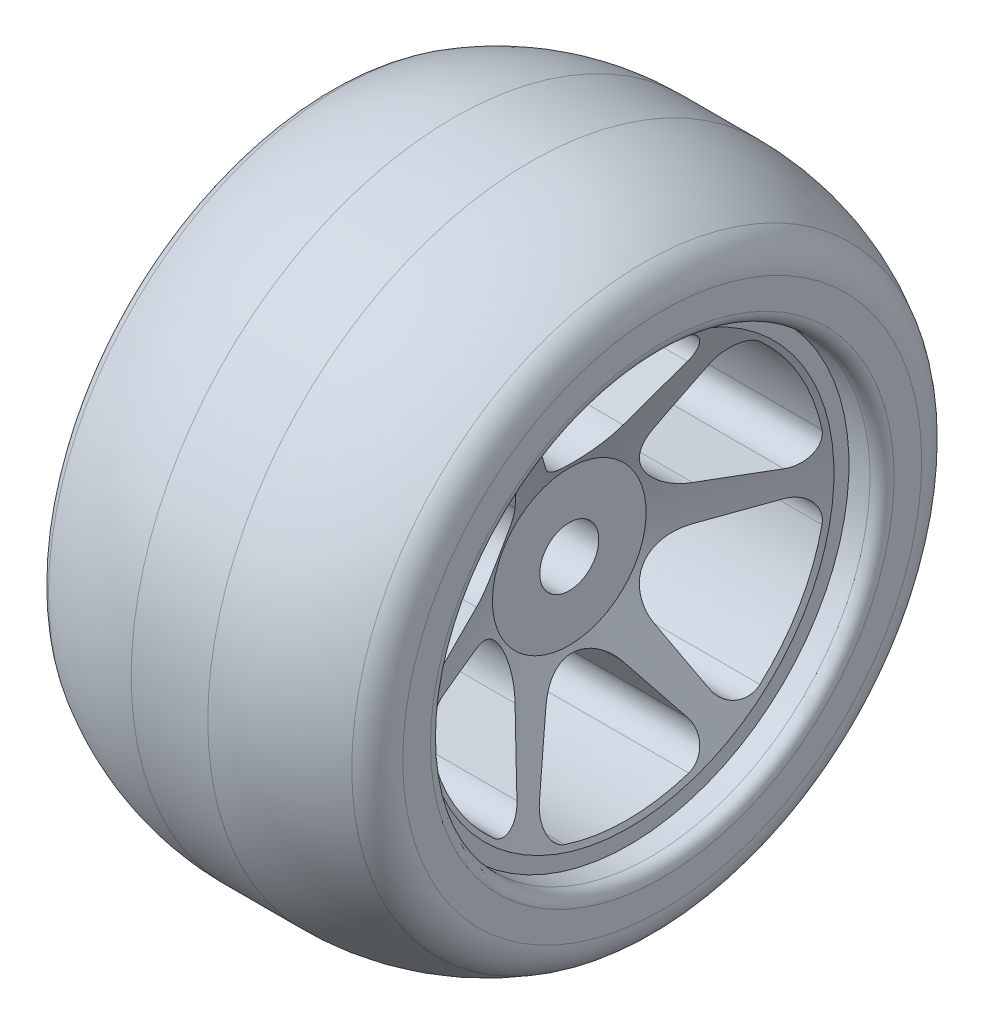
ISO-10303-21;
HEADER;
FILE_DESCRIPTION(('STEP AP214'),'2;1');
FILE_NAME('part.step','',(''),(''),'','','');
FILE_SCHEMA(('AUTOMOTIVE_DESIGN { 1 0 10303 214 1 1 1 1 }'));
ENDSEC;
DATA;
#1=APPLICATION_CONTEXT('core data for automotive mechanical design processes');
#2=APPLICATION_PROTOCOL_DEFINITION('international standard','automotive_design',2000,#1);
#3=PRODUCT_CONTEXT('',#1,'mechanical');
#4=PRODUCT('Part','Part','',(#3));
#5=PRODUCT_RELATED_PRODUCT_CATEGORY('part','',(#4));
#6=PRODUCT_DEFINITION_FORMATION('','',#4);
#7=PRODUCT_DEFINITION_CONTEXT('part definition',#1,'design');
#8=PRODUCT_DEFINITION('design','',#6,#7);
#9=PRODUCT_DEFINITION_SHAPE('','',#8);
#10=(LENGTH_UNIT() NAMED_UNIT(*) SI_UNIT(.MILLI.,.METRE.));
#11=(NAMED_UNIT(*) PLANE_ANGLE_UNIT() SI_UNIT($,.RADIAN.));
#12=(NAMED_UNIT(*) SI_UNIT($,.STERADIAN.) SOLID_ANGLE_UNIT());
#13=UNCERTAINTY_MEASURE_WITH_UNIT(LENGTH_MEASURE(1.E-05),#10,'distance_accuracy_value','');
#14=(GEOMETRIC_REPRESENTATION_CONTEXT(3) GLOBAL_UNCERTAINTY_ASSIGNED_CONTEXT((#13)) GLOBAL_UNIT_ASSIGNED_CONTEXT((#10,
#11,#12)) REPRESENTATION_CONTEXT('',''));
#15=CARTESIAN_POINT('',(0.,0.,0.));
#16=DIRECTION('',(0.,0.,1.));
#17=DIRECTION('',(1.,0.,0.));
#18=AXIS2_PLACEMENT_3D('',#15,#16,#17);
#19=CARTESIAN_POINT('',(49.276,-37.211,2.59843024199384E-13));
#20=DIRECTION('',(-1.,0.,0.));
#21=DIRECTION('',(0.,0.,1.));
#22=AXIS2_PLACEMENT_3D('',#19,#20,#21);
#23=PLANE('',#22);
#24=CARTESIAN_POINT('',(49.276,0.,0.));
#25=DIRECTION('',(-1.,0.,0.));
#26=DIRECTION('',(0.,0.,1.));
#27=AXIS2_PLACEMENT_3D('',#24,#25,#26);
#28=CIRCLE('',#27,39.243);
#29=CARTESIAN_POINT('',(49.276,0.,39.243));
#30=VERTEX_POINT('',#29);
#31=EDGE_CURVE('E58',#30,#30,#28,.T.);
#32=ORIENTED_EDGE('',*,*,#31,.T.);
#33=EDGE_LOOP('',(#32));
#34=FACE_BOUND('',#33,.T.);
#35=CARTESIAN_POINT('',(49.276,0.,0.));
#36=DIRECTION('',(-1.,0.,0.));
#37=DIRECTION('',(0.,0.,1.));
#38=AXIS2_PLACEMENT_3D('',#35,#36,#37);
#39=CIRCLE('',#38,43.9378534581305);
#40=CARTESIAN_POINT('',(49.276,0.,43.9378534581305));
#41=VERTEX_POINT('',#40);
#42=EDGE_CURVE('E63',#41,#41,#39,.F.);
#43=ORIENTED_EDGE('',*,*,#42,.T.);
#44=EDGE_LOOP('',(#43));
#45=FACE_BOUND('',#44,.T.);
#46=ADVANCED_FACE('F43',(#34,#45),#23,.F.);
#47=CARTESIAN_POINT('',(26.9330217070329,0.,0.));
#48=DIRECTION('',(-1.,0.,0.));
#49=DIRECTION('',(0.,0.,1.));
#50=AXIS2_PLACEMENT_3D('',#47,#48,#49);
#51=DEGENERATE_TOROIDAL_SURFACE('',#50,16.51,38.1,.T.);
#52=CARTESIAN_POINT('',(46.1245956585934,0.,0.));
#53=DIRECTION('',(-1.,0.,0.));
#54=DIRECTION('',(0.,0.,1.));
#55=AXIS2_PLACEMENT_3D('',#52,#53,#54);
#56=CIRCLE('',#55,49.4234241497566);
#57=CARTESIAN_POINT('',(46.1245956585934,0.,49.4234241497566));
#58=VERTEX_POINT('',#57);
#59=EDGE_CURVE('E66',#58,#58,#56,.T.);
#60=ORIENTED_EDGE('',*,*,#59,.T.);
#61=EDGE_LOOP('',(#60));
#62=FACE_BOUND('',#61,.T.);
#63=CARTESIAN_POINT('',(26.9330217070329,0.,0.));
#64=DIRECTION('',(-1.,0.,0.));
#65=DIRECTION('',(0.,0.,1.));
#66=AXIS2_PLACEMENT_3D('',#63,#64,#65);
#67=CIRCLE('',#66,54.61);
#68=CARTESIAN_POINT('',(26.9330217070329,0.,54.61));
#69=VERTEX_POINT('',#68);
#70=EDGE_CURVE('E75',#69,#69,#67,.T.);
#71=ORIENTED_EDGE('',*,*,#70,.F.);
#72=EDGE_LOOP('',(#71));
#73=FACE_BOUND('',#72,.T.);
#74=ADVANCED_FACE('F87',(#62,#73),#51,.T.);
#75=CARTESIAN_POINT('',(0.,0.,0.));
#76=DIRECTION('',(-1.,0.,0.));
#77=DIRECTION('',(0.,0.,1.));
#78=AXIS2_PLACEMENT_3D('',#75,#76,#77);
#79=CYLINDRICAL_SURFACE('',#78,54.61);
#80=CARTESIAN_POINT('',(13.9609782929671,0.,0.));
#81=DIRECTION('',(-1.,0.,0.));
#82=DIRECTION('',(0.,0.,1.));
#83=AXIS2_PLACEMENT_3D('',#80,#81,#82);
#84=CIRCLE('',#83,54.61);
#85=CARTESIAN_POINT('',(13.9609782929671,0.,54.61));
#86=VERTEX_POINT('',#85);
#87=EDGE_CURVE('E78',#86,#86,#84,.T.);
#88=ORIENTED_EDGE('',*,*,#87,.F.);
#89=EDGE_LOOP('',(#88));
#90=FACE_BOUND('',#89,.T.);
#91=ORIENTED_EDGE('',*,*,#70,.T.);
#92=EDGE_LOOP('',(#91));
#93=FACE_BOUND('',#92,.T.);
#94=ADVANCED_FACE('F84',(#90,#93),#79,.T.);
#95=CARTESIAN_POINT('',(13.9609782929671,0.,0.));
#96=DIRECTION('',(-1.,0.,0.));
#97=DIRECTION('',(0.,0.,1.));
#98=AXIS2_PLACEMENT_3D('',#95,#96,#97);
#99=DEGENERATE_TOROIDAL_SURFACE('',#98,16.51,38.1,.T.);
#100=CARTESIAN_POINT('',(-5.23059565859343,0.,0.));
#101=DIRECTION('',(1.,0.,0.));
#102=DIRECTION('',(0.,0.,-1.));
#103=AXIS2_PLACEMENT_3D('',#100,#101,#102);
#104=CIRCLE('',#103,49.4234241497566);
#105=CARTESIAN_POINT('',(-5.23059565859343,0.,-49.4234241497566));
#106=VERTEX_POINT('',#105);
#107=EDGE_CURVE('E69',#106,#106,#104,.T.);
#108=ORIENTED_EDGE('',*,*,#107,.T.);
#109=EDGE_LOOP('',(#108));
#110=FACE_BOUND('',#109,.T.);
#111=ORIENTED_EDGE('',*,*,#87,.T.);
#112=EDGE_LOOP('',(#111));
#113=FACE_BOUND('',#112,.T.);
#114=ADVANCED_FACE('F82',(#110,#113),#99,.T.);
#115=CARTESIAN_POINT('',(-8.382,-37.211,2.59843024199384E-13));
#116=DIRECTION('',(1.,0.,0.));
#117=DIRECTION('',(0.,0.,-1.));
#118=AXIS2_PLACEMENT_3D('',#115,#116,#117);
#119=PLANE('',#118);
#120=CARTESIAN_POINT('',(-8.382,0.,0.));
#121=DIRECTION('',(1.,0.,0.));
#122=DIRECTION('',(0.,0.,-1.));
#123=AXIS2_PLACEMENT_3D('',#120,#121,#122);
#124=CIRCLE('',#123,39.243);
#125=CARTESIAN_POINT('',(-8.382,0.,-39.243));
#126=VERTEX_POINT('',#125);
#127=EDGE_CURVE('E11',#126,#126,#124,.T.);
#128=ORIENTED_EDGE('',*,*,#127,.T.);
#129=EDGE_LOOP('',(#128));
#130=FACE_BOUND('',#129,.T.);
#131=CARTESIAN_POINT('',(-8.382,0.,0.));
#132=DIRECTION('',(1.,0.,0.));
#133=DIRECTION('',(0.,0.,-1.));
#134=AXIS2_PLACEMENT_3D('',#131,#132,#133);
#135=CIRCLE('',#134,43.9378534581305);
#136=CARTESIAN_POINT('',(-8.382,0.,-43.9378534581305));
#137=VERTEX_POINT('',#136);
#138=EDGE_CURVE('E72',#137,#137,#135,.F.);
#139=ORIENTED_EDGE('',*,*,#138,.T.);
#140=EDGE_LOOP('',(#139));
#141=FACE_BOUND('',#140,.T.);
#142=ADVANCED_FACE('F128',(#130,#141),#119,.F.);
#143=CARTESIAN_POINT('',(0.,0.,0.));
#144=DIRECTION('',(-1.,0.,0.));
#145=DIRECTION('',(0.,0.,1.));
#146=AXIS2_PLACEMENT_3D('',#143,#144,#145);
#147=CYLINDRICAL_SURFACE('',#146,37.211);
#148=CARTESIAN_POINT('',(47.244,0.,0.));
#149=DIRECTION('',(-1.,0.,0.));
#150=DIRECTION('',(0.,0.,1.));
#151=AXIS2_PLACEMENT_3D('',#148,#149,#150);
#152=CIRCLE('',#151,37.211);
#153=CARTESIAN_POINT('',(47.244,0.,37.211));
#154=VERTEX_POINT('',#153);
#155=EDGE_CURVE('E50',#154,#154,#152,.F.);
#156=ORIENTED_EDGE('',*,*,#155,.T.);
#157=EDGE_LOOP('',(#156));
#158=FACE_BOUND('',#157,.T.);
#159=CARTESIAN_POINT('',(-6.35,0.,0.));
#160=DIRECTION('',(1.,0.,0.));
#161=DIRECTION('',(0.,0.,-1.));
#162=AXIS2_PLACEMENT_3D('',#159,#160,#161);
#163=CIRCLE('',#162,37.211);
#164=CARTESIAN_POINT('',(-6.35,0.,-37.211));
#165=VERTEX_POINT('',#164);
#166=EDGE_CURVE('E54',#165,#165,#163,.F.);
#167=ORIENTED_EDGE('',*,*,#166,.T.);
#168=EDGE_LOOP('',(#167));
#169=FACE_BOUND('',#168,.T.);
#170=ADVANCED_FACE('F105',(#158,#169),#147,.F.);
#171=CARTESIAN_POINT('',(-2.032,0.,0.));
#172=DIRECTION('',(1.,0.,0.));
#173=DIRECTION('',(0.,0.,-1.));
#174=AXIS2_PLACEMENT_3D('',#171,#172,#173);
#175=TOROIDAL_SURFACE('',#174,43.9378534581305,6.35);
#176=ORIENTED_EDGE('',*,*,#107,.F.);
#177=EDGE_LOOP('',(#176));
#178=FACE_BOUND('',#177,.T.);
#179=ORIENTED_EDGE('',*,*,#138,.F.);
#180=EDGE_LOOP('',(#179));
#181=FACE_BOUND('',#180,.T.);
#182=ADVANCED_FACE('F101',(#178,#181),#175,.T.);
#183=CARTESIAN_POINT('',(42.926,0.,0.));
#184=DIRECTION('',(-1.,0.,0.));
#185=DIRECTION('',(0.,0.,1.));
#186=AXIS2_PLACEMENT_3D('',#183,#184,#185);
#187=TOROIDAL_SURFACE('',#186,43.9378534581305,6.35);
#188=ORIENTED_EDGE('',*,*,#42,.F.);
#189=EDGE_LOOP('',(#188));
#190=FACE_BOUND('',#189,.T.);
#191=ORIENTED_EDGE('',*,*,#59,.F.);
#192=EDGE_LOOP('',(#191));
#193=FACE_BOUND('',#192,.T.);
#194=ADVANCED_FACE('F104',(#190,#193),#187,.T.);
#195=CARTESIAN_POINT('',(47.244,0.,0.));
#196=DIRECTION('',(-1.,0.,0.));
#197=DIRECTION('',(0.,0.,1.));
#198=AXIS2_PLACEMENT_3D('',#195,#196,#197);
#199=TOROIDAL_SURFACE('',#198,39.243,2.032);
#200=ORIENTED_EDGE('',*,*,#155,.F.);
#201=EDGE_LOOP('',(#200));
#202=FACE_BOUND('',#201,.T.);
#203=ORIENTED_EDGE('',*,*,#31,.F.);
#204=EDGE_LOOP('',(#203));
#205=FACE_BOUND('',#204,.T.);
#206=ADVANCED_FACE('F108',(#202,#205),#199,.T.);
#207=CARTESIAN_POINT('',(-6.35,0.,0.));
#208=DIRECTION('',(1.,0.,0.));
#209=DIRECTION('',(0.,0.,-1.));
#210=AXIS2_PLACEMENT_3D('',#207,#208,#209);
#211=TOROIDAL_SURFACE('',#210,39.243,2.032);
#212=ORIENTED_EDGE('',*,*,#127,.F.);
#213=EDGE_LOOP('',(#212));
#214=FACE_BOUND('',#213,.T.);
#215=ORIENTED_EDGE('',*,*,#166,.F.);
#216=EDGE_LOOP('',(#215));
#217=FACE_BOUND('',#216,.T.);
#218=ADVANCED_FACE('F45',(#214,#217),#211,.T.);
#219=CLOSED_SHELL('',(#46,#74,#94,#114,#142,#170,#182,#194,#206,#218));
#220=MANIFOLD_SOLID_BREP('B2',#219);
#221=CARTESIAN_POINT('',(0.,-37.211,2.59843024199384E-13));
#222=DIRECTION('',(1.,0.,0.));
#223=DIRECTION('',(0.,0.,-1.));
#224=AXIS2_PLACEMENT_3D('',#221,#222,#223);
#225=PLANE('',#224);
#226=CARTESIAN_POINT('',(0.,-22.1998168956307,19.9092107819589));
#227=DIRECTION('',(1.,0.,0.));
#228=DIRECTION('',(0.,0.,-1.));
#229=AXIS2_PLACEMENT_3D('',#226,#227,#228);
#230=CIRCLE('',#229,3.9624);
#231=CARTESIAN_POINT('',(0.,-23.9064547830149,16.3331793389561));
#232=VERTEX_POINT('',#231);
#233=CARTESIAN_POINT('',(0.,-25.1497073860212,22.5547277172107));
#234=VERTEX_POINT('',#233);
#235=EDGE_CURVE('E491',#232,#234,#230,.F.);
#236=ORIENTED_EDGE('',*,*,#235,.F.);
#237=DIRECTION('',(0.,-0.902491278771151,0.430708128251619));
#238=VECTOR('',#237,1.);
#239=CARTESIAN_POINT('',(0.,-28.3940050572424,18.4748336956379));
#240=LINE('',#239,#238);
#241=CARTESIAN_POINT('',(0.,-14.3352757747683,11.7653960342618));
#242=VERTEX_POINT('',#241);
#243=EDGE_CURVE('E489',#242,#232,#240,.T.);
#244=ORIENTED_EDGE('',*,*,#243,.F.);
#245=CARTESIAN_POINT('',(0.,-10.9219999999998,18.9174589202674));
#246=DIRECTION('',(1.,0.,0.));
#247=DIRECTION('',(0.,0.,-1.));
#248=AXIS2_PLACEMENT_3D('',#245,#246,#247);
#249=CIRCLE('',#248,7.9248);
#250=CARTESIAN_POINT('',(0.,-3.02149396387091,18.2974110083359));
#251=VERTEX_POINT('',#250);
#252=EDGE_CURVE('E487',#251,#242,#249,.F.);
#253=ORIENTED_EDGE('',*,*,#252,.F.);
#254=DIRECTION('',(0.,-0.0782414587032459,-0.996934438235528));
#255=VECTOR('',#254,1.);
#256=CARTESIAN_POINT('',(0.,-4.65802016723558,-2.55482459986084));
#257=LINE('',#256,#255);
#258=CARTESIAN_POINT('',(0.,-2.19172084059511,28.870186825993));
#259=VERTEX_POINT('',#258);
#260=EDGE_CURVE('E485',#259,#251,#257,.T.);
#261=ORIENTED_EDGE('',*,*,#260,.F.);
#262=CARTESIAN_POINT('',(0.,-6.14197385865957,29.1802107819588));
#263=DIRECTION('',(1.,0.,0.));
#264=DIRECTION('',(0.,0.,-1.));
#265=AXIS2_PLACEMENT_3D('',#262,#263,#264);
#266=CIRCLE('',#265,3.9624);
#267=CARTESIAN_POINT('',(0.,-6.95811348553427,33.0576493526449));
#268=VERTEX_POINT('',#267);
#269=EDGE_CURVE('E483',#268,#259,#266,.F.);
#270=ORIENTED_EDGE('',*,*,#269,.F.);
#271=CARTESIAN_POINT('',(0.,0.,0.));
#272=DIRECTION('',(1.,0.,0.));
#273=DIRECTION('',(0.,0.,-1.));
#274=AXIS2_PLACEMENT_3D('',#271,#272,#273);
#275=CIRCLE('',#274,33.782);
#276=EDGE_CURVE('E481',#234,#268,#275,.F.);
#277=ORIENTED_EDGE('',*,*,#276,.F.);
#278=EDGE_LOOP('',(#236,#244,#253,#261,#270,#277));
#279=FACE_BOUND('',#278,.T.);
#280=CARTESIAN_POINT('',(0.,-6.14197385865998,-29.1802107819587));
#281=DIRECTION('',(1.,0.,0.));
#282=DIRECTION('',(0.,0.,-1.));
#283=AXIS2_PLACEMENT_3D('',#280,#281,#282);
#284=CIRCLE('',#283,3.9624);
#285=CARTESIAN_POINT('',(0.,-2.19172084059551,-28.870186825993));
#286=VERTEX_POINT('',#285);
#287=CARTESIAN_POINT('',(0.,-6.95811348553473,-33.0576493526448));
#288=VERTEX_POINT('',#287);
#289=EDGE_CURVE('E551',#286,#288,#284,.F.);
#290=ORIENTED_EDGE('',*,*,#289,.F.);
#291=DIRECTION('',(0.,0.0782414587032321,-0.996934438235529));
#292=VECTOR('',#291,1.);
#293=CARTESIAN_POINT('',(0.,-4.65802016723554,2.55482459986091));
#294=LINE('',#293,#292);
#295=CARTESIAN_POINT('',(0.,-3.02149396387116,-18.2974110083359));
#296=VERTEX_POINT('',#295);
#297=EDGE_CURVE('E549',#296,#286,#294,.T.);
#298=ORIENTED_EDGE('',*,*,#297,.F.);
#299=CARTESIAN_POINT('',(0.,-10.9220000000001,-18.9174589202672));
#300=DIRECTION('',(1.,0.,0.));
#301=DIRECTION('',(0.,0.,-1.));
#302=AXIS2_PLACEMENT_3D('',#299,#300,#301);
#303=CIRCLE('',#302,7.9248);
#304=CARTESIAN_POINT('',(0.,-14.3352757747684,-11.7653960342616));
#305=VERTEX_POINT('',#304);
#306=EDGE_CURVE('E547',#305,#296,#303,.F.);
#307=ORIENTED_EDGE('',*,*,#306,.F.);
#308=DIRECTION('',(0.,0.902491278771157,0.430708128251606));
#309=VECTOR('',#308,1.);
#310=CARTESIAN_POINT('',(0.,-28.3940050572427,-18.4748336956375));
#311=LINE('',#310,#309);
#312=CARTESIAN_POINT('',(0.,-23.9064547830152,-16.3331793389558));
#313=VERTEX_POINT('',#312);
#314=EDGE_CURVE('E545',#313,#305,#311,.T.);
#315=ORIENTED_EDGE('',*,*,#314,.F.);
#316=CARTESIAN_POINT('',(0.,-22.199816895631,-19.9092107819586));
#317=DIRECTION('',(1.,0.,0.));
#318=DIRECTION('',(0.,0.,-1.));
#319=AXIS2_PLACEMENT_3D('',#316,#317,#318);
#320=CIRCLE('',#319,3.9624);
#321=CARTESIAN_POINT('',(0.,-25.1497073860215,-22.5547277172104));
#322=VERTEX_POINT('',#321);
#323=EDGE_CURVE('E543',#322,#313,#320,.F.);
#324=ORIENTED_EDGE('',*,*,#323,.F.);
#325=CARTESIAN_POINT('',(0.,0.,0.));
#326=DIRECTION('',(1.,0.,0.));
#327=DIRECTION('',(0.,0.,-1.));
#328=AXIS2_PLACEMENT_3D('',#325,#326,#327);
#329=CIRCLE('',#328,33.782);
#330=EDGE_CURVE('E541',#288,#322,#329,.F.);
#331=ORIENTED_EDGE('',*,*,#330,.F.);
#332=EDGE_LOOP('',(#290,#298,#307,#315,#324,#331));
#333=FACE_BOUND('',#332,.T.);
#334=CARTESIAN_POINT('',(0.,28.3417907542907,9.271));
#335=DIRECTION('',(1.,0.,0.));
#336=DIRECTION('',(0.,0.,-1.));
#337=AXIS2_PLACEMENT_3D('',#334,#335,#336);
#338=CIRCLE('',#337,3.9624);
#339=CARTESIAN_POINT('',(0.,26.0981756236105,12.5370074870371));
#340=VERTEX_POINT('',#339);
#341=CARTESIAN_POINT('',(0.,32.1078208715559,10.5029216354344));
#342=VERTEX_POINT('',#341);
#343=EDGE_CURVE('E611',#340,#342,#338,.F.);
#344=ORIENTED_EDGE('',*,*,#343,.F.);
#345=DIRECTION('',(0.,0.824249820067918,0.566226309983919));
#346=VECTOR('',#345,1.);
#347=CARTESIAN_POINT('',(0.,-22.7644747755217,-21.0296582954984));
#348=LINE('',#347,#346);
#349=CARTESIAN_POINT('',(0.,17.3567697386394,6.53201497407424));
#350=VERTEX_POINT('',#349);
#351=EDGE_CURVE('E609',#350,#340,#348,.T.);
#352=ORIENTED_EDGE('',*,*,#351,.F.);
#353=CARTESIAN_POINT('',(0.,21.844,0.));
#354=DIRECTION('',(1.,0.,0.));
#355=DIRECTION('',(0.,0.,-1.));
#356=AXIS2_PLACEMENT_3D('',#353,#354,#355);
#357=CIRCLE('',#356,7.9248);
#358=CARTESIAN_POINT('',(0.,17.3567697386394,-6.53201497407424));
#359=VERTEX_POINT('',#358);
#360=EDGE_CURVE('E607',#359,#350,#357,.F.);
#361=ORIENTED_EDGE('',*,*,#360,.F.);
#362=DIRECTION('',(0.,-0.824249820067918,0.566226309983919));
#363=VECTOR('',#362,1.);
#364=CARTESIAN_POINT('',(0.,-22.7644747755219,21.0296582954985));
#365=LINE('',#364,#363);
#366=CARTESIAN_POINT('',(0.,26.0981756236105,-12.5370074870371));
#367=VERTEX_POINT('',#366);
#368=EDGE_CURVE('E605',#367,#359,#365,.T.);
#369=ORIENTED_EDGE('',*,*,#368,.F.);
#370=CARTESIAN_POINT('',(0.,28.3417907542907,-9.271));
#371=DIRECTION('',(1.,0.,0.));
#372=DIRECTION('',(0.,0.,-1.));
#373=AXIS2_PLACEMENT_3D('',#370,#371,#372);
#374=CIRCLE('',#373,3.9624);
#375=CARTESIAN_POINT('',(0.,32.1078208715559,-10.5029216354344));
#376=VERTEX_POINT('',#375);
#377=EDGE_CURVE('E603',#376,#367,#374,.F.);
#378=ORIENTED_EDGE('',*,*,#377,.F.);
#379=CARTESIAN_POINT('',(0.,0.,0.));
#380=DIRECTION('',(1.,0.,0.));
#381=DIRECTION('',(0.,0.,-1.));
#382=AXIS2_PLACEMENT_3D('',#379,#380,#381);
#383=CIRCLE('',#382,33.782);
#384=EDGE_CURVE('E601',#342,#376,#383,.F.);
#385=ORIENTED_EDGE('',*,*,#384,.F.);
#386=EDGE_LOOP('',(#344,#352,#361,#369,#378,#385));
#387=FACE_BOUND('',#386,.T.);
#388=CARTESIAN_POINT('',(0.,0.,0.));
#389=DIRECTION('',(-1.,0.,0.));
#390=DIRECTION('',(0.,0.,1.));
#391=AXIS2_PLACEMENT_3D('',#388,#389,#390);
#392=CIRCLE('',#391,5.);
#393=CARTESIAN_POINT('',(0.,0.,5.));
#394=VERTEX_POINT('',#393);
#395=EDGE_CURVE('E629',#394,#394,#392,.T.);
#396=ORIENTED_EDGE('',*,*,#395,.F.);
#397=EDGE_LOOP('',(#396));
#398=FACE_BOUND('',#397,.T.);
#399=CARTESIAN_POINT('',(0.,0.,0.));
#400=DIRECTION('',(-1.,0.,0.));
#401=DIRECTION('',(0.,0.,1.));
#402=AXIS2_PLACEMENT_3D('',#399,#400,#401);
#403=CIRCLE('',#402,37.211);
#404=CARTESIAN_POINT('',(0.,0.,37.211));
#405=VERTEX_POINT('',#404);
#406=EDGE_CURVE('E614',#405,#405,#403,.T.);
#407=ORIENTED_EDGE('',*,*,#406,.T.);
#408=EDGE_LOOP('',(#407));
#409=FACE_BOUND('',#408,.T.);
#410=CARTESIAN_POINT('',(0.,22.1998168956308,-19.9092107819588));
#411=DIRECTION('',(1.,0.,0.));
#412=DIRECTION('',(0.,0.,-1.));
#413=AXIS2_PLACEMENT_3D('',#410,#411,#412);
#414=CIRCLE('',#413,3.9624);
#415=CARTESIAN_POINT('',(0.,23.906454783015,-16.3331793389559));
#416=VERTEX_POINT('',#415);
#417=CARTESIAN_POINT('',(0.,25.1497073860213,-22.5547277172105));
#418=VERTEX_POINT('',#417);
#419=EDGE_CURVE('E581',#416,#418,#414,.F.);
#420=ORIENTED_EDGE('',*,*,#419,.F.);
#421=DIRECTION('',(0.,0.902491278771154,-0.430708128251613));
#422=VECTOR('',#421,1.);
#423=CARTESIAN_POINT('',(0.,-32.2220075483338,10.4537664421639));
#424=LINE('',#423,#422);
#425=CARTESIAN_POINT('',(0.,14.3352757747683,-11.7653960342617));
#426=VERTEX_POINT('',#425);
#427=EDGE_CURVE('E579',#426,#416,#424,.T.);
#428=ORIENTED_EDGE('',*,*,#427,.F.);
#429=CARTESIAN_POINT('',(0.,10.922,-18.9174589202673));
#430=DIRECTION('',(1.,0.,0.));
#431=DIRECTION('',(0.,0.,-1.));
#432=AXIS2_PLACEMENT_3D('',#429,#430,#431);
#433=CIRCLE('',#432,7.9248);
#434=CARTESIAN_POINT('',(0.,3.02149396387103,-18.2974110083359));
#435=VERTEX_POINT('',#434);
#436=EDGE_CURVE('E577',#435,#426,#433,.F.);
#437=ORIENTED_EDGE('',*,*,#436,.F.);
#438=DIRECTION('',(0.,0.078241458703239,0.996934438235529));
#439=VECTOR('',#438,1.);
#440=CARTESIAN_POINT('',(0.,4.20242908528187,-3.25021082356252));
#441=LINE('',#440,#439);
#442=CARTESIAN_POINT('',(0.,2.19172084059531,-28.870186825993));
#443=VERTEX_POINT('',#442);
#444=EDGE_CURVE('E575',#443,#435,#441,.T.);
#445=ORIENTED_EDGE('',*,*,#444,.F.);
#446=CARTESIAN_POINT('',(0.,6.14197385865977,-29.1802107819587));
#447=DIRECTION('',(1.,0.,0.));
#448=DIRECTION('',(0.,0.,-1.));
#449=AXIS2_PLACEMENT_3D('',#446,#447,#448);
#450=CIRCLE('',#449,3.9624);
#451=CARTESIAN_POINT('',(0.,6.9581134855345,-33.0576493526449));
#452=VERTEX_POINT('',#451);
#453=EDGE_CURVE('E573',#452,#443,#450,.F.);
#454=ORIENTED_EDGE('',*,*,#453,.F.);
#455=CARTESIAN_POINT('',(0.,0.,0.));
#456=DIRECTION('',(1.,0.,0.));
#457=DIRECTION('',(0.,0.,-1.));
#458=AXIS2_PLACEMENT_3D('',#455,#456,#457);
#459=CIRCLE('',#458,33.782);
#460=EDGE_CURVE('E571',#418,#452,#459,.F.);
#461=ORIENTED_EDGE('',*,*,#460,.F.);
#462=EDGE_LOOP('',(#420,#428,#437,#445,#454,#461));
#463=FACE_BOUND('',#462,.T.);
#464=CARTESIAN_POINT('',(0.,-28.3417907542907,-9.271));
#465=DIRECTION('',(1.,0.,0.));
#466=DIRECTION('',(0.,0.,-1.));
#467=AXIS2_PLACEMENT_3D('',#464,#465,#466);
#468=CIRCLE('',#467,3.9624);
#469=CARTESIAN_POINT('',(0.,-26.0981756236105,-12.5370074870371));
#470=VERTEX_POINT('',#469);
#471=CARTESIAN_POINT('',(0.,-32.1078208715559,-10.5029216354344));
#472=VERTEX_POINT('',#471);
#473=EDGE_CURVE('E521',#470,#472,#468,.F.);
#474=ORIENTED_EDGE('',*,*,#473,.F.);
#475=DIRECTION('',(0.,-0.824249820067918,-0.566226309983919));
#476=VECTOR('',#475,1.);
#477=CARTESIAN_POINT('',(0.,-27.7969215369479,-13.7039772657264));
#478=LINE('',#477,#476);
#479=CARTESIAN_POINT('',(0.,-17.3567697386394,-6.53201497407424));
#480=VERTEX_POINT('',#479);
#481=EDGE_CURVE('E519',#480,#470,#478,.T.);
#482=ORIENTED_EDGE('',*,*,#481,.F.);
#483=CARTESIAN_POINT('',(0.,-21.844,0.));
#484=DIRECTION('',(1.,0.,0.));
#485=DIRECTION('',(0.,0.,-1.));
#486=AXIS2_PLACEMENT_3D('',#483,#484,#485);
#487=CIRCLE('',#486,7.9248);
#488=CARTESIAN_POINT('',(0.,-17.3567697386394,6.53201497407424));
#489=VERTEX_POINT('',#488);
#490=EDGE_CURVE('E517',#489,#480,#487,.F.);
#491=ORIENTED_EDGE('',*,*,#490,.F.);
#492=DIRECTION('',(0.,0.824249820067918,-0.566226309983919));
#493=VECTOR('',#492,1.);
#494=CARTESIAN_POINT('',(0.,-27.7969215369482,13.7039772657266));
#495=LINE('',#494,#493);
#496=CARTESIAN_POINT('',(0.,-26.0981756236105,12.5370074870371));
#497=VERTEX_POINT('',#496);
#498=EDGE_CURVE('E515',#497,#489,#495,.T.);
#499=ORIENTED_EDGE('',*,*,#498,.F.);
#500=CARTESIAN_POINT('',(0.,-28.3417907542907,9.271));
#501=DIRECTION('',(1.,0.,0.));
#502=DIRECTION('',(0.,0.,-1.));
#503=AXIS2_PLACEMENT_3D('',#500,#501,#502);
#504=CIRCLE('',#503,3.9624);
#505=CARTESIAN_POINT('',(0.,-32.1078208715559,10.5029216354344));
#506=VERTEX_POINT('',#505);
#507=EDGE_CURVE('E513',#506,#497,#504,.F.);
#508=ORIENTED_EDGE('',*,*,#507,.F.);
#509=CARTESIAN_POINT('',(0.,0.,0.));
#510=DIRECTION('',(1.,0.,0.));
#511=DIRECTION('',(0.,0.,-1.));
#512=AXIS2_PLACEMENT_3D('',#509,#510,#511);
#513=CIRCLE('',#512,33.782);
#514=EDGE_CURVE('E511',#472,#506,#513,.F.);
#515=ORIENTED_EDGE('',*,*,#514,.F.);
#516=EDGE_LOOP('',(#474,#482,#491,#499,#508,#515));
#517=FACE_BOUND('',#516,.T.);
#518=CARTESIAN_POINT('',(0.,6.14197385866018,29.1802107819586));
#519=DIRECTION('',(1.,0.,0.));
#520=DIRECTION('',(0.,0.,-1.));
#521=AXIS2_PLACEMENT_3D('',#518,#519,#520);
#522=CIRCLE('',#521,3.9624);
#523=CARTESIAN_POINT('',(0.,2.19172084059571,28.870186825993));
#524=VERTEX_POINT('',#523);
#525=CARTESIAN_POINT('',(0.,6.95811348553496,33.0576493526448));
#526=VERTEX_POINT('',#525);
#527=EDGE_CURVE('E462',#524,#526,#522,.F.);
#528=ORIENTED_EDGE('',*,*,#527,.F.);
#529=DIRECTION('',(0.,-0.078241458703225,0.99693443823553));
#530=VECTOR('',#529,1.);
#531=CARTESIAN_POINT('',(0.,4.20242908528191,3.25021082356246));
#532=LINE('',#531,#530);
#533=CARTESIAN_POINT('',(0.,3.02149396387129,18.2974110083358));
#534=VERTEX_POINT('',#533);
#535=EDGE_CURVE('E460',#534,#524,#532,.T.);
#536=ORIENTED_EDGE('',*,*,#535,.F.);
#537=CARTESIAN_POINT('',(0.,10.9220000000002,18.9174589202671));
#538=DIRECTION('',(1.,0.,0.));
#539=DIRECTION('',(0.,0.,-1.));
#540=AXIS2_PLACEMENT_3D('',#537,#538,#539);
#541=CIRCLE('',#540,7.9248);
#542=CARTESIAN_POINT('',(0.,14.3352757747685,11.7653960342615));
#543=VERTEX_POINT('',#542);
#544=EDGE_CURVE('E455',#543,#534,#541,.F.);
#545=ORIENTED_EDGE('',*,*,#544,.F.);
#546=DIRECTION('',(0.,-0.90249127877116,-0.4307081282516));
#547=VECTOR('',#546,1.);
#548=CARTESIAN_POINT('',(0.,-32.222007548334,-10.4537664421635));
#549=LINE('',#548,#547);
#550=CARTESIAN_POINT('',(0.,23.9064547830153,16.3331793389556));
#551=VERTEX_POINT('',#550);
#552=EDGE_CURVE('E453',#551,#543,#549,.T.);
#553=ORIENTED_EDGE('',*,*,#552,.F.);
#554=CARTESIAN_POINT('',(0.,22.1998168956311,19.9092107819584));
#555=DIRECTION('',(1.,0.,0.));
#556=DIRECTION('',(0.,0.,-1.));
#557=AXIS2_PLACEMENT_3D('',#554,#555,#556);
#558=CIRCLE('',#557,3.9624);
#559=CARTESIAN_POINT('',(0.,25.1497073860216,22.5547277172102));
#560=VERTEX_POINT('',#559);
#561=EDGE_CURVE('E439',#560,#551,#558,.F.);
#562=ORIENTED_EDGE('',*,*,#561,.F.);
#563=CARTESIAN_POINT('',(0.,0.,0.));
#564=DIRECTION('',(1.,0.,0.));
#565=DIRECTION('',(0.,0.,-1.));
#566=AXIS2_PLACEMENT_3D('',#563,#564,#565);
#567=CIRCLE('',#566,33.782);
#568=EDGE_CURVE('E434',#526,#560,#567,.F.);
#569=ORIENTED_EDGE('',*,*,#568,.F.);
#570=EDGE_LOOP('',(#528,#536,#545,#553,#562,#569));
#571=FACE_BOUND('',#570,.T.);
#572=ADVANCED_FACE('F201',(#279,#333,#387,#398,#409,#463,#517,#571),#225,.F.);
#573=CARTESIAN_POINT('',(33.528,0.,0.));
#574=DIRECTION('',(1.,0.,0.));
#575=DIRECTION('',(0.,0.,-1.));
#576=AXIS2_PLACEMENT_3D('',#573,#574,#575);
#577=CONICAL_SURFACE('',#576,13.0175,1.13208416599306);
#578=CARTESIAN_POINT('',(43.2708738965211,-25.1495280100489,22.5549277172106));
#579=CARTESIAN_POINT('',(43.2708821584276,-25.2197589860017,22.4766507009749));
#580=CARTESIAN_POINT('',(43.2691460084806,-25.2868472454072,22.3955611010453));
#581=CARTESIAN_POINT('',(43.2622240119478,-25.4142981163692,22.2284204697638));
#582=CARTESIAN_POINT('',(43.2570388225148,-25.4746620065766,22.1423703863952));
#583=CARTESIAN_POINT('',(43.2432759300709,-25.5881019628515,21.9661737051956));
#584=CARTESIAN_POINT('',(43.2347071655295,-25.6411967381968,21.8760384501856));
#585=CARTESIAN_POINT('',(43.2142513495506,-25.7399618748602,21.6921519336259));
#586=CARTESIAN_POINT('',(43.2023642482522,-25.7856321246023,21.59840061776));
#587=CARTESIAN_POINT('',(43.1753730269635,-25.8692826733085,21.4080222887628));
#588=CARTESIAN_POINT('',(43.160270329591,-25.907266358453,21.3113965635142));
#589=CARTESIAN_POINT('',(43.1269668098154,-25.9754177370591,21.1159353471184));
#590=CARTESIAN_POINT('',(43.10876484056,-26.0055825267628,21.0170990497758));
#591=CARTESIAN_POINT('',(43.049709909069,-26.0841703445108,20.718357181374));
#592=CARTESIAN_POINT('',(43.004388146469,-26.1207473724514,20.5160796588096));
#593=CARTESIAN_POINT('',(42.9017064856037,-26.1629198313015,20.1051566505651));
#594=CARTESIAN_POINT('',(42.8440335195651,-26.1675787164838,19.8964978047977));
#595=CARTESIAN_POINT('',(42.7190316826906,-26.1447391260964,19.4838756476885));
#596=CARTESIAN_POINT('',(42.6516997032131,-26.117230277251,19.2799138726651));
#597=CARTESIAN_POINT('',(42.5038565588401,-26.0289366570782,18.8670130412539));
#598=CARTESIAN_POINT('',(42.4227456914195,-25.9658998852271,18.6587719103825));
#599=CARTESIAN_POINT('',(42.2532613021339,-25.8081457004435,18.2578388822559));
#600=CARTESIAN_POINT('',(42.1648851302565,-25.7134166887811,18.0651527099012));
#601=CARTESIAN_POINT('',(41.9754419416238,-25.486796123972,17.684500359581));
#602=CARTESIAN_POINT('',(41.8739267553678,-25.3525165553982,17.4981796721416));
#603=CARTESIAN_POINT('',(41.6671053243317,-25.0552237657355,17.152543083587));
#604=CARTESIAN_POINT('',(41.5617992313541,-24.8922116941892,16.9932261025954));
#605=CARTESIAN_POINT('',(41.3807204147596,-24.5929704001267,16.7470405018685));
#606=CARTESIAN_POINT('',(41.3052560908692,-24.4627196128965,16.6525710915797));
#607=CARTESIAN_POINT('',(41.1547076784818,-24.1918876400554,16.4802199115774));
#608=CARTESIAN_POINT('',(41.0796231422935,-24.0513262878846,16.4023073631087));
#609=CARTESIAN_POINT('',(41.0050872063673,-23.9062547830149,16.3330838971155));
#610=B_SPLINE_CURVE_WITH_KNOTS('',3,(#578,#579,#580,#581,#582,#583,#584,#585,#586,#587,#588,
#589,#590,#591,#592,#593,#594,#595,#596,#597,#598,#599,#600,#601,#602,#603,#604,#605,#606,#607,
#608,#609),.UNSPECIFIED.,.F.,.F.,(4,2,2,2,2,2,2,2,2,2,2,2,2,2,2,4),(0.,0.315389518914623,
0.630718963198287,0.945220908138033,1.25972757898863,1.57409539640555,1.88857979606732,
2.5170955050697,3.16397708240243,3.81106732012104,4.50472024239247,5.19862730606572,
5.94872069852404,6.69878408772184,7.23092951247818,7.76207686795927),.UNSPECIFIED.);
#611=CARTESIAN_POINT('',(43.2708739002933,-25.1497073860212,22.5547277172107));
#612=VERTEX_POINT('',#611);
#613=CARTESIAN_POINT('',(41.0051899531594,-23.9064547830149,16.3331793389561));
#614=VERTEX_POINT('',#613);
#615=EDGE_CURVE('E889',#612,#614,#610,.T.);
#616=ORIENTED_EDGE('',*,*,#615,.F.);
#617=CARTESIAN_POINT('',(43.2708739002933,0.,0.));
#618=DIRECTION('',(1.,0.,0.));
#619=DIRECTION('',(0.,0.,-1.));
#620=AXIS2_PLACEMENT_3D('',#617,#618,#619);
#621=CIRCLE('',#620,33.782);
#622=CARTESIAN_POINT('',(43.2708739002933,-6.95811348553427,33.0576493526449));
#623=VERTEX_POINT('',#622);
#624=EDGE_CURVE('E756',#623,#612,#621,.T.);
#625=ORIENTED_EDGE('',*,*,#624,.F.);
#626=CARTESIAN_POINT('',(41.0050969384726,-2.19173654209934,28.869986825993));
#627=CARTESIAN_POINT('',(41.0618905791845,-2.18215257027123,28.9920986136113));
#628=CARTESIAN_POINT('',(41.1189965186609,-2.17823751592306,29.1144409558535));
#629=CARTESIAN_POINT('',(41.2334748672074,-2.18171391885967,29.3588431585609));
#630=CARTESIAN_POINT('',(41.2908472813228,-2.18910559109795,29.4809030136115));
#631=CARTESIAN_POINT('',(41.462875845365,-2.22820577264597,29.845646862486));
#632=CARTESIAN_POINT('',(41.5773910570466,-2.27684810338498,30.0867828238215));
#633=CARTESIAN_POINT('',(41.8028373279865,-2.41859528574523,30.5577265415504));
#634=CARTESIAN_POINT('',(41.9137654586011,-2.51173553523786,30.7875251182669));
#635=CARTESIAN_POINT('',(42.0749781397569,-2.68338844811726,31.1177980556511));
#636=CARTESIAN_POINT('',(42.1278669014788,-2.74595241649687,31.2255137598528));
#637=CARTESIAN_POINT('',(42.2315673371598,-2.88145385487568,31.4352462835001));
#638=CARTESIAN_POINT('',(42.2823799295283,-2.95438667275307,31.5372656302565));
#639=CARTESIAN_POINT('',(42.3799785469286,-3.10779164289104,31.7315218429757));
#640=CARTESIAN_POINT('',(42.4268410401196,-3.18795319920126,31.823965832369));
#641=CARTESIAN_POINT('',(42.5178844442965,-3.35718462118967,32.0016653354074));
#642=CARTESIAN_POINT('',(42.5620666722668,-3.44625005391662,32.0869243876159));
#643=CARTESIAN_POINT('',(42.6474221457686,-3.63280295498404,32.2494093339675));
#644=CARTESIAN_POINT('',(42.6885947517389,-3.7302922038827,32.3266335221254));
#645=CARTESIAN_POINT('',(42.7675412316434,-3.93297259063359,32.4720909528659));
#646=CARTESIAN_POINT('',(42.8053169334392,-4.03815953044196,32.5403290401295));
#647=CARTESIAN_POINT('',(42.8743339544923,-4.24700623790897,32.6620435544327));
#648=CARTESIAN_POINT('',(42.9058551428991,-4.35014482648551,32.7162563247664));
#649=CARTESIAN_POINT('',(42.9654448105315,-4.56157381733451,32.8156731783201));
#650=CARTESIAN_POINT('',(42.9935150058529,-4.66986162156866,32.8608817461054));
#651=CARTESIAN_POINT('',(43.0459715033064,-4.89084776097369,32.9417456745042));
#652=CARTESIAN_POINT('',(43.0703568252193,-5.0035472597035,32.9773984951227));
#653=CARTESIAN_POINT('',(43.1151975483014,-5.23240905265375,33.0386214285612));
#654=CARTESIAN_POINT('',(43.1356534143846,-5.34857093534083,33.0641927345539));
#655=CARTESIAN_POINT('',(43.1709023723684,-5.57360512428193,33.1031571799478));
#656=CARTESIAN_POINT('',(43.1860245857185,-5.68228205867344,33.1173850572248));
#657=CARTESIAN_POINT('',(43.2126573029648,-5.90087569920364,33.1367902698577));
#658=CARTESIAN_POINT('',(43.2241681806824,-6.01079227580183,33.1419685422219));
#659=CARTESIAN_POINT('',(43.2434517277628,-6.23074739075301,33.1431395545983));
#660=CARTESIAN_POINT('',(43.2512327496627,-6.3407850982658,33.1391529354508));
#661=CARTESIAN_POINT('',(43.2630180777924,-6.56029426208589,33.1220029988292));
#662=CARTESIAN_POINT('',(43.2670250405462,-6.66976606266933,33.1088461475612));
#663=CARTESIAN_POINT('',(43.2697115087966,-6.80859820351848,33.0862520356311));
#664=CARTESIAN_POINT('',(43.270148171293,-6.83864851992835,33.0810042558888));
#665=CARTESIAN_POINT('',(43.2707294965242,-6.89859331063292,33.0698211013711));
#666=CARTESIAN_POINT('',(43.2708744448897,-6.92848790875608,33.0638864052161));
#667=CARTESIAN_POINT('',(43.2708738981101,-6.9583134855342,33.0576072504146));
#668=B_SPLINE_CURVE_WITH_KNOTS('',3,(#626,#627,#628,#629,#630,#631,#632,#633,#634,#635,#636,
#637,#638,#639,#640,#641,#642,#643,#644,#645,#646,#647,#648,#649,#650,#651,#652,#653,#654,#655,
#656,#657,#658,#659,#660,#661,#662,#663,#664,#665,#666,#667),.UNSPECIFIED.,.F.,.F.,(4,2,2,2,2,2,
2,2,2,2,2,2,2,2,2,2,2,2,2,2,4),(0.,0.404798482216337,0.809604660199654,1.61958484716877,
2.43021044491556,2.83575639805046,3.24112096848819,3.63369186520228,4.0260682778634,
4.41852783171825,4.81077492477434,5.17241775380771,5.53388001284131,5.89543825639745,
6.25695369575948,6.58845830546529,6.91992858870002,7.25065307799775,7.58114459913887,
7.67266317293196,7.76409209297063),.UNSPECIFIED.);
#669=CARTESIAN_POINT('',(41.0051899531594,-2.19172084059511,28.870186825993));
#670=VERTEX_POINT('',#669);
#671=EDGE_CURVE('E973',#670,#623,#668,.T.);
#672=ORIENTED_EDGE('',*,*,#671,.F.);
#673=CARTESIAN_POINT('',(36.1215537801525,-3.02150966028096,18.2972110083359));
#674=CARTESIAN_POINT('',(36.3232405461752,-2.98686970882,18.7385851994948));
#675=CARTESIAN_POINT('',(36.5252709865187,-2.95224202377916,19.1798030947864));
#676=CARTESIAN_POINT('',(36.9299108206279,-2.88300738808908,20.0619746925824));
#677=CARTESIAN_POINT('',(37.1325202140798,-2.84840043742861,20.5029283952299));
#678=CARTESIAN_POINT('',(37.7410535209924,-2.74460511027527,21.8254642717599));
#679=CARTESIAN_POINT('',(38.1476835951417,-2.67544208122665,22.7067234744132));
#680=CARTESIAN_POINT('',(38.9622596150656,-2.53716363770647,24.4686351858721));
#681=CARTESIAN_POINT('',(39.3702055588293,-2.46804822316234,25.3492876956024));
#682=CARTESIAN_POINT('',(40.1870856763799,-2.32985293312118,27.1101398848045));
#683=CARTESIAN_POINT('',(40.5960198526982,-2.26077305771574,27.9903395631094));
#684=CARTESIAN_POINT('',(41.0052829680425,-2.19170514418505,28.870386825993));
#685=B_SPLINE_CURVE_WITH_KNOTS('',3,(#673,#674,#675,#676,#677,#678,#679,#680,#681,#682,#683,
#684),.UNSPECIFIED.,.F.,.F.,(4,2,2,2,2,4),(0.,1.45951930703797,2.91903782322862,
5.83806738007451,8.75709247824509,11.6761250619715),.UNSPECIFIED.);
#686=CARTESIAN_POINT('',(36.1216451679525,-3.02149396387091,18.2974110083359));
#687=VERTEX_POINT('',#686);
#688=EDGE_CURVE('E979',#687,#670,#685,.T.);
#689=ORIENTED_EDGE('',*,*,#688,.F.);
#690=CARTESIAN_POINT('',(36.1217461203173,-14.3354757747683,11.7654914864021));
#691=CARTESIAN_POINT('',(36.0193179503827,-14.1325086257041,11.6686182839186));
#692=CARTESIAN_POINT('',(35.9178221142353,-13.9250022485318,11.5801904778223));
#693=CARTESIAN_POINT('',(35.7176715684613,-13.5018721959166,11.4209371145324));
#694=CARTESIAN_POINT('',(35.6190184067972,-13.2862442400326,11.3501209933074));
#695=CARTESIAN_POINT('',(35.4247168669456,-12.8459565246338,11.226318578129));
#696=CARTESIAN_POINT('',(35.329106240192,-12.6212301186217,11.1735092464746));
#697=CARTESIAN_POINT('',(35.1431883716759,-12.1659295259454,11.0874678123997));
#698=CARTESIAN_POINT('',(35.0528803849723,-11.9353561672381,11.0542329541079));
#699=CARTESIAN_POINT('',(34.8786738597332,-11.4686650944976,11.0080454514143));
#700=CARTESIAN_POINT('',(34.7948035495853,-11.2325283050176,10.9951777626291));
#701=CARTESIAN_POINT('',(34.6356341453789,-10.7571904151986,10.9908099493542));
#702=CARTESIAN_POINT('',(34.5603336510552,-10.5179898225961,10.9993063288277));
#703=CARTESIAN_POINT('',(34.4205102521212,-10.0392686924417,11.038329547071));
#704=CARTESIAN_POINT('',(34.3559446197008,-9.79975344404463,11.0687663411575));
#705=CARTESIAN_POINT('',(34.2392745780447,-9.32163049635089,11.1521455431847));
#706=CARTESIAN_POINT('',(34.1871649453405,-9.08302245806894,11.2050784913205));
#707=CARTESIAN_POINT('',(34.1092746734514,-8.6721001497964,11.3166060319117));
#708=CARTESIAN_POINT('',(34.0801763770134,-8.49898019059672,11.3699797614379));
#709=CARTESIAN_POINT('',(34.0304460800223,-8.15575173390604,11.4889133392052));
#710=CARTESIAN_POINT('',(34.0098121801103,-7.98564256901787,11.5544704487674));
#711=CARTESIAN_POINT('',(33.977543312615,-7.6496712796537,11.6975109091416));
#712=CARTESIAN_POINT('',(33.9659065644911,-7.48380832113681,11.7749918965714));
#713=CARTESIAN_POINT('',(33.9519433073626,-7.15753269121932,11.9414443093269));
#714=CARTESIAN_POINT('',(33.9496171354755,-6.99712021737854,12.0304161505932));
#715=CARTESIAN_POINT('',(33.9543429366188,-6.68289453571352,12.219246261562));
#716=CARTESIAN_POINT('',(33.9613986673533,-6.52908399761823,12.3191088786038));
#717=CARTESIAN_POINT('',(33.9846972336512,-6.22922251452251,12.5288926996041));
#718=CARTESIAN_POINT('',(34.000940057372,-6.08317155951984,12.6388138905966));
#719=CARTESIAN_POINT('',(34.0421812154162,-5.79973246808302,12.8678280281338));
#720=CARTESIAN_POINT('',(34.0671808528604,-5.66234562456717,12.9869223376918));
#721=CARTESIAN_POINT('',(34.1253254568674,-5.39693878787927,13.2333612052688));
#722=CARTESIAN_POINT('',(34.1584736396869,-5.26892251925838,13.3607090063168));
#723=CARTESIAN_POINT('',(34.2324866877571,-5.02179920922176,13.6237902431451));
#724=CARTESIAN_POINT('',(34.2734150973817,-4.90277768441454,13.7595860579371));
#725=CARTESIAN_POINT('',(34.361984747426,-4.67522131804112,14.037650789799));
#726=CARTESIAN_POINT('',(34.4096283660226,-4.56669021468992,14.1799219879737));
#727=CARTESIAN_POINT('',(34.5613998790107,-4.25722348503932,14.6151556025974));
#728=CARTESIAN_POINT('',(34.6743918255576,-4.07233926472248,14.9166187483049));
#729=CARTESIAN_POINT('',(34.9360482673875,-3.7218589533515,15.582377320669));
#730=CARTESIAN_POINT('',(35.0875232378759,-3.56340317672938,15.9492821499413));
#731=CARTESIAN_POINT('',(35.4056215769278,-3.30451627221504,16.6965286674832));
#732=CARTESIAN_POINT('',(35.5722381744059,-3.20405935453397,17.076864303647));
#733=CARTESIAN_POINT('',(35.8053988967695,-3.10632307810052,17.599236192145));
#734=CARTESIAN_POINT('',(35.8680684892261,-3.08408475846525,17.7387125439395));
#735=CARTESIAN_POINT('',(35.9942727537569,-3.04716090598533,18.0179436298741));
#736=CARTESIAN_POINT('',(36.0578055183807,-3.03246084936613,18.1576973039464));
#737=CARTESIAN_POINT('',(36.1217365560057,-3.02147827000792,18.2976110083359));
#738=B_SPLINE_CURVE_WITH_KNOTS('',3,(#690,#691,#692,#693,#694,#695,#696,#697,#698,#699,#700,
#701,#702,#703,#704,#705,#706,#707,#708,#709,#710,#711,#712,#713,#714,#715,#716,#717,#718,#719,
#720,#721,#722,#723,#724,#725,#726,#727,#728,#729,#730,#731,#732,#733,#734,#735,#736,#737),
.UNSPECIFIED.,.F.,.F.,(4,2,2,2,2,2,2,2,2,2,2,2,2,2,2,2,2,2,2,2,2,2,2,4),(0.,0.741239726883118,
1.48287574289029,2.23160322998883,2.98022527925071,3.73196183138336,4.48357537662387,
5.23212169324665,5.98035355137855,6.5302305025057,7.07998399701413,7.62962866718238,
8.17929323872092,8.72917803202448,9.27906211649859,9.82902806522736,10.3792114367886,
10.9340981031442,11.4891817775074,12.5990142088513,13.8766124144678,15.1536420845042,
15.617057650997,16.0795769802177),.UNSPECIFIED.);
#739=CARTESIAN_POINT('',(36.1216451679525,-14.3352757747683,11.7653960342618));
#740=VERTEX_POINT('',#739);
#741=EDGE_CURVE('E983',#740,#687,#738,.T.);
#742=ORIENTED_EDGE('',*,*,#741,.F.);
#743=CARTESIAN_POINT('',(41.0052927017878,-23.9066547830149,16.3332747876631));
#744=CARTESIAN_POINT('',(40.5960279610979,-23.1099743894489,15.9530642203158));
#745=CARTESIAN_POINT('',(40.1870921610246,-22.3131560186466,15.5727878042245));
#746=CARTESIAN_POINT('',(39.3702088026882,-20.7191093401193,14.8120393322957));
#747=CARTESIAN_POINT('',(38.9622612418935,-19.9218810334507,14.4315672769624));
#748=CARTESIAN_POINT('',(38.1476819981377,-18.3268751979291,13.670361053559));
#749=CARTESIAN_POINT('',(37.7410503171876,-17.5290976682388,13.2896268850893));
#750=CARTESIAN_POINT('',(37.132514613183,-16.331845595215,12.7182460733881));
#751=CARTESIAN_POINT('',(36.929904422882,-15.9326634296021,12.5277389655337));
#752=CARTESIAN_POINT('',(36.5252630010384,-15.1340599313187,12.1466106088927));
#753=CARTESIAN_POINT('',(36.3232317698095,-14.7346385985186,11.9559893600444));
#754=CARTESIAN_POINT('',(36.1215442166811,-14.3350757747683,11.7653005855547));
#755=B_SPLINE_CURVE_WITH_KNOTS('',3,(#743,#744,#745,#746,#747,#748,#749,#750,#751,#752,#753,
#754),.UNSPECIFIED.,.F.,.F.,(4,2,2,2,2,4),(0.,2.91904413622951,5.83808078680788,
8.75712189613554,10.2166461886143,11.6761712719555),.UNSPECIFIED.);
#756=EDGE_CURVE('E896',#614,#740,#755,.T.);
#757=ORIENTED_EDGE('',*,*,#756,.F.);
#758=EDGE_LOOP('',(#616,#625,#672,#689,#742,#757));
#759=FACE_BOUND('',#758,.T.);
#760=CARTESIAN_POINT('',(43.2708738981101,-6.95831348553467,-33.0576072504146));
#761=CARTESIAN_POINT('',(43.2708814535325,-6.85540757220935,-33.0792889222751));
#762=CARTESIAN_POINT('',(43.2691445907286,-6.75163732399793,-33.0968425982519));
#763=CARTESIAN_POINT('',(43.2622211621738,-6.54316308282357,-33.1236446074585));
#764=CARTESIAN_POINT('',(43.2570352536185,-6.43845927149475,-33.1328945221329));
#765=CARTESIAN_POINT('',(43.2432709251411,-6.22914804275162,-33.1430346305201));
#766=CARTESIAN_POINT('',(43.2347014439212,-6.12454109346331,-33.1439466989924));
#767=CARTESIAN_POINT('',(43.2142442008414,-5.91590800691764,-33.1375330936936));
#768=CARTESIAN_POINT('',(43.2023563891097,-5.8118818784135,-33.1302072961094));
#769=CARTESIAN_POINT('',(43.1753637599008,-5.6051843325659,-33.1074581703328));
#770=CARTESIAN_POINT('',(43.1602603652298,-5.50251233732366,-33.0920384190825));
#771=CARTESIAN_POINT('',(43.1269554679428,-5.29916278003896,-33.053325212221));
#772=CARTESIAN_POINT('',(43.1087528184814,-5.19848597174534,-33.0300288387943));
#773=CARTESIAN_POINT('',(43.0496958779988,-4.90047521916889,-32.9487119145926));
#774=CARTESIAN_POINT('',(43.004372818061,-4.70701032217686,-32.8792465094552));
#775=CARTESIAN_POINT('',(42.9016885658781,-4.33005677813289,-32.7103009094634));
#776=CARTESIAN_POINT('',(42.8440142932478,-4.14702487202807,-32.6100029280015));
#777=CARTESIAN_POINT('',(42.7190099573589,-3.8011067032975,-32.3839059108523));
#778=CARTESIAN_POINT('',(42.6516767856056,-3.638226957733,-32.2580986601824));
#779=CARTESIAN_POINT('',(42.503831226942,-3.32479539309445,-31.9751776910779));
#780=CARTESIAN_POINT('',(42.4227191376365,-3.17597405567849,-31.8164626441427));
#781=CARTESIAN_POINT('',(42.2532324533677,-2.90763820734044,-31.4793712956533));
#782=CARTESIAN_POINT('',(42.1648552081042,-2.78813445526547,-31.30098781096));
#783=CARTESIAN_POINT('',(41.9754099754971,-2.57179653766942,-30.9143973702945));
#784=CARTESIAN_POINT('',(41.8738938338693,-2.47758144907,-30.7049451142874));
#785=CARTESIAN_POINT('',(41.6670707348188,-2.32690537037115,-30.274659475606));
#786=CARTESIAN_POINT('',(41.5617639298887,-2.27044286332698,-30.053826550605));
#787=CARTESIAN_POINT('',(41.380692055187,-2.20687047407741,-29.6715972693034));
#788=CARTESIAN_POINT('',(41.3052353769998,-2.19018676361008,-29.5115781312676));
#789=CARTESIAN_POINT('',(41.1547022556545,-2.17634591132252,-29.1908875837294));
#790=CARTESIAN_POINT('',(41.0796253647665,-2.17915220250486,-29.0302179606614));
#791=CARTESIAN_POINT('',(41.0050969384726,-2.19173654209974,-28.869986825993));
#792=B_SPLINE_CURVE_WITH_KNOTS('',3,(#760,#761,#762,#763,#764,#765,#766,#767,#768,#769,#770,
#771,#772,#773,#774,#775,#776,#777,#778,#779,#780,#781,#782,#783,#784,#785,#786,#787,#788,#789,
#790,#791),.UNSPECIFIED.,.F.,.F.,(4,2,2,2,2,2,2,2,2,2,2,2,2,2,2,4),(0.,0.315390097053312,
0.630720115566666,0.94522261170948,1.25972983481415,1.57409818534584,1.8885831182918,
2.51709991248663,3.16398353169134,3.81107580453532,4.50473163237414,5.19864163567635,
5.94873814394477,6.69880451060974,7.23089607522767,7.76198960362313),.UNSPECIFIED.);
#793=CARTESIAN_POINT('',(43.2708739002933,-6.95811348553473,-33.0576493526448));
#794=VERTEX_POINT('',#793);
#795=CARTESIAN_POINT('',(41.0051899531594,-2.19172084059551,-28.870186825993));
#796=VERTEX_POINT('',#795);
#797=EDGE_CURVE('E836',#794,#796,#792,.T.);
#798=ORIENTED_EDGE('',*,*,#797,.F.);
#799=CARTESIAN_POINT('',(43.2708739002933,0.,0.));
#800=DIRECTION('',(1.,0.,0.));
#801=DIRECTION('',(0.,0.,-1.));
#802=AXIS2_PLACEMENT_3D('',#799,#800,#801);
#803=CIRCLE('',#802,33.782);
#804=CARTESIAN_POINT('',(43.2708739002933,-25.1497073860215,-22.5547277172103));
#805=VERTEX_POINT('',#804);
#806=EDGE_CURVE('E803',#805,#794,#803,.T.);
#807=ORIENTED_EDGE('',*,*,#806,.F.);
#808=CARTESIAN_POINT('',(41.0050872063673,-23.9062547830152,-16.3330838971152));
#809=CARTESIAN_POINT('',(41.0618808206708,-24.0167990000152,-16.3858392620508));
#810=CARTESIAN_POINT('',(41.1189867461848,-24.124708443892,-16.4436193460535));
#811=CARTESIAN_POINT('',(41.2334650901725,-24.334629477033,-16.5688300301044));
#812=CARTESIAN_POINT('',(41.2908375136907,-24.436640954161,-16.6362608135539));
#813=CARTESIAN_POINT('',(41.462866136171,-24.7329694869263,-16.852492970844));
#814=CARTESIAN_POINT('',(41.5773814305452,-24.9174790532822,-17.0151854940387));
#815=CARTESIAN_POINT('',(41.8028279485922,-25.2544565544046,-17.3734122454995));
#816=CARTESIAN_POINT('',(41.9137562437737,-25.4068988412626,-17.5689725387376));
#817=CARTESIAN_POINT('',(42.0749692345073,-25.6070987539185,-17.8827636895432));
#818=CARTESIAN_POINT('',(42.1278581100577,-25.669101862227,-17.9908031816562));
#819=CARTESIAN_POINT('',(42.2315587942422,-25.7829859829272,-18.2130164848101));
#820=CARTESIAN_POINT('',(42.2823715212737,-25.8348715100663,-18.3271875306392));
#821=CARTESIAN_POINT('',(42.3799704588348,-25.9264010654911,-18.5571677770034));
#822=CARTESIAN_POINT('',(42.4268331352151,-25.9663797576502,-18.6728115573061));
#823=CARTESIAN_POINT('',(42.5178769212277,-26.0356575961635,-18.9082197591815));
#824=CARTESIAN_POINT('',(42.5620593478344,-26.0649620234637,-19.0279821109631));
#825=CARTESIAN_POINT('',(42.6474152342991,-26.1124029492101,-19.270783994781));
#826=CARTESIAN_POINT('',(42.688588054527,-26.1305370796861,-19.3938242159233));
#827=CARTESIAN_POINT('',(42.7675349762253,-26.1551680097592,-19.6420792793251));
#828=CARTESIAN_POINT('',(42.8053109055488,-26.1616711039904,-19.7672929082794));
#829=CARTESIAN_POINT('',(42.8743283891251,-26.16265685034,-20.0090168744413));
#830=CARTESIAN_POINT('',(42.9058498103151,-26.1580377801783,-20.1254440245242));
#831=CARTESIAN_POINT('',(42.9654399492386,-26.1384219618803,-20.3582556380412));
#832=CARTESIAN_POINT('',(42.9935103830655,-26.1234303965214,-20.474640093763));
#833=CARTESIAN_POINT('',(43.0459673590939,-26.0829686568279,-20.7064520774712));
#834=CARTESIAN_POINT('',(43.0703529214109,-26.0574957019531,-20.8218793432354));
#835=CARTESIAN_POINT('',(43.1151941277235,-25.9960864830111,-21.0506914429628));
#836=CARTESIAN_POINT('',(43.1356502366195,-25.9601514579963,-21.1640765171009));
#837=CARTESIAN_POINT('',(43.1708996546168,-25.8813795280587,-21.3784446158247));
#838=CARTESIAN_POINT('',(43.1860220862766,-25.8393632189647,-21.4796758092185));
#839=CARTESIAN_POINT('',(43.212655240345,-25.746872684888,-21.6786866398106));
#840=CARTESIAN_POINT('',(43.2241663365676,-25.6963993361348,-21.7764666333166));
#841=CARTESIAN_POINT('',(43.2434503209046,-25.5874367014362,-21.9675395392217));
#842=CARTESIAN_POINT('',(43.251231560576,-25.5289657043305,-22.060842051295));
#843=CARTESIAN_POINT('',(43.2630173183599,-25.4043595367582,-22.2423683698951));
#844=CARTESIAN_POINT('',(43.2670244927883,-25.3382297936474,-22.3305957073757));
#845=CARTESIAN_POINT('',(43.2697114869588,-25.2492383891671,-22.439541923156));
#846=CARTESIAN_POINT('',(43.2701483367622,-25.2296597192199,-22.4629528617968));
#847=CARTESIAN_POINT('',(43.2707297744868,-25.1899843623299,-22.5092955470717));
#848=CARTESIAN_POINT('',(43.2708746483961,-25.1698882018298,-22.5322277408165));
#849=CARTESIAN_POINT('',(43.2708738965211,-25.1495280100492,-22.5549277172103));
#850=B_SPLINE_CURVE_WITH_KNOTS('',3,(#808,#809,#810,#811,#812,#813,#814,#815,#816,#817,#818,
#819,#820,#821,#822,#823,#824,#825,#826,#827,#828,#829,#830,#831,#832,#833,#834,#835,#836,#837,
#838,#839,#840,#841,#842,#843,#844,#845,#846,#847,#848,#849),.UNSPECIFIED.,.F.,.F.,(4,2,2,2,2,2,
2,2,2,2,2,2,2,2,2,2,2,2,2,2,4),(0.,0.404798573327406,0.809604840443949,1.6195851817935,
2.43021091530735,2.83575693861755,3.24112157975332,3.63369282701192,4.02606959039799,
4.41852950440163,4.8107769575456,5.17242026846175,5.53388300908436,5.89544170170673,
6.25695759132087,6.58846250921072,6.91993310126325,7.25065798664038,7.58114992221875,
7.6727095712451,7.76417949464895),.UNSPECIFIED.);
#851=CARTESIAN_POINT('',(41.0051899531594,-23.9064547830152,-16.3331793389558));
#852=VERTEX_POINT('',#851);
#853=EDGE_CURVE('E795',#852,#805,#850,.T.);
#854=ORIENTED_EDGE('',*,*,#853,.F.);
#855=CARTESIAN_POINT('',(36.1215442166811,-14.3350757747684,-11.7653005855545));
#856=CARTESIAN_POINT('',(36.3232317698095,-14.7346385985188,-11.9559893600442));
#857=CARTESIAN_POINT('',(36.5252630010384,-15.1340599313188,-12.1466106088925));
#858=CARTESIAN_POINT('',(36.929904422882,-15.9326634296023,-12.5277389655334));
#859=CARTESIAN_POINT('',(37.132514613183,-16.3318455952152,-12.7182460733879));
#860=CARTESIAN_POINT('',(37.7410503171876,-17.529097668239,-13.289626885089));
#861=CARTESIAN_POINT('',(38.1476819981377,-18.3268751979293,-13.6703610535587));
#862=CARTESIAN_POINT('',(38.9622612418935,-19.9218810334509,-14.4315672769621));
#863=CARTESIAN_POINT('',(39.3702088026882,-20.7191093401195,-14.8120393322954));
#864=CARTESIAN_POINT('',(40.1870921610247,-22.3131560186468,-15.5727878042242));
#865=CARTESIAN_POINT('',(40.5960279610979,-23.1099743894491,-15.9530642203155));
#866=CARTESIAN_POINT('',(41.0052927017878,-23.9066547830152,-16.3332747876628));
#867=B_SPLINE_CURVE_WITH_KNOTS('',3,(#855,#856,#857,#858,#859,#860,#861,#862,#863,#864,#865,
#866),.UNSPECIFIED.,.F.,.F.,(4,2,2,2,2,4),(0.,1.45952508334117,2.91904937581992,
5.83809048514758,8.75712713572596,11.6761712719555),.UNSPECIFIED.);
#868=CARTESIAN_POINT('',(36.1216451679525,-14.3352757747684,-11.7653960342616));
#869=VERTEX_POINT('',#868);
#870=EDGE_CURVE('E802',#869,#852,#867,.T.);
#871=ORIENTED_EDGE('',*,*,#870,.F.);
#872=CARTESIAN_POINT('',(36.1217365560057,-3.02147827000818,-18.2976110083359));
#873=CARTESIAN_POINT('',(36.0193085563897,-3.03906776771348,-18.0733999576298));
#874=CARTESIAN_POINT('',(35.9178129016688,-3.06624078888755,-17.849480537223));
#875=CARTESIAN_POINT('',(35.7176627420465,-3.13988943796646,-17.4034130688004));
#876=CARTESIAN_POINT('',(35.6190097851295,-3.18637537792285,-17.1812660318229));
#877=CARTESIAN_POINT('',(35.4247086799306,-3.29930421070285,-16.7380651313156));
#878=CARTESIAN_POINT('',(35.3290982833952,-3.36593368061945,-16.5170420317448));
#879=CARTESIAN_POINT('',(35.1431809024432,-3.51907084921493,-16.0797201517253));
#880=CARTESIAN_POINT('',(35.0528731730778,-3.60557574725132,-15.8634207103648));
#881=CARTESIAN_POINT('',(34.8786671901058,-3.79892259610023,-15.4361614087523));
#882=CARTESIAN_POINT('',(34.7947971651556,-3.905847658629,-15.2252275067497));
#883=CARTESIAN_POINT('',(34.635628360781,-4.13973474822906,-14.8113897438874));
#884=CARTESIAN_POINT('',(34.5603281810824,-4.26669349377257,-14.6084845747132));
#885=CARTESIAN_POINT('',(34.4205054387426,-4.53984984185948,-14.2134124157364));
#886=CARTESIAN_POINT('',(34.3559401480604,-4.68596681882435,-14.0212049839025));
#887=CARTESIAN_POINT('',(34.2392708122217,-4.99723737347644,-13.6488289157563));
#888=CARTESIAN_POINT('',(34.1871615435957,-5.16238292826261,-13.4686552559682));
#889=CARTESIAN_POINT('',(34.109271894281,-5.46443023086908,-13.168550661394));
#890=CARTESIAN_POINT('',(34.0801738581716,-5.59721344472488,-13.0453115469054));
#891=CARTESIAN_POINT('',(34.0304440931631,-5.87182760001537,-12.8075344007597));
#892=CARTESIAN_POINT('',(34.009810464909,-6.01365650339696,-12.6929944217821));
#893=CARTESIAN_POINT('',(33.9775421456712,-6.30551918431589,-12.4735556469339));
#894=CARTESIAN_POINT('',(33.9659056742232,-6.45555133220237,-12.3686549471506));
#895=CARTESIAN_POINT('',(33.9519429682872,-6.76284145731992,-12.1693188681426));
#896=CARTESIAN_POINT('',(33.9496170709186,-6.92009969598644,-12.0748838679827));
#897=CARTESIAN_POINT('',(33.9543434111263,-7.2407444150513,-11.897172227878));
#898=CARTESIAN_POINT('',(33.9613994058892,-7.40413332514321,-11.8139000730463));
#899=CARTESIAN_POINT('',(33.9846984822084,-7.73574230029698,-11.6591050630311));
#900=CARTESIAN_POINT('',(34.0009415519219,-7.90396235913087,-11.587582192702));
#901=CARTESIAN_POINT('',(34.0421831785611,-8.24401400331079,-11.4566245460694));
#902=CARTESIAN_POINT('',(34.0671830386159,-8.41584612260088,-11.397191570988));
#903=CARTESIAN_POINT('',(34.1253280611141,-8.7619718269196,-11.2905626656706));
#904=CARTESIAN_POINT('',(34.1584764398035,-8.93626635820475,-11.2433715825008));
#905=CARTESIAN_POINT('',(34.2324898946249,-9.28766314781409,-11.1608977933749));
#906=CARTESIAN_POINT('',(34.2734185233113,-9.46477667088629,-11.1257203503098));
#907=CARTESIAN_POINT('',(34.3619885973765,-9.81936622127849,-11.0676837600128));
#908=CARTESIAN_POINT('',(34.4096324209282,-9.99684235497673,-11.0448289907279));
#909=CARTESIAN_POINT('',(34.5614045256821,-10.5284993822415,-10.9944407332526));
#910=CARTESIAN_POINT('',(34.674396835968,-10.8820163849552,-10.9850585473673));
#911=CARTESIAN_POINT('',(34.9360540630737,-11.6338208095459,-11.0144144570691));
#912=CARTESIAN_POINT('',(35.0875294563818,-12.0307978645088,-11.0606409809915));
#913=CARTESIAN_POINT('',(35.405628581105,-12.8073761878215,-11.2100633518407));
#914=CARTESIAN_POINT('',(35.5722455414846,-13.1869851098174,-11.3132338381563));
#915=CARTESIAN_POINT('',(35.8054069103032,-13.6882410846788,-11.4897791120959));
#916=CARTESIAN_POINT('',(35.8680768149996,-13.8201507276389,-11.5402588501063));
#917=CARTESIAN_POINT('',(35.9942817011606,-14.0804346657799,-11.6478984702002));
#918=CARTESIAN_POINT('',(36.0578147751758,-14.2088153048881,-11.7050452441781));
#919=CARTESIAN_POINT('',(36.1217461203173,-14.3354757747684,-11.7654914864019));
#920=B_SPLINE_CURVE_WITH_KNOTS('',3,(#872,#873,#874,#875,#876,#877,#878,#879,#880,#881,#882,
#883,#884,#885,#886,#887,#888,#889,#890,#891,#892,#893,#894,#895,#896,#897,#898,#899,#900,#901,
#902,#903,#904,#905,#906,#907,#908,#909,#910,#911,#912,#913,#914,#915,#916,#917,#918,#919),
.UNSPECIFIED.,.F.,.F.,(4,2,2,2,2,2,2,2,2,2,2,2,2,2,2,2,2,2,2,2,2,2,2,4),(0.,0.741238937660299,
1.48287416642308,2.23160087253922,2.98022214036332,3.73195792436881,4.48357070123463,
5.23211624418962,5.98034732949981,6.53022404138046,7.07997729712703,7.62962173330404,
8.17928607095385,8.72917060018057,9.27905442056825,9.82902010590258,10.3792032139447,
10.9340902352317,11.489174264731,12.5990074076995,13.8766070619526,15.1536381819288,
15.6170557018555,16.0795769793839),.UNSPECIFIED.);
#921=CARTESIAN_POINT('',(36.1216451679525,-3.02149396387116,-18.2974110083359));
#922=VERTEX_POINT('',#921);
#923=EDGE_CURVE('E809',#922,#869,#920,.T.);
#924=ORIENTED_EDGE('',*,*,#923,.F.);
#925=CARTESIAN_POINT('',(41.0052829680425,-2.19170514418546,-28.870386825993));
#926=CARTESIAN_POINT('',(40.5960198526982,-2.26077305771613,-27.9903395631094));
#927=CARTESIAN_POINT('',(40.1870856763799,-2.32985293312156,-27.1101398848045));
#928=CARTESIAN_POINT('',(39.3702055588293,-2.46804822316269,-25.3492876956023));
#929=CARTESIAN_POINT('',(38.9622596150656,-2.53716363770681,-24.4686351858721));
#930=CARTESIAN_POINT('',(38.1476835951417,-2.67544208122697,-22.7067234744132));
#931=CARTESIAN_POINT('',(37.7410535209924,-2.74460511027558,-21.8254642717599));
#932=CARTESIAN_POINT('',(37.1325202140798,-2.8484004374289,-20.5029283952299));
#933=CARTESIAN_POINT('',(36.9299108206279,-2.88300738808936,-20.0619746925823));
#934=CARTESIAN_POINT('',(36.5252709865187,-2.95224202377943,-19.1798030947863));
#935=CARTESIAN_POINT('',(36.3232405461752,-2.98686970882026,-18.7385851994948));
#936=CARTESIAN_POINT('',(36.1215537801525,-3.02150966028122,-18.2972110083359));
#937=B_SPLINE_CURVE_WITH_KNOTS('',3,(#925,#926,#927,#928,#929,#930,#931,#932,#933,#934,#935,
#936),.UNSPECIFIED.,.F.,.F.,(4,2,2,2,2,4),(0.,2.91903258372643,5.838057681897,8.7570872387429,
10.2166057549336,11.6761250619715),.UNSPECIFIED.);
#938=EDGE_CURVE('E814',#796,#922,#937,.T.);
#939=ORIENTED_EDGE('',*,*,#938,.F.);
#940=EDGE_LOOP('',(#798,#807,#854,#871,#924,#939));
#941=FACE_BOUND('',#940,.T.);
#942=CARTESIAN_POINT('',(43.2708738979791,32.1078862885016,10.5027216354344));
#943=CARTESIAN_POINT('',(43.270881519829,32.075210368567,10.6026816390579));
#944=CARTESIAN_POINT('',(43.2691447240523,32.0385273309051,10.7013261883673));
#945=CARTESIAN_POINT('',(43.262221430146,31.9575017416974,10.8952712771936));
#946=CARTESIAN_POINT('',(43.2570355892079,31.9131606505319,10.9905724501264));
#947=CARTESIAN_POINT('',(43.243271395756,31.8172869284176,11.1769114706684));
#948=CARTESIAN_POINT('',(43.2347019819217,31.7657734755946,11.2679598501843));
#949=CARTESIAN_POINT('',(43.2142448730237,31.6559028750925,11.4454347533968));
#950=CARTESIAN_POINT('',(43.2023571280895,31.5975456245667,11.531861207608));
#951=CARTESIAN_POINT('',(43.1753646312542,31.4744958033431,11.699492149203));
#952=CARTESIAN_POINT('',(43.160261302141,31.4098060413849,11.780698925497));
#953=CARTESIAN_POINT('',(43.126956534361,31.2746048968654,11.9374484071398));
#954=CARTESIAN_POINT('',(43.108753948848,31.204091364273,12.0129890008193));
#955=CARTESIAN_POINT('',(43.0496971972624,30.9846638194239,12.2304157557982));
#956=CARTESIAN_POINT('',(43.004374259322,30.8277727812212,12.3632288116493));
#957=CARTESIAN_POINT('',(42.9016902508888,30.4929852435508,12.6052078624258));
#958=CARTESIAN_POINT('',(42.8440161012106,30.3146088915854,12.7135694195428));
#959=CARTESIAN_POINT('',(42.7190120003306,29.9458444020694,12.9000953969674));
#960=CARTESIAN_POINT('',(42.6516789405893,29.7554524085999,12.9782500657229));
#961=CARTESIAN_POINT('',(42.503833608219,29.3537201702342,13.1082299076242));
#962=CARTESIAN_POINT('',(42.4227216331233,29.1418583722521,13.1577557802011));
#963=CARTESIAN_POINT('',(42.2532351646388,28.7157609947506,13.2215964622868));
#964=CARTESIAN_POINT('',(42.1648580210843,28.5015245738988,13.2358983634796));
#965=CARTESIAN_POINT('',(41.9754129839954,28.058558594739,13.2299580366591));
#966=CARTESIAN_POINT('',(41.8738969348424,27.8300601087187,13.2068249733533));
#967=CARTESIAN_POINT('',(41.6670739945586,27.3820837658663,13.1221722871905));
#968=CARTESIAN_POINT('',(41.5617672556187,27.162605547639,13.0606542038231));
#969=CARTESIAN_POINT('',(41.3806916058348,26.7997912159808,12.9245926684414));
#970=CARTESIAN_POINT('',(41.3052310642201,26.6528612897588,12.8590280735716));
#971=CARTESIAN_POINT('',(41.1546902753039,26.3682008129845,12.7106605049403));
#972=CARTESIAN_POINT('',(41.0796095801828,26.2304535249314,12.627890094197));
#973=CARTESIAN_POINT('',(41.0050774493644,26.0979756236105,12.5368700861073));
#974=B_SPLINE_CURVE_WITH_KNOTS('',3,(#942,#943,#944,#945,#946,#947,#948,#949,#950,#951,#952,
#953,#954,#955,#956,#957,#958,#959,#960,#961,#962,#963,#964,#965,#966,#967,#968,#969,#970,#971,
#972,#973),.UNSPECIFIED.,.F.,.F.,(4,2,2,2,2,2,2,2,2,2,2,2,2,2,2,4),(0.,0.315390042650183,
0.630720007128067,0.945222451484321,1.25972962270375,1.5740979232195,1.88858280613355,
2.51709949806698,3.1639829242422,3.81107500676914,4.50473056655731,5.19864028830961,
5.94873648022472,6.6988025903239,7.23092126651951,7.76204189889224),.UNSPECIFIED.);
#975=CARTESIAN_POINT('',(43.2708739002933,32.1078208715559,10.5029216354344));
#976=VERTEX_POINT('',#975);
#977=CARTESIAN_POINT('',(41.0051899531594,26.0981756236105,12.5370074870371));
#978=VERTEX_POINT('',#977);
#979=EDGE_CURVE('E681',#976,#978,#974,.T.);
#980=ORIENTED_EDGE('',*,*,#979,.F.);
#981=CARTESIAN_POINT('',(43.2708739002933,0.,0.));
#982=DIRECTION('',(1.,0.,0.));
#983=DIRECTION('',(0.,0.,-1.));
#984=AXIS2_PLACEMENT_3D('',#981,#982,#983);
#985=CIRCLE('',#984,33.782);
#986=CARTESIAN_POINT('',(43.2708739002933,32.1078208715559,-10.5029216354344));
#987=VERTEX_POINT('',#986);
#988=EDGE_CURVE('E632',#987,#976,#985,.T.);
#989=ORIENTED_EDGE('',*,*,#988,.F.);
#990=CARTESIAN_POINT('',(41.0050774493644,26.0979756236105,-12.5368700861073));
#991=CARTESIAN_POINT('',(41.061871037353,26.1989348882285,-12.6062270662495));
#992=CARTESIAN_POINT('',(41.1189769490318,26.3029283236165,-12.6707899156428));
#993=CARTESIAN_POINT('',(41.2334552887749,26.5163239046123,-12.7899826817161));
#994=CARTESIAN_POINT('',(41.2908277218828,26.6257261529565,-12.8446124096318));
#995=CARTESIAN_POINT('',(41.4628564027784,26.9611522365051,-12.9931261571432));
#996=CARTESIAN_POINT('',(41.577371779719,27.1943024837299,-13.0715710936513));
#997=CARTESIAN_POINT('',(41.8028185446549,27.673024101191,-13.1842913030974));
#998=CARTESIAN_POINT('',(41.9137470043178,27.9186052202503,-13.2185313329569));
#999=CARTESIAN_POINT('',(42.0749603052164,28.2904561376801,-13.2350159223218));
#1000=CARTESIAN_POINT('',(42.1278492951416,28.4150226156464,-13.2346930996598));
#1001=CARTESIAN_POINT('',(42.2315502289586,28.6644070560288,-13.222214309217));
#1002=CARTESIAN_POINT('',(42.2823630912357,28.7892248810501,-13.2100636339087));
#1003=CARTESIAN_POINT('',(42.3799623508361,29.0341586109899,-13.174341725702));
#1004=CARTESIAN_POINT('',(42.426825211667,29.1542985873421,-13.1511430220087));
#1005=CARTESIAN_POINT('',(42.5178693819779,29.3928074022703,-13.0934365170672));
#1006=CARTESIAN_POINT('',(42.5620520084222,29.5111770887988,-13.0589343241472));
#1007=CARTESIAN_POINT('',(42.6474083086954,29.7451706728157,-12.9786196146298));
#1008=CARTESIAN_POINT('',(42.6885813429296,29.860793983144,-12.9328047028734));
#1009=CARTESIAN_POINT('',(42.7675287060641,30.0881052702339,-12.8300093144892));
#1010=CARTESIAN_POINT('',(42.8053048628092,30.1997953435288,-12.7730348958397));
#1011=CARTESIAN_POINT('',(42.8743228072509,30.409628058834,-12.6530275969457));
#1012=CARTESIAN_POINT('',(42.9058444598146,30.5081477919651,-12.5908142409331));
#1013=CARTESIAN_POINT('',(42.9654350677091,30.6999614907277,-12.4574214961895));
#1014=CARTESIAN_POINT('',(42.99350573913,30.7932580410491,-12.3862465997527));
#1015=CARTESIAN_POINT('',(43.0459631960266,30.9737831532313,-12.2353004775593));
#1016=CARTESIAN_POINT('',(43.070349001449,31.0610100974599,-12.1555269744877));
#1017=CARTESIAN_POINT('',(43.1151906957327,31.2284635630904,-11.9879396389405));
#1018=CARTESIAN_POINT('',(43.1356470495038,31.30869091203,-11.9001267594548));
#1019=CARTESIAN_POINT('',(43.170896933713,31.4549541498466,-11.7247247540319));
#1020=CARTESIAN_POINT('',(43.1860195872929,31.5216152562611,-11.6377222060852));
#1021=CARTESIAN_POINT('',(43.2126531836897,31.6477193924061,-11.4581180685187));
#1022=CARTESIAN_POINT('',(43.2241645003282,31.7071631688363,-11.365517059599));
#1023=CARTESIAN_POINT('',(43.2434489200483,31.8181568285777,-11.1756165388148));
#1024=CARTESIAN_POINT('',(43.2512303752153,31.8697241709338,-11.0783280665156));
#1025=CARTESIAN_POINT('',(43.2630165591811,31.9646284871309,-10.8796530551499));
#1026=CARTESIAN_POINT('',(43.2670239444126,32.0079712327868,-10.7782694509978));
#1027=CARTESIAN_POINT('',(43.2697110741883,32.0578239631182,-10.6467339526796));
#1028=CARTESIAN_POINT('',(43.2701479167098,32.0683069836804,-10.6180792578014));
#1029=CARTESIAN_POINT('',(43.2707294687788,32.0885993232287,-10.5605609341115));
#1030=CARTESIAN_POINT('',(43.2708744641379,32.098409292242,-10.5316975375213));
#1031=CARTESIAN_POINT('',(43.2708738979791,32.1078862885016,-10.5027216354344));
#1032=B_SPLINE_CURVE_WITH_KNOTS('',3,(#990,#991,#992,#993,#994,#995,#996,#997,#998,#999,#1000,
#1001,#1002,#1003,#1004,#1005,#1006,#1007,#1008,#1009,#1010,#1011,#1012,#1013,#1014,#1015,#1016,
#1017,#1018,#1019,#1020,#1021,#1022,#1023,#1024,#1025,#1026,#1027,#1028,#1029,#1030,#1031),
.UNSPECIFIED.,.F.,.F.,(4,2,2,2,2,2,2,2,2,2,2,2,2,2,2,2,2,2,2,2,4),(0.,0.404798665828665,
0.809605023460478,1.61958551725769,2.43021138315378,2.83575747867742,3.2411221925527,
3.63369379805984,4.02607091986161,4.41853118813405,4.81077899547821,5.17242276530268,
5.53388596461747,5.89544513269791,6.25696149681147,6.58846679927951,6.91993777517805,
7.25066299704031,7.58115525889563,7.67269470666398,7.76414446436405),.UNSPECIFIED.);
#1033=CARTESIAN_POINT('',(41.0051899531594,26.0981756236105,-12.5370074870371));
#1034=VERTEX_POINT('',#1033);
#1035=EDGE_CURVE('E634',#1034,#987,#1032,.T.);
#1036=ORIENTED_EDGE('',*,*,#1035,.F.);
#1037=CARTESIAN_POINT('',(36.1215346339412,17.3565697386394,-6.53187758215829));
#1038=CARTESIAN_POINT('',(36.323222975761,17.7214939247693,-6.78256574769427));
#1039=CARTESIAN_POINT('',(36.5252549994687,18.0862888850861,-7.03316514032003));
#1040=CARTESIAN_POINT('',(36.9298980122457,18.8156603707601,-7.53421386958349));
#1041=CARTESIAN_POINT('',(37.1325090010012,19.1802368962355,-7.78466320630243));
#1042=CARTESIAN_POINT('',(37.7410471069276,20.273697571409,-8.53582649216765));
#1043=CARTESIAN_POINT('',(38.1476803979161,21.0023146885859,-9.03635700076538));
#1044=CARTESIAN_POINT('',(38.9622628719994,22.4590473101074,-10.0370734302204));
#1045=CARTESIAN_POINT('',(39.3702120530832,23.1871628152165,-10.5372593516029));
#1046=CARTESIAN_POINT('',(40.1870986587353,24.64301942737,-11.5373739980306));
#1047=CARTESIAN_POINT('',(40.5960360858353,25.3707605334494,-12.037302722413));
#1048=CARTESIAN_POINT('',(41.0053024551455,26.0983756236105,-12.5371448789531));
#1049=B_SPLINE_CURVE_WITH_KNOTS('',3,(#1037,#1038,#1039,#1040,#1041,#1042,#1043,#1044,#1045,
#1046,#1047,#1048),.UNSPECIFIED.,.F.,.F.,(4,2,2,2,2,4),(0.,1.45953087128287,2.91906095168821,
5.83811363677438,8.75716186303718,11.6762175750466),.UNSPECIFIED.);
#1050=CARTESIAN_POINT('',(36.1216451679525,17.3567697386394,-6.53201497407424));
#1051=VERTEX_POINT('',#1050);
#1052=EDGE_CURVE('E641',#1051,#1034,#1049,.T.);
#1053=ORIENTED_EDGE('',*,*,#1052,.F.);
#1054=CARTESIAN_POINT('',(36.1217557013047,17.3569697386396,6.53215236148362));
#1055=CARTESIAN_POINT('',(36.0193273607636,17.1715909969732,6.40481462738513));
#1056=CARTESIAN_POINT('',(35.9178313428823,16.9912565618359,6.26932308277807));
#1057=CARTESIAN_POINT('',(35.7176804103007,16.6417730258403,5.98250903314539));
#1058=CARTESIAN_POINT('',(35.6190270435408,16.4726299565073,5.83117810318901));
#1059=CARTESIAN_POINT('',(35.4247250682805,16.1452689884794,5.51177951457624));
#1060=CARTESIAN_POINT('',(35.3291142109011,15.9871710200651,5.34356565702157));
#1061=CARTESIAN_POINT('',(35.143195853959,15.6850055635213,4.99228495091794));
#1062=CARTESIAN_POINT('',(35.052887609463,15.5409361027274,4.80922019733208));
#1063=CARTESIAN_POINT('',(34.8786805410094,15.2675899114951,4.4281479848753));
#1064=CARTESIAN_POINT('',(34.7948099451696,15.1383772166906,4.23008152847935));
#1065=CARTESIAN_POINT('',(34.6356399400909,14.8969245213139,3.82061100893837));
#1066=CARTESIAN_POINT('',(34.560339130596,14.7846817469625,3.60920913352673));
#1067=CARTESIAN_POINT('',(34.4205150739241,14.5791151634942,3.17511301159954));
#1068=CARTESIAN_POINT('',(34.3559490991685,14.4857160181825,2.95246836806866));
#1069=CARTESIAN_POINT('',(34.2392783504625,14.3188619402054,2.49671217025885));
#1070=CARTESIAN_POINT('',(34.1871683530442,14.2453986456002,2.26360505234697));
#1071=CARTESIAN_POINT('',(34.109277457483,14.136522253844,1.85197213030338));
#1072=CARTESIAN_POINT('',(34.0801789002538,14.0961849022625,1.67535902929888));
#1073=CARTESIAN_POINT('',(34.0304480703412,14.0275694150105,1.31864773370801));
#1074=CARTESIAN_POINT('',(34.0098138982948,13.999288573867,1.1385503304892));
#1075=CARTESIAN_POINT('',(33.9775444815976,13.9551788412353,0.776070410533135));
#1076=CARTESIAN_POINT('',(33.9659074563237,13.9393474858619,0.593688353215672));
#1077=CARTESIAN_POINT('',(33.9519436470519,13.9203609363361,0.227899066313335));
#1078=CARTESIAN_POINT('',(33.9496172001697,13.9172062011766,0.0444917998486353));
#1079=CARTESIAN_POINT('',(33.9543424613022,13.9236242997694,-0.322050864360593));
#1080=CARTESIAN_POINT('',(33.9613979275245,13.933202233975,-0.505186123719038));
#1081=CARTESIAN_POINT('',(33.9846959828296,13.9649489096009,-0.869765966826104));
#1082=CARTESIAN_POINT('',(34.0009385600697,13.987117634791,-1.05121055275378));
#1083=CARTESIAN_POINT('',(34.0421792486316,14.0437294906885,-1.41118341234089));
#1084=CARTESIAN_POINT('',(34.0671786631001,14.078174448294,-1.58971124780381));
#1085=CARTESIAN_POINT('',(34.1253228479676,14.1588927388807,-1.94278013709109));
#1086=CARTESIAN_POINT('',(34.1584708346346,14.2051707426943,-2.11731958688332));
#1087=CARTESIAN_POINT('',(34.2324834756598,14.3094435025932,-2.46287551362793));
#1088=CARTESIAN_POINT('',(34.2734116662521,14.3675350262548,-2.63384912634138));
#1089=CARTESIAN_POINT('',(34.3619808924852,14.4945672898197,-2.96995119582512));
#1090=CARTESIAN_POINT('',(34.4096243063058,14.563511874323,-3.13507755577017));
#1091=CARTESIAN_POINT('',(34.5613952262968,14.7857008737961,-3.6207006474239));
#1092=CARTESIAN_POINT('',(34.6743868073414,14.954332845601,-3.93154685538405));
#1093=CARTESIAN_POINT('',(34.9360424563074,15.3556550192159,-4.56795134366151));
#1094=CARTESIAN_POINT('',(35.0875169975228,15.5941751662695,-4.88863066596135));
#1095=CARTESIAN_POINT('',(35.4056145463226,16.1118644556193,-5.48645708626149));
#1096=CARTESIAN_POINT('',(35.5722307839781,16.391015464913,-5.76362348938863));
#1097=CARTESIAN_POINT('',(35.805395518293,16.7945412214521,-6.1094587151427));
#1098=CARTESIAN_POINT('',(35.8680695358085,16.9042198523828,-6.19846216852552));
#1099=CARTESIAN_POINT('',(35.9942827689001,17.1275951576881,-6.37006645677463));
#1100=CARTESIAN_POINT('',(36.0578200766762,17.2412836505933,-6.45267934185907));
#1101=CARTESIAN_POINT('',(36.1217557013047,17.3569697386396,-6.53215236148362));
#1102=B_SPLINE_CURVE_WITH_KNOTS('',3,(#1054,#1055,#1056,#1057,#1058,#1059,#1060,#1061,#1062,
#1063,#1064,#1065,#1066,#1067,#1068,#1069,#1070,#1071,#1072,#1073,#1074,#1075,#1076,#1077,#1078,
#1079,#1080,#1081,#1082,#1083,#1084,#1085,#1086,#1087,#1088,#1089,#1090,#1091,#1092,#1093,#1094,
#1095,#1096,#1097,#1098,#1099,#1100,#1101),.UNSPECIFIED.,.F.,.F.,(4,2,2,2,2,2,2,2,2,2,2,2,2,2,2,
2,2,2,2,2,2,2,2,4),(0.,0.741240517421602,1.4828773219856,2.23160559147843,2.98022842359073,
3.7319657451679,4.48358006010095,5.23212715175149,5.98035978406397,6.53023697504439,
7.07999070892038,7.62963561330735,8.17930041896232,8.72918547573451,9.27906982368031,
9.8290360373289,10.3792196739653,10.9341059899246,11.489189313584,12.599021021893,
13.8766177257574,15.1536459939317,15.6170942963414,16.079646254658),.UNSPECIFIED.);
#1103=CARTESIAN_POINT('',(36.1216451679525,17.3567697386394,6.53201497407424));
#1104=VERTEX_POINT('',#1103);
#1105=EDGE_CURVE('E671',#1104,#1051,#1102,.T.);
#1106=ORIENTED_EDGE('',*,*,#1105,.F.);
#1107=CARTESIAN_POINT('',(41.0053024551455,26.0983756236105,12.5371448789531));
#1108=CARTESIAN_POINT('',(40.5960360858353,25.3707605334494,12.037302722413));
#1109=CARTESIAN_POINT('',(40.1870986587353,24.64301942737,11.5373739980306));
#1110=CARTESIAN_POINT('',(39.3702120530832,23.1871628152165,10.5372593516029));
#1111=CARTESIAN_POINT('',(38.9622628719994,22.4590473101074,10.0370734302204));
#1112=CARTESIAN_POINT('',(38.1476803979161,21.0023146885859,9.03635700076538));
#1113=CARTESIAN_POINT('',(37.7410471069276,20.273697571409,8.53582649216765));
#1114=CARTESIAN_POINT('',(37.1325090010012,19.1802368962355,7.78466320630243));
#1115=CARTESIAN_POINT('',(36.9298980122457,18.8156603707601,7.53421386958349));
#1116=CARTESIAN_POINT('',(36.5252549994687,18.0862888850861,7.03316514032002));
#1117=CARTESIAN_POINT('',(36.323222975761,17.7214939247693,6.78256574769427));
#1118=CARTESIAN_POINT('',(36.1215346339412,17.3565697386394,6.5318775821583));
#1119=B_SPLINE_CURVE_WITH_KNOTS('',3,(#1107,#1108,#1109,#1110,#1111,#1112,#1113,#1114,#1115,
#1116,#1117,#1118),.UNSPECIFIED.,.F.,.F.,(4,2,2,2,2,4),(0.,2.91905571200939,5.83810393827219,
8.75715662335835,10.2166867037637,11.6762175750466),.UNSPECIFIED.);
#1120=EDGE_CURVE('E676',#978,#1104,#1119,.T.);
#1121=ORIENTED_EDGE('',*,*,#1120,.F.);
#1122=EDGE_LOOP('',(#980,#989,#1036,#1053,#1106,#1121));
#1123=FACE_BOUND('',#1122,.T.);
#1124=CARTESIAN_POINT('',(43.688,0.,0.));
#1125=DIRECTION('',(-1.,0.,0.));
#1126=DIRECTION('',(0.,0.,1.));
#1127=AXIS2_PLACEMENT_3D('',#1124,#1125,#1126);
#1128=CIRCLE('',#1127,34.671);
#1129=CARTESIAN_POINT('',(43.688,0.,34.671));
#1130=VERTEX_POINT('',#1129);
#1131=EDGE_CURVE('E620',#1130,#1130,#1128,.T.);
#1132=ORIENTED_EDGE('',*,*,#1131,.F.);
#1133=EDGE_LOOP('',(#1132));
#1134=FACE_BOUND('',#1133,.T.);
#1135=CARTESIAN_POINT('',(33.528,0.,0.));
#1136=DIRECTION('',(-1.,0.,0.));
#1137=DIRECTION('',(0.,0.,1.));
#1138=AXIS2_PLACEMENT_3D('',#1135,#1136,#1137);
#1139=CIRCLE('',#1138,13.0175);
#1140=CARTESIAN_POINT('',(33.528,0.,13.0175));
#1141=VERTEX_POINT('',#1140);
#1142=EDGE_CURVE('E623',#1141,#1141,#1139,.T.);
#1143=ORIENTED_EDGE('',*,*,#1142,.T.);
#1144=EDGE_LOOP('',(#1143));
#1145=FACE_BOUND('',#1144,.T.);
#1146=CARTESIAN_POINT('',(43.2708738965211,25.1495280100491,-22.5549277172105));
#1147=CARTESIAN_POINT('',(43.2708821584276,25.2197589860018,-22.4766507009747));
#1148=CARTESIAN_POINT('',(43.2691460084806,25.2868472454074,-22.3955611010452));
#1149=CARTESIAN_POINT('',(43.2622240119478,25.4142981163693,-22.2284204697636));
#1150=CARTESIAN_POINT('',(43.2570388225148,25.4746620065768,-22.1423703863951));
#1151=CARTESIAN_POINT('',(43.2432759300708,25.5881019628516,-21.9661737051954));
#1152=CARTESIAN_POINT('',(43.2347071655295,25.6411967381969,-21.8760384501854));
#1153=CARTESIAN_POINT('',(43.2142513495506,25.7399618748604,-21.6921519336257));
#1154=CARTESIAN_POINT('',(43.2023642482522,25.7856321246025,-21.5984006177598));
#1155=CARTESIAN_POINT('',(43.1753730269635,25.8692826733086,-21.4080222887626));
#1156=CARTESIAN_POINT('',(43.160270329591,25.9072663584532,-21.311396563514));
#1157=CARTESIAN_POINT('',(43.1269668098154,25.9754177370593,-21.1159353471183));
#1158=CARTESIAN_POINT('',(43.10876484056,26.0055825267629,-21.0170990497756));
#1159=CARTESIAN_POINT('',(43.049709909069,26.084170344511,-20.7183571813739));
#1160=CARTESIAN_POINT('',(43.004388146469,26.1207473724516,-20.5160796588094));
#1161=CARTESIAN_POINT('',(42.9017064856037,26.1629198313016,-20.1051566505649));
#1162=CARTESIAN_POINT('',(42.8440335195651,26.1675787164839,-19.8964978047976));
#1163=CARTESIAN_POINT('',(42.7190316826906,26.1447391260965,-19.4838756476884));
#1164=CARTESIAN_POINT('',(42.6516997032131,26.1172302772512,-19.2799138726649));
#1165=CARTESIAN_POINT('',(42.5038565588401,26.0289366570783,-18.8670130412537));
#1166=CARTESIAN_POINT('',(42.4227456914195,25.9658998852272,-18.6587719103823));
#1167=CARTESIAN_POINT('',(42.2532613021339,25.8081457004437,-18.2578388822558));
#1168=CARTESIAN_POINT('',(42.1648851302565,25.7134166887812,-18.065152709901));
#1169=CARTESIAN_POINT('',(41.9754419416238,25.4867961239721,-17.6845003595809));
#1170=CARTESIAN_POINT('',(41.8739267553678,25.3525165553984,-17.4981796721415));
#1171=CARTESIAN_POINT('',(41.6671053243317,25.0552237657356,-17.1525430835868));
#1172=CARTESIAN_POINT('',(41.5617992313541,24.8922116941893,-16.9932261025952));
#1173=CARTESIAN_POINT('',(41.3807204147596,24.5929704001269,-16.7470405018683));
#1174=CARTESIAN_POINT('',(41.3052560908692,24.4627196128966,-16.6525710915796));
#1175=CARTESIAN_POINT('',(41.1547076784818,24.1918876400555,-16.4802199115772));
#1176=CARTESIAN_POINT('',(41.0796231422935,24.0513262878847,-16.4023073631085));
#1177=CARTESIAN_POINT('',(41.0050872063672,23.906254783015,-16.3330838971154));
#1178=B_SPLINE_CURVE_WITH_KNOTS('',3,(#1146,#1147,#1148,#1149,#1150,#1151,#1152,#1153,#1154,
#1155,#1156,#1157,#1158,#1159,#1160,#1161,#1162,#1163,#1164,#1165,#1166,#1167,#1168,#1169,#1170,
#1171,#1172,#1173,#1174,#1175,#1176,#1177),.UNSPECIFIED.,.F.,.F.,(4,2,2,2,2,2,2,2,2,2,2,2,2,2,2,
4),(0.,0.315389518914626,0.630718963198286,0.94522090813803,1.25972757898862,1.57409539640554,
1.88857979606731,2.51709550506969,3.16397708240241,3.81106732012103,4.50472024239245,
5.1986273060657,5.94872069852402,6.69878408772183,7.23092951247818,7.76207686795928),.UNSPECIFIED.);
#1179=CARTESIAN_POINT('',(43.2708739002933,25.1497073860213,-22.5547277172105));
#1180=VERTEX_POINT('',#1179);
#1181=CARTESIAN_POINT('',(41.0051899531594,23.906454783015,-16.3331793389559));
#1182=VERTEX_POINT('',#1181);
#1183=EDGE_CURVE('E1024',#1180,#1182,#1178,.T.);
#1184=ORIENTED_EDGE('',*,*,#1183,.F.);
#1185=CARTESIAN_POINT('',(43.2708739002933,0.,0.));
#1186=DIRECTION('',(1.,0.,0.));
#1187=DIRECTION('',(0.,0.,-1.));
#1188=AXIS2_PLACEMENT_3D('',#1185,#1186,#1187);
#1189=CIRCLE('',#1188,33.782);
#1190=CARTESIAN_POINT('',(43.2708739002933,6.95811348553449,-33.0576493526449));
#1191=VERTEX_POINT('',#1190);
#1192=EDGE_CURVE('E686',#1191,#1180,#1189,.T.);
#1193=ORIENTED_EDGE('',*,*,#1192,.F.);
#1194=CARTESIAN_POINT('',(41.0050969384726,2.19173654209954,-28.869986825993));
#1195=CARTESIAN_POINT('',(41.0618905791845,2.18215257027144,-28.9920986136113));
#1196=CARTESIAN_POINT('',(41.1189965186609,2.17823751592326,-29.1144409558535));
#1197=CARTESIAN_POINT('',(41.2334748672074,2.18171391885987,-29.3588431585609));
#1198=CARTESIAN_POINT('',(41.2908472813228,2.18910559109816,-29.4809030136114));
#1199=CARTESIAN_POINT('',(41.462875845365,2.22820577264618,-29.845646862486));
#1200=CARTESIAN_POINT('',(41.5773910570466,2.27684810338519,-30.0867828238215));
#1201=CARTESIAN_POINT('',(41.8028373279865,2.41859528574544,-30.5577265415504));
#1202=CARTESIAN_POINT('',(41.9137654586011,2.51173553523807,-30.7875251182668));
#1203=CARTESIAN_POINT('',(42.0749781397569,2.68338844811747,-31.1177980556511));
#1204=CARTESIAN_POINT('',(42.1278669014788,2.74595241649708,-31.2255137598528));
#1205=CARTESIAN_POINT('',(42.2315673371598,2.88145385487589,-31.4352462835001));
#1206=CARTESIAN_POINT('',(42.2823799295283,2.95438667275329,-31.5372656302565));
#1207=CARTESIAN_POINT('',(42.3799785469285,3.10779164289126,-31.7315218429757));
#1208=CARTESIAN_POINT('',(42.4268410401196,3.18795319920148,-31.8239658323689));
#1209=CARTESIAN_POINT('',(42.5178844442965,3.35718462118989,-32.0016653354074));
#1210=CARTESIAN_POINT('',(42.5620666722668,3.44625005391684,-32.0869243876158));
#1211=CARTESIAN_POINT('',(42.6474221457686,3.63280295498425,-32.2494093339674));
#1212=CARTESIAN_POINT('',(42.6885947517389,3.73029220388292,-32.3266335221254));
#1213=CARTESIAN_POINT('',(42.7675412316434,3.93297259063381,-32.4720909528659));
#1214=CARTESIAN_POINT('',(42.8053169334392,4.03815953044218,-32.5403290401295));
#1215=CARTESIAN_POINT('',(42.8743339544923,4.24700623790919,-32.6620435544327));
#1216=CARTESIAN_POINT('',(42.9058551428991,4.35014482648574,-32.7162563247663));
#1217=CARTESIAN_POINT('',(42.9654448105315,4.56157381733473,-32.8156731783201));
#1218=CARTESIAN_POINT('',(42.9935150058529,4.66986162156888,-32.8608817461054));
#1219=CARTESIAN_POINT('',(43.0459715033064,4.89084776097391,-32.9417456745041));
#1220=CARTESIAN_POINT('',(43.0703568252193,5.00354725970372,-32.9773984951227));
#1221=CARTESIAN_POINT('',(43.1151975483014,5.23240905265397,-33.0386214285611));
#1222=CARTESIAN_POINT('',(43.1356534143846,5.34857093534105,-33.0641927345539));
#1223=CARTESIAN_POINT('',(43.1709023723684,5.57360512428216,-33.1031571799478));
#1224=CARTESIAN_POINT('',(43.1860245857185,5.68228205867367,-33.1173850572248));
#1225=CARTESIAN_POINT('',(43.2126573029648,5.90087569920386,-33.1367902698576));
#1226=CARTESIAN_POINT('',(43.2241681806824,6.01079227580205,-33.1419685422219));
#1227=CARTESIAN_POINT('',(43.2434517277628,6.23074739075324,-33.1431395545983));
#1228=CARTESIAN_POINT('',(43.2512327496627,6.34078509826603,-33.1391529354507));
#1229=CARTESIAN_POINT('',(43.2630180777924,6.56029426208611,-33.1220029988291));
#1230=CARTESIAN_POINT('',(43.2670250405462,6.66976606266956,-33.1088461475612));
#1231=CARTESIAN_POINT('',(43.2697115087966,6.80859820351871,-33.0862520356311));
#1232=CARTESIAN_POINT('',(43.270148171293,6.83864851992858,-33.0810042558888));
#1233=CARTESIAN_POINT('',(43.2707294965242,6.89859331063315,-33.0698211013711));
#1234=CARTESIAN_POINT('',(43.2708744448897,6.92848790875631,-33.0638864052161));
#1235=CARTESIAN_POINT('',(43.2708738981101,6.95831348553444,-33.0576072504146));
#1236=B_SPLINE_CURVE_WITH_KNOTS('',3,(#1194,#1195,#1196,#1197,#1198,#1199,#1200,#1201,#1202,
#1203,#1204,#1205,#1206,#1207,#1208,#1209,#1210,#1211,#1212,#1213,#1214,#1215,#1216,#1217,#1218,
#1219,#1220,#1221,#1222,#1223,#1224,#1225,#1226,#1227,#1228,#1229,#1230,#1231,#1232,#1233,#1234,
#1235),.UNSPECIFIED.,.F.,.F.,(4,2,2,2,2,2,2,2,2,2,2,2,2,2,2,2,2,2,2,2,4),(0.,0.40479848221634,
0.809604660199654,1.61958484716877,2.43021044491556,2.83575639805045,3.24112096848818,
3.63369186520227,4.02606827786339,4.41852783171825,4.81077492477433,5.17241775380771,
5.5338800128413,5.89543825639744,6.25695369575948,6.58845830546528,6.91992858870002,
7.25065307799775,7.58114459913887,7.67266317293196,7.76409209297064),.UNSPECIFIED.);
#1237=CARTESIAN_POINT('',(41.0051899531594,2.19172084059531,-28.870186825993));
#1238=VERTEX_POINT('',#1237);
#1239=EDGE_CURVE('E1064',#1238,#1191,#1236,.T.);
#1240=ORIENTED_EDGE('',*,*,#1239,.F.);
#1241=CARTESIAN_POINT('',(36.1215537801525,3.02150966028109,-18.2972110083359));
#1242=CARTESIAN_POINT('',(36.3232405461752,2.98686970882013,-18.7385851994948));
#1243=CARTESIAN_POINT('',(36.5252709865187,2.95224202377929,-19.1798030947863));
#1244=CARTESIAN_POINT('',(36.9299108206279,2.88300738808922,-20.0619746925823));
#1245=CARTESIAN_POINT('',(37.1325202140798,2.84840043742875,-20.5029283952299));
#1246=CARTESIAN_POINT('',(37.7410535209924,2.74460511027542,-21.8254642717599));
#1247=CARTESIAN_POINT('',(38.1476835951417,2.67544208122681,-22.7067234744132));
#1248=CARTESIAN_POINT('',(38.9622596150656,2.53716363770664,-24.4686351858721));
#1249=CARTESIAN_POINT('',(39.3702055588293,2.46804822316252,-25.3492876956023));
#1250=CARTESIAN_POINT('',(40.1870856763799,2.32985293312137,-27.1101398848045));
#1251=CARTESIAN_POINT('',(40.5960198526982,2.26077305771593,-27.9903395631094));
#1252=CARTESIAN_POINT('',(41.0052829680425,2.19170514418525,-28.870386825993));
#1253=B_SPLINE_CURVE_WITH_KNOTS('',3,(#1241,#1242,#1243,#1244,#1245,#1246,#1247,#1248,#1249,
#1250,#1251,#1252),.UNSPECIFIED.,.F.,.F.,(4,2,2,2,2,4),(0.,1.45951930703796,2.91903782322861,
5.83806738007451,8.75709247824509,11.6761250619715),.UNSPECIFIED.);
#1254=CARTESIAN_POINT('',(36.1216451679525,3.02149396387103,-18.2974110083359));
#1255=VERTEX_POINT('',#1254);
#1256=EDGE_CURVE('E1060',#1255,#1238,#1253,.T.);
#1257=ORIENTED_EDGE('',*,*,#1256,.F.);
#1258=CARTESIAN_POINT('',(36.1217461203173,14.3354757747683,-11.765491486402));
#1259=CARTESIAN_POINT('',(36.0193179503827,14.1325086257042,-11.6686182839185));
#1260=CARTESIAN_POINT('',(35.9178221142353,13.9250022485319,-11.5801904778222));
#1261=CARTESIAN_POINT('',(35.7176715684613,13.5018721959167,-11.4209371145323));
#1262=CARTESIAN_POINT('',(35.6190184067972,13.2862442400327,-11.3501209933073));
#1263=CARTESIAN_POINT('',(35.4247168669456,12.8459565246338,-11.2263185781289));
#1264=CARTESIAN_POINT('',(35.3291062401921,12.6212301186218,-11.1735092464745));
#1265=CARTESIAN_POINT('',(35.1431883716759,12.1659295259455,-11.0874678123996));
#1266=CARTESIAN_POINT('',(35.0528803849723,11.9353561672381,-11.0542329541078));
#1267=CARTESIAN_POINT('',(34.8786738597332,11.4686650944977,-11.0080454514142));
#1268=CARTESIAN_POINT('',(34.7948035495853,11.2325283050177,-10.995177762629));
#1269=CARTESIAN_POINT('',(34.6356341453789,10.7571904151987,-10.9908099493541));
#1270=CARTESIAN_POINT('',(34.5603336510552,10.5179898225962,-10.9993063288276));
#1271=CARTESIAN_POINT('',(34.4205102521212,10.0392686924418,-11.038329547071));
#1272=CARTESIAN_POINT('',(34.3559446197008,9.79975344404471,-11.0687663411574));
#1273=CARTESIAN_POINT('',(34.2392745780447,9.32163049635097,-11.1521455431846));
#1274=CARTESIAN_POINT('',(34.1871649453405,9.08302245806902,-11.2050784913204));
#1275=CARTESIAN_POINT('',(34.1092746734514,8.67210014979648,-11.3166060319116));
#1276=CARTESIAN_POINT('',(34.0801763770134,8.4989801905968,-11.3699797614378));
#1277=CARTESIAN_POINT('',(34.0304460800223,8.15575173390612,-11.4889133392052));
#1278=CARTESIAN_POINT('',(34.0098121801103,7.98564256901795,-11.5544704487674));
#1279=CARTESIAN_POINT('',(33.977543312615,7.64967127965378,-11.6975109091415));
#1280=CARTESIAN_POINT('',(33.9659065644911,7.48380832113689,-11.7749918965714));
#1281=CARTESIAN_POINT('',(33.9519433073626,7.15753269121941,-11.9414443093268));
#1282=CARTESIAN_POINT('',(33.9496171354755,6.99712021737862,-12.0304161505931));
#1283=CARTESIAN_POINT('',(33.9543429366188,6.6828945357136,-12.219246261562));
#1284=CARTESIAN_POINT('',(33.9613986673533,6.52908399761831,-12.3191088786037));
#1285=CARTESIAN_POINT('',(33.9846972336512,6.2292225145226,-12.5288926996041));
#1286=CARTESIAN_POINT('',(34.000940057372,6.08317155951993,-12.6388138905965));
#1287=CARTESIAN_POINT('',(34.0421812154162,5.79973246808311,-12.8678280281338));
#1288=CARTESIAN_POINT('',(34.0671808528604,5.66234562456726,-12.9869223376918));
#1289=CARTESIAN_POINT('',(34.1253254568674,5.39693878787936,-13.2333612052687));
#1290=CARTESIAN_POINT('',(34.1584736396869,5.26892251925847,-13.3607090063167));
#1291=CARTESIAN_POINT('',(34.2324866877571,5.02179920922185,-13.6237902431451));
#1292=CARTESIAN_POINT('',(34.2734150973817,4.90277768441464,-13.7595860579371));
#1293=CARTESIAN_POINT('',(34.361984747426,4.67522131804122,-14.037650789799));
#1294=CARTESIAN_POINT('',(34.4096283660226,4.56669021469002,-14.1799219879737));
#1295=CARTESIAN_POINT('',(34.5613998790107,4.25722348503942,-14.6151556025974));
#1296=CARTESIAN_POINT('',(34.6743918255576,4.07233926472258,-14.9166187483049));
#1297=CARTESIAN_POINT('',(34.9360482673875,3.72185895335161,-15.582377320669));
#1298=CARTESIAN_POINT('',(35.087523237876,3.56340317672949,-15.9492821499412));
#1299=CARTESIAN_POINT('',(35.4056215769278,3.30451627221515,-16.6965286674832));
#1300=CARTESIAN_POINT('',(35.5722381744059,3.20405935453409,-17.076864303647));
#1301=CARTESIAN_POINT('',(35.8053988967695,3.10632307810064,-17.5992361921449));
#1302=CARTESIAN_POINT('',(35.8680684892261,3.08408475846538,-17.7387125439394));
#1303=CARTESIAN_POINT('',(35.9942727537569,3.04716090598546,-18.0179436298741));
#1304=CARTESIAN_POINT('',(36.0578055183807,3.03246084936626,-18.1576973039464));
#1305=CARTESIAN_POINT('',(36.1217365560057,3.02147827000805,-18.2976110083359));
#1306=B_SPLINE_CURVE_WITH_KNOTS('',3,(#1258,#1259,#1260,#1261,#1262,#1263,#1264,#1265,#1266,
#1267,#1268,#1269,#1270,#1271,#1272,#1273,#1274,#1275,#1276,#1277,#1278,#1279,#1280,#1281,#1282,
#1283,#1284,#1285,#1286,#1287,#1288,#1289,#1290,#1291,#1292,#1293,#1294,#1295,#1296,#1297,#1298,
#1299,#1300,#1301,#1302,#1303,#1304,#1305),.UNSPECIFIED.,.F.,.F.,(4,2,2,2,2,2,2,2,2,2,2,2,2,2,2,
2,2,2,2,2,2,2,2,4),(0.,0.741239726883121,1.4828757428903,2.23160322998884,2.98022527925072,
3.73196183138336,4.48357537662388,5.23212169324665,5.98035355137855,6.5302305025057,
7.07998399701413,7.62962866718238,8.17929323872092,8.72917803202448,9.2790621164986,
9.82902806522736,10.3792114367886,10.9340981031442,11.4891817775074,12.5990142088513,
13.8766124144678,15.1536420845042,15.617057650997,16.0795769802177),.UNSPECIFIED.);
#1307=CARTESIAN_POINT('',(36.1216451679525,14.3352757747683,-11.7653960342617));
#1308=VERTEX_POINT('',#1307);
#1309=EDGE_CURVE('E1031',#1308,#1255,#1306,.T.);
#1310=ORIENTED_EDGE('',*,*,#1309,.F.);
#1311=CARTESIAN_POINT('',(41.0052927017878,23.906654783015,-16.333274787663));
#1312=CARTESIAN_POINT('',(40.5960279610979,23.109974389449,-15.9530642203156));
#1313=CARTESIAN_POINT('',(40.1870921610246,22.3131560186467,-15.5727878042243));
#1314=CARTESIAN_POINT('',(39.3702088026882,20.7191093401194,-14.8120393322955));
#1315=CARTESIAN_POINT('',(38.9622612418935,19.9218810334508,-14.4315672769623));
#1316=CARTESIAN_POINT('',(38.1476819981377,18.3268751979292,-13.6703610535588));
#1317=CARTESIAN_POINT('',(37.7410503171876,17.5290976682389,-13.2896268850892));
#1318=CARTESIAN_POINT('',(37.132514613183,16.3318455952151,-12.718246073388));
#1319=CARTESIAN_POINT('',(36.929904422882,15.9326634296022,-12.5277389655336));
#1320=CARTESIAN_POINT('',(36.5252630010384,15.1340599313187,-12.1466106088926));
#1321=CARTESIAN_POINT('',(36.3232317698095,14.7346385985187,-11.9559893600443));
#1322=CARTESIAN_POINT('',(36.1215442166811,14.3350757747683,-11.7653005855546));
#1323=B_SPLINE_CURVE_WITH_KNOTS('',3,(#1311,#1312,#1313,#1314,#1315,#1316,#1317,#1318,#1319,
#1320,#1321,#1322),.UNSPECIFIED.,.F.,.F.,(4,2,2,2,2,4),(0.,2.91904413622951,5.83808078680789,
8.75712189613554,10.2166461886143,11.6761712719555),.UNSPECIFIED.);
#1324=EDGE_CURVE('E1027',#1182,#1308,#1323,.T.);
#1325=ORIENTED_EDGE('',*,*,#1324,.F.);
#1326=EDGE_LOOP('',(#1184,#1193,#1240,#1257,#1310,#1325));
#1327=FACE_BOUND('',#1326,.T.);
#1328=CARTESIAN_POINT('',(43.2708738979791,-32.1078862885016,-10.5027216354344));
#1329=CARTESIAN_POINT('',(43.270881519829,-32.075210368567,-10.6026816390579));
#1330=CARTESIAN_POINT('',(43.2691447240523,-32.0385273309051,-10.7013261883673));
#1331=CARTESIAN_POINT('',(43.262221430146,-31.9575017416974,-10.8952712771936));
#1332=CARTESIAN_POINT('',(43.2570355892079,-31.9131606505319,-10.9905724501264));
#1333=CARTESIAN_POINT('',(43.243271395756,-31.8172869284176,-11.1769114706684));
#1334=CARTESIAN_POINT('',(43.2347019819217,-31.7657734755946,-11.2679598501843));
#1335=CARTESIAN_POINT('',(43.2142448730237,-31.6559028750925,-11.4454347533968));
#1336=CARTESIAN_POINT('',(43.2023571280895,-31.5975456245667,-11.531861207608));
#1337=CARTESIAN_POINT('',(43.1753646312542,-31.4744958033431,-11.699492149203));
#1338=CARTESIAN_POINT('',(43.160261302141,-31.4098060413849,-11.780698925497));
#1339=CARTESIAN_POINT('',(43.126956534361,-31.2746048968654,-11.9374484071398));
#1340=CARTESIAN_POINT('',(43.108753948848,-31.204091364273,-12.0129890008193));
#1341=CARTESIAN_POINT('',(43.0496971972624,-30.9846638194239,-12.2304157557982));
#1342=CARTESIAN_POINT('',(43.004374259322,-30.8277727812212,-12.3632288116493));
#1343=CARTESIAN_POINT('',(42.9016902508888,-30.4929852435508,-12.6052078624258));
#1344=CARTESIAN_POINT('',(42.8440161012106,-30.3146088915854,-12.7135694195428));
#1345=CARTESIAN_POINT('',(42.7190120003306,-29.9458444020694,-12.9000953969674));
#1346=CARTESIAN_POINT('',(42.6516789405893,-29.7554524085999,-12.9782500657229));
#1347=CARTESIAN_POINT('',(42.503833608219,-29.3537201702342,-13.1082299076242));
#1348=CARTESIAN_POINT('',(42.4227216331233,-29.1418583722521,-13.1577557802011));
#1349=CARTESIAN_POINT('',(42.2532351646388,-28.7157609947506,-13.2215964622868));
#1350=CARTESIAN_POINT('',(42.1648580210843,-28.5015245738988,-13.2358983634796));
#1351=CARTESIAN_POINT('',(41.9754129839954,-28.058558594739,-13.2299580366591));
#1352=CARTESIAN_POINT('',(41.8738969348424,-27.8300601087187,-13.2068249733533));
#1353=CARTESIAN_POINT('',(41.6670739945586,-27.3820837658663,-13.1221722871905));
#1354=CARTESIAN_POINT('',(41.5617672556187,-27.162605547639,-13.0606542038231));
#1355=CARTESIAN_POINT('',(41.3806916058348,-26.7997912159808,-12.9245926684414));
#1356=CARTESIAN_POINT('',(41.3052310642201,-26.6528612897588,-12.8590280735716));
#1357=CARTESIAN_POINT('',(41.1546902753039,-26.3682008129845,-12.7106605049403));
#1358=CARTESIAN_POINT('',(41.0796095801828,-26.2304535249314,-12.627890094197));
#1359=CARTESIAN_POINT('',(41.0050774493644,-26.0979756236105,-12.5368700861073));
#1360=B_SPLINE_CURVE_WITH_KNOTS('',3,(#1328,#1329,#1330,#1331,#1332,#1333,#1334,#1335,#1336,
#1337,#1338,#1339,#1340,#1341,#1342,#1343,#1344,#1345,#1346,#1347,#1348,#1349,#1350,#1351,#1352,
#1353,#1354,#1355,#1356,#1357,#1358,#1359),.UNSPECIFIED.,.F.,.F.,(4,2,2,2,2,2,2,2,2,2,2,2,2,2,2,
4),(0.,0.315390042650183,0.630720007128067,0.945222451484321,1.25972962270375,1.5740979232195,
1.88858280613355,2.51709949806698,3.1639829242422,3.81107500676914,4.50473056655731,
5.19864028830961,5.94873648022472,6.6988025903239,7.23092126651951,7.76204189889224),.UNSPECIFIED.);
#1361=CARTESIAN_POINT('',(43.2708739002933,-32.1078208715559,-10.5029216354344));
#1362=VERTEX_POINT('',#1361);
#1363=CARTESIAN_POINT('',(41.0051899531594,-26.0981756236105,-12.5370074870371));
#1364=VERTEX_POINT('',#1363);
#1365=EDGE_CURVE('E743',#1362,#1364,#1360,.T.);
#1366=ORIENTED_EDGE('',*,*,#1365,.F.);
#1367=CARTESIAN_POINT('',(43.2708739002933,0.,0.));
#1368=DIRECTION('',(1.,0.,0.));
#1369=DIRECTION('',(0.,0.,-1.));
#1370=AXIS2_PLACEMENT_3D('',#1367,#1368,#1369);
#1371=CIRCLE('',#1370,33.782);
#1372=CARTESIAN_POINT('',(43.2708739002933,-32.1078208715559,10.5029216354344));
#1373=VERTEX_POINT('',#1372);
#1374=EDGE_CURVE('E841',#1373,#1362,#1371,.T.);
#1375=ORIENTED_EDGE('',*,*,#1374,.F.);
#1376=CARTESIAN_POINT('',(41.0050774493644,-26.0979756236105,12.5368700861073));
#1377=CARTESIAN_POINT('',(41.061871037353,-26.1989348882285,12.6062270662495));
#1378=CARTESIAN_POINT('',(41.1189769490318,-26.3029283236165,12.6707899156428));
#1379=CARTESIAN_POINT('',(41.2334552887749,-26.5163239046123,12.7899826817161));
#1380=CARTESIAN_POINT('',(41.2908277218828,-26.6257261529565,12.8446124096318));
#1381=CARTESIAN_POINT('',(41.4628564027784,-26.9611522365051,12.9931261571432));
#1382=CARTESIAN_POINT('',(41.577371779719,-27.1943024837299,13.0715710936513));
#1383=CARTESIAN_POINT('',(41.8028185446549,-27.673024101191,13.1842913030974));
#1384=CARTESIAN_POINT('',(41.9137470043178,-27.9186052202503,13.2185313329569));
#1385=CARTESIAN_POINT('',(42.0749603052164,-28.2904561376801,13.2350159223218));
#1386=CARTESIAN_POINT('',(42.1278492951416,-28.4150226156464,13.2346930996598));
#1387=CARTESIAN_POINT('',(42.2315502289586,-28.6644070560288,13.222214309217));
#1388=CARTESIAN_POINT('',(42.2823630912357,-28.7892248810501,13.2100636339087));
#1389=CARTESIAN_POINT('',(42.3799623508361,-29.0341586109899,13.174341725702));
#1390=CARTESIAN_POINT('',(42.426825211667,-29.1542985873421,13.1511430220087));
#1391=CARTESIAN_POINT('',(42.5178693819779,-29.3928074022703,13.0934365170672));
#1392=CARTESIAN_POINT('',(42.5620520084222,-29.5111770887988,13.0589343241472));
#1393=CARTESIAN_POINT('',(42.6474083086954,-29.7451706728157,12.9786196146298));
#1394=CARTESIAN_POINT('',(42.6885813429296,-29.860793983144,12.9328047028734));
#1395=CARTESIAN_POINT('',(42.7675287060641,-30.0881052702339,12.8300093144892));
#1396=CARTESIAN_POINT('',(42.8053048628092,-30.1997953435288,12.7730348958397));
#1397=CARTESIAN_POINT('',(42.8743228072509,-30.409628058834,12.6530275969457));
#1398=CARTESIAN_POINT('',(42.9058444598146,-30.5081477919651,12.5908142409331));
#1399=CARTESIAN_POINT('',(42.9654350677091,-30.6999614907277,12.4574214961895));
#1400=CARTESIAN_POINT('',(42.99350573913,-30.7932580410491,12.3862465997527));
#1401=CARTESIAN_POINT('',(43.0459631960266,-30.9737831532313,12.2353004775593));
#1402=CARTESIAN_POINT('',(43.070349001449,-31.0610100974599,12.1555269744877));
#1403=CARTESIAN_POINT('',(43.1151906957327,-31.2284635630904,11.9879396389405));
#1404=CARTESIAN_POINT('',(43.1356470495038,-31.30869091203,11.9001267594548));
#1405=CARTESIAN_POINT('',(43.170896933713,-31.4549541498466,11.7247247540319));
#1406=CARTESIAN_POINT('',(43.1860195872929,-31.5216152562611,11.6377222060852));
#1407=CARTESIAN_POINT('',(43.2126531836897,-31.6477193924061,11.4581180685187));
#1408=CARTESIAN_POINT('',(43.2241645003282,-31.7071631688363,11.365517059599));
#1409=CARTESIAN_POINT('',(43.2434489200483,-31.8181568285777,11.1756165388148));
#1410=CARTESIAN_POINT('',(43.2512303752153,-31.8697241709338,11.0783280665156));
#1411=CARTESIAN_POINT('',(43.2630165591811,-31.9646284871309,10.8796530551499));
#1412=CARTESIAN_POINT('',(43.2670239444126,-32.0079712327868,10.7782694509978));
#1413=CARTESIAN_POINT('',(43.2697110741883,-32.0578239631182,10.6467339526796));
#1414=CARTESIAN_POINT('',(43.2701479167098,-32.0683069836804,10.6180792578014));
#1415=CARTESIAN_POINT('',(43.2707294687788,-32.0885993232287,10.5605609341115));
#1416=CARTESIAN_POINT('',(43.2708744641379,-32.098409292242,10.5316975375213));
#1417=CARTESIAN_POINT('',(43.2708738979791,-32.1078862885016,10.5027216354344));
#1418=B_SPLINE_CURVE_WITH_KNOTS('',3,(#1376,#1377,#1378,#1379,#1380,#1381,#1382,#1383,#1384,
#1385,#1386,#1387,#1388,#1389,#1390,#1391,#1392,#1393,#1394,#1395,#1396,#1397,#1398,#1399,#1400,
#1401,#1402,#1403,#1404,#1405,#1406,#1407,#1408,#1409,#1410,#1411,#1412,#1413,#1414,#1415,#1416,
#1417),.UNSPECIFIED.,.F.,.F.,(4,2,2,2,2,2,2,2,2,2,2,2,2,2,2,2,2,2,2,2,4),(0.,0.404798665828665,
0.809605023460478,1.61958551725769,2.43021138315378,2.83575747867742,3.2411221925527,
3.63369379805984,4.02607091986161,4.41853118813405,4.81077899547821,5.17242276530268,
5.53388596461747,5.89544513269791,6.25696149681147,6.58846679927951,6.91993777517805,
7.25066299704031,7.58115525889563,7.67269470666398,7.76414446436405),.UNSPECIFIED.);
#1419=CARTESIAN_POINT('',(41.0051899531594,-26.0981756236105,12.5370074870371));
#1420=VERTEX_POINT('',#1419);
#1421=EDGE_CURVE('E843',#1420,#1373,#1418,.T.);
#1422=ORIENTED_EDGE('',*,*,#1421,.F.);
#1423=CARTESIAN_POINT('',(36.1215346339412,-17.3565697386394,6.53187758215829));
#1424=CARTESIAN_POINT('',(36.323222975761,-17.7214939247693,6.78256574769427));
#1425=CARTESIAN_POINT('',(36.5252549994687,-18.0862888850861,7.03316514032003));
#1426=CARTESIAN_POINT('',(36.9298980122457,-18.8156603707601,7.53421386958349));
#1427=CARTESIAN_POINT('',(37.1325090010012,-19.1802368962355,7.78466320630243));
#1428=CARTESIAN_POINT('',(37.7410471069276,-20.273697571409,8.53582649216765));
#1429=CARTESIAN_POINT('',(38.1476803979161,-21.0023146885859,9.03635700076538));
#1430=CARTESIAN_POINT('',(38.9622628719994,-22.4590473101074,10.0370734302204));
#1431=CARTESIAN_POINT('',(39.3702120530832,-23.1871628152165,10.5372593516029));
#1432=CARTESIAN_POINT('',(40.1870986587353,-24.64301942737,11.5373739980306));
#1433=CARTESIAN_POINT('',(40.5960360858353,-25.3707605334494,12.037302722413));
#1434=CARTESIAN_POINT('',(41.0053024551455,-26.0983756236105,12.5371448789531));
#1435=B_SPLINE_CURVE_WITH_KNOTS('',3,(#1423,#1424,#1425,#1426,#1427,#1428,#1429,#1430,#1431,
#1432,#1433,#1434),.UNSPECIFIED.,.F.,.F.,(4,2,2,2,2,4),(0.,1.45953087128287,2.91906095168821,
5.83811363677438,8.75716186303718,11.6762175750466),.UNSPECIFIED.);
#1436=CARTESIAN_POINT('',(36.1216451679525,-17.3567697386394,6.53201497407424));
#1437=VERTEX_POINT('',#1436);
#1438=EDGE_CURVE('E758',#1437,#1420,#1435,.T.);
#1439=ORIENTED_EDGE('',*,*,#1438,.F.);
#1440=CARTESIAN_POINT('',(36.1217557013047,-17.3569697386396,-6.53215236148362));
#1441=CARTESIAN_POINT('',(36.0193273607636,-17.1715909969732,-6.40481462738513));
#1442=CARTESIAN_POINT('',(35.9178313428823,-16.9912565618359,-6.26932308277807));
#1443=CARTESIAN_POINT('',(35.7176804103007,-16.6417730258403,-5.98250903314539));
#1444=CARTESIAN_POINT('',(35.6190270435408,-16.4726299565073,-5.83117810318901));
#1445=CARTESIAN_POINT('',(35.4247250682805,-16.1452689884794,-5.51177951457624));
#1446=CARTESIAN_POINT('',(35.3291142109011,-15.9871710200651,-5.34356565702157));
#1447=CARTESIAN_POINT('',(35.143195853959,-15.6850055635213,-4.99228495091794));
#1448=CARTESIAN_POINT('',(35.052887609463,-15.5409361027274,-4.80922019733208));
#1449=CARTESIAN_POINT('',(34.8786805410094,-15.2675899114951,-4.4281479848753));
#1450=CARTESIAN_POINT('',(34.7948099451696,-15.1383772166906,-4.23008152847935));
#1451=CARTESIAN_POINT('',(34.6356399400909,-14.8969245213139,-3.82061100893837));
#1452=CARTESIAN_POINT('',(34.560339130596,-14.7846817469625,-3.60920913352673));
#1453=CARTESIAN_POINT('',(34.4205150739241,-14.5791151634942,-3.17511301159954));
#1454=CARTESIAN_POINT('',(34.3559490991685,-14.4857160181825,-2.95246836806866));
#1455=CARTESIAN_POINT('',(34.2392783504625,-14.3188619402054,-2.49671217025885));
#1456=CARTESIAN_POINT('',(34.1871683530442,-14.2453986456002,-2.26360505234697));
#1457=CARTESIAN_POINT('',(34.109277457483,-14.136522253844,-1.85197213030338));
#1458=CARTESIAN_POINT('',(34.0801789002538,-14.0961849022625,-1.67535902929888));
#1459=CARTESIAN_POINT('',(34.0304480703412,-14.0275694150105,-1.31864773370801));
#1460=CARTESIAN_POINT('',(34.0098138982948,-13.999288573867,-1.1385503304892));
#1461=CARTESIAN_POINT('',(33.9775444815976,-13.9551788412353,-0.776070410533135));
#1462=CARTESIAN_POINT('',(33.9659074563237,-13.9393474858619,-0.593688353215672));
#1463=CARTESIAN_POINT('',(33.9519436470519,-13.9203609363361,-0.227899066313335));
#1464=CARTESIAN_POINT('',(33.9496172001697,-13.9172062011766,-0.0444917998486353));
#1465=CARTESIAN_POINT('',(33.9543424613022,-13.9236242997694,0.322050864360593));
#1466=CARTESIAN_POINT('',(33.9613979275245,-13.933202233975,0.505186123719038));
#1467=CARTESIAN_POINT('',(33.9846959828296,-13.9649489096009,0.869765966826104));
#1468=CARTESIAN_POINT('',(34.0009385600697,-13.987117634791,1.05121055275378));
#1469=CARTESIAN_POINT('',(34.0421792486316,-14.0437294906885,1.41118341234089));
#1470=CARTESIAN_POINT('',(34.0671786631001,-14.078174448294,1.58971124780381));
#1471=CARTESIAN_POINT('',(34.1253228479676,-14.1588927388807,1.94278013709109));
#1472=CARTESIAN_POINT('',(34.1584708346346,-14.2051707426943,2.11731958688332));
#1473=CARTESIAN_POINT('',(34.2324834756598,-14.3094435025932,2.46287551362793));
#1474=CARTESIAN_POINT('',(34.2734116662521,-14.3675350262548,2.63384912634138));
#1475=CARTESIAN_POINT('',(34.3619808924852,-14.4945672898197,2.96995119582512));
#1476=CARTESIAN_POINT('',(34.4096243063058,-14.563511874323,3.13507755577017));
#1477=CARTESIAN_POINT('',(34.5613952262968,-14.7857008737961,3.6207006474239));
#1478=CARTESIAN_POINT('',(34.6743868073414,-14.954332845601,3.93154685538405));
#1479=CARTESIAN_POINT('',(34.9360424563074,-15.3556550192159,4.56795134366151));
#1480=CARTESIAN_POINT('',(35.0875169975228,-15.5941751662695,4.88863066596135));
#1481=CARTESIAN_POINT('',(35.4056145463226,-16.1118644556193,5.48645708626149));
#1482=CARTESIAN_POINT('',(35.5722307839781,-16.391015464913,5.76362348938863));
#1483=CARTESIAN_POINT('',(35.805395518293,-16.7945412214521,6.1094587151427));
#1484=CARTESIAN_POINT('',(35.8680695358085,-16.9042198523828,6.19846216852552));
#1485=CARTESIAN_POINT('',(35.9942827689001,-17.1275951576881,6.37006645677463));
#1486=CARTESIAN_POINT('',(36.0578200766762,-17.2412836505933,6.45267934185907));
#1487=CARTESIAN_POINT('',(36.1217557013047,-17.3569697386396,6.53215236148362));
#1488=B_SPLINE_CURVE_WITH_KNOTS('',3,(#1440,#1441,#1442,#1443,#1444,#1445,#1446,#1447,#1448,
#1449,#1450,#1451,#1452,#1453,#1454,#1455,#1456,#1457,#1458,#1459,#1460,#1461,#1462,#1463,#1464,
#1465,#1466,#1467,#1468,#1469,#1470,#1471,#1472,#1473,#1474,#1475,#1476,#1477,#1478,#1479,#1480,
#1481,#1482,#1483,#1484,#1485,#1486,#1487),.UNSPECIFIED.,.F.,.F.,(4,2,2,2,2,2,2,2,2,2,2,2,2,2,2,
2,2,2,2,2,2,2,2,4),(0.,0.741240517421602,1.4828773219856,2.23160559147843,2.98022842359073,
3.7319657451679,4.48358006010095,5.23212715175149,5.98035978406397,6.53023697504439,
7.07999070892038,7.62963561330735,8.17930041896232,8.72918547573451,9.27906982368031,
9.8290360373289,10.3792196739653,10.9341059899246,11.489189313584,12.599021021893,
13.8766177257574,15.1536459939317,15.6170942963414,16.079646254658),.UNSPECIFIED.);
#1489=CARTESIAN_POINT('',(36.1216451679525,-17.3567697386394,-6.53201497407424));
#1490=VERTEX_POINT('',#1489);
#1491=EDGE_CURVE('E754',#1490,#1437,#1488,.T.);
#1492=ORIENTED_EDGE('',*,*,#1491,.F.);
#1493=CARTESIAN_POINT('',(41.0053024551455,-26.0983756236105,-12.5371448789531));
#1494=CARTESIAN_POINT('',(40.5960360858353,-25.3707605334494,-12.037302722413));
#1495=CARTESIAN_POINT('',(40.1870986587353,-24.64301942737,-11.5373739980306));
#1496=CARTESIAN_POINT('',(39.3702120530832,-23.1871628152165,-10.5372593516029));
#1497=CARTESIAN_POINT('',(38.9622628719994,-22.4590473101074,-10.0370734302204));
#1498=CARTESIAN_POINT('',(38.1476803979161,-21.0023146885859,-9.03635700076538));
#1499=CARTESIAN_POINT('',(37.7410471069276,-20.273697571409,-8.53582649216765));
#1500=CARTESIAN_POINT('',(37.1325090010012,-19.1802368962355,-7.78466320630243));
#1501=CARTESIAN_POINT('',(36.9298980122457,-18.8156603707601,-7.53421386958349));
#1502=CARTESIAN_POINT('',(36.5252549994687,-18.0862888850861,-7.03316514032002));
#1503=CARTESIAN_POINT('',(36.323222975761,-17.7214939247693,-6.78256574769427));
#1504=CARTESIAN_POINT('',(36.1215346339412,-17.3565697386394,-6.5318775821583));
#1505=B_SPLINE_CURVE_WITH_KNOTS('',3,(#1493,#1494,#1495,#1496,#1497,#1498,#1499,#1500,#1501,
#1502,#1503,#1504),.UNSPECIFIED.,.F.,.F.,(4,2,2,2,2,4),(0.,2.91905571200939,5.83810393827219,
8.75715662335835,10.2166867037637,11.6762175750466),.UNSPECIFIED.);
#1506=EDGE_CURVE('E747',#1364,#1490,#1505,.T.);
#1507=ORIENTED_EDGE('',*,*,#1506,.F.);
#1508=EDGE_LOOP('',(#1366,#1375,#1422,#1439,#1492,#1507));
#1509=FACE_BOUND('',#1508,.T.);
#1510=CARTESIAN_POINT('',(43.2708738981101,6.9583134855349,33.0576072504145));
#1511=CARTESIAN_POINT('',(43.2708814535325,6.85540757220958,33.0792889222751));
#1512=CARTESIAN_POINT('',(43.2691445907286,6.75163732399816,33.0968425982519));
#1513=CARTESIAN_POINT('',(43.2622211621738,6.5431630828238,33.1236446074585));
#1514=CARTESIAN_POINT('',(43.2570352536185,6.43845927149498,33.1328945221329));
#1515=CARTESIAN_POINT('',(43.2432709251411,6.22914804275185,33.1430346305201));
#1516=CARTESIAN_POINT('',(43.2347014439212,6.12454109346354,33.1439466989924));
#1517=CARTESIAN_POINT('',(43.2142442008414,5.91590800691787,33.1375330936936));
#1518=CARTESIAN_POINT('',(43.2023563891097,5.81188187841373,33.1302072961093));
#1519=CARTESIAN_POINT('',(43.1753637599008,5.60518433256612,33.1074581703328));
#1520=CARTESIAN_POINT('',(43.1602603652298,5.50251233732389,33.0920384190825));
#1521=CARTESIAN_POINT('',(43.1269554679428,5.29916278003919,33.0533252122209));
#1522=CARTESIAN_POINT('',(43.1087528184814,5.19848597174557,33.0300288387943));
#1523=CARTESIAN_POINT('',(43.0496958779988,4.90047521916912,32.9487119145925));
#1524=CARTESIAN_POINT('',(43.004372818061,4.70701032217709,32.8792465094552));
#1525=CARTESIAN_POINT('',(42.9016885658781,4.33005677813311,32.7103009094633));
#1526=CARTESIAN_POINT('',(42.8440142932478,4.1470248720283,32.6100029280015));
#1527=CARTESIAN_POINT('',(42.7190099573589,3.80110670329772,32.3839059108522));
#1528=CARTESIAN_POINT('',(42.6516767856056,3.63822695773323,32.2580986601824));
#1529=CARTESIAN_POINT('',(42.503831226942,3.32479539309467,31.9751776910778));
#1530=CARTESIAN_POINT('',(42.4227191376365,3.17597405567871,31.8164626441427));
#1531=CARTESIAN_POINT('',(42.2532324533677,2.90763820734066,31.4793712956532));
#1532=CARTESIAN_POINT('',(42.1648552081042,2.78813445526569,31.3009878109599));
#1533=CARTESIAN_POINT('',(41.9754099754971,2.57179653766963,30.9143973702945));
#1534=CARTESIAN_POINT('',(41.8738938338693,2.47758144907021,30.7049451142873));
#1535=CARTESIAN_POINT('',(41.6670707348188,2.32690537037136,30.2746594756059));
#1536=CARTESIAN_POINT('',(41.5617639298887,2.27044286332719,30.0538265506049));
#1537=CARTESIAN_POINT('',(41.380692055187,2.20687047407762,29.6715972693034));
#1538=CARTESIAN_POINT('',(41.3052353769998,2.19018676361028,29.5115781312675));
#1539=CARTESIAN_POINT('',(41.1547022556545,2.17634591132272,29.1908875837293));
#1540=CARTESIAN_POINT('',(41.0796253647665,2.17915220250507,29.0302179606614));
#1541=CARTESIAN_POINT('',(41.0050969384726,2.19173654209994,28.869986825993));
#1542=B_SPLINE_CURVE_WITH_KNOTS('',3,(#1510,#1511,#1512,#1513,#1514,#1515,#1516,#1517,#1518,
#1519,#1520,#1521,#1522,#1523,#1524,#1525,#1526,#1527,#1528,#1529,#1530,#1531,#1532,#1533,#1534,
#1535,#1536,#1537,#1538,#1539,#1540,#1541),.UNSPECIFIED.,.F.,.F.,(4,2,2,2,2,2,2,2,2,2,2,2,2,2,2,
4),(0.,0.315390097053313,0.630720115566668,0.945222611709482,1.25972983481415,1.57409818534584,
1.8885831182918,2.51709991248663,3.16398353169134,3.81107580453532,4.50473163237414,
5.19864163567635,5.94873814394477,6.69880451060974,7.23089607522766,7.76198960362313),.UNSPECIFIED.);
#1543=CARTESIAN_POINT('',(43.2708739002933,6.95811348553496,33.0576493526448));
#1544=VERTEX_POINT('',#1543);
#1545=CARTESIAN_POINT('',(41.0051899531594,2.19172084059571,28.870186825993));
#1546=VERTEX_POINT('',#1545);
#1547=EDGE_CURVE('E41',#1544,#1546,#1542,.T.);
#1548=ORIENTED_EDGE('',*,*,#1547,.F.);
#1549=CARTESIAN_POINT('',(43.2708739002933,0.,0.));
#1550=DIRECTION('',(1.,0.,0.));
#1551=DIRECTION('',(0.,0.,-1.));
#1552=AXIS2_PLACEMENT_3D('',#1549,#1550,#1551);
#1553=CIRCLE('',#1552,33.782);
#1554=CARTESIAN_POINT('',(43.2708739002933,25.1497073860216,22.5547277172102));
#1555=VERTEX_POINT('',#1554);
#1556=EDGE_CURVE('E895',#1555,#1544,#1553,.T.);
#1557=ORIENTED_EDGE('',*,*,#1556,.F.);
#1558=CARTESIAN_POINT('',(41.0050872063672,23.9062547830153,16.333083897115));
#1559=CARTESIAN_POINT('',(41.0618808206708,24.0167990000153,16.3858392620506));
#1560=CARTESIAN_POINT('',(41.1189867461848,24.1247084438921,16.4436193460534));
#1561=CARTESIAN_POINT('',(41.2334650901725,24.3346294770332,16.5688300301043));
#1562=CARTESIAN_POINT('',(41.2908375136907,24.4366409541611,16.6362608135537));
#1563=CARTESIAN_POINT('',(41.462866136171,24.7329694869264,16.8524929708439));
#1564=CARTESIAN_POINT('',(41.5773814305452,24.9174790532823,17.0151854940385));
#1565=CARTESIAN_POINT('',(41.8028279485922,25.2544565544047,17.3734122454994));
#1566=CARTESIAN_POINT('',(41.9137562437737,25.4068988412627,17.5689725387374));
#1567=CARTESIAN_POINT('',(42.0749692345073,25.6070987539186,17.882763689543));
#1568=CARTESIAN_POINT('',(42.1278581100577,25.6691018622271,17.990803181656));
#1569=CARTESIAN_POINT('',(42.2315587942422,25.7829859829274,18.2130164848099));
#1570=CARTESIAN_POINT('',(42.2823715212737,25.8348715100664,18.327187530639));
#1571=CARTESIAN_POINT('',(42.3799704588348,25.9264010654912,18.5571677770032));
#1572=CARTESIAN_POINT('',(42.4268331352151,25.9663797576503,18.6728115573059));
#1573=CARTESIAN_POINT('',(42.5178769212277,26.0356575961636,18.9082197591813));
#1574=CARTESIAN_POINT('',(42.5620593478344,26.0649620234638,19.027982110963));
#1575=CARTESIAN_POINT('',(42.6474152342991,26.1124029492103,19.2707839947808));
#1576=CARTESIAN_POINT('',(42.688588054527,26.1305370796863,19.3938242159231));
#1577=CARTESIAN_POINT('',(42.7675349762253,26.1551680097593,19.6420792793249));
#1578=CARTESIAN_POINT('',(42.8053109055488,26.1616711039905,19.7672929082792));
#1579=CARTESIAN_POINT('',(42.8743283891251,26.1626568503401,20.0090168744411));
#1580=CARTESIAN_POINT('',(42.9058498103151,26.1580377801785,20.125444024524));
#1581=CARTESIAN_POINT('',(42.9654399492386,26.1384219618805,20.358255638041));
#1582=CARTESIAN_POINT('',(42.9935103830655,26.1234303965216,20.4746400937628));
#1583=CARTESIAN_POINT('',(43.0459673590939,26.082968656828,20.706452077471));
#1584=CARTESIAN_POINT('',(43.0703529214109,26.0574957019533,20.8218793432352));
#1585=CARTESIAN_POINT('',(43.1151941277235,25.9960864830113,21.0506914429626));
#1586=CARTESIAN_POINT('',(43.1356502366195,25.9601514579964,21.1640765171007));
#1587=CARTESIAN_POINT('',(43.1708996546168,25.8813795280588,21.3784446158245));
#1588=CARTESIAN_POINT('',(43.1860220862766,25.8393632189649,21.4796758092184));
#1589=CARTESIAN_POINT('',(43.212655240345,25.7468726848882,21.6786866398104));
#1590=CARTESIAN_POINT('',(43.2241663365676,25.6963993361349,21.7764666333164));
#1591=CARTESIAN_POINT('',(43.2434503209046,25.5874367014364,21.9675395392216));
#1592=CARTESIAN_POINT('',(43.251231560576,25.5289657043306,22.0608420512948));
#1593=CARTESIAN_POINT('',(43.2630173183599,25.4043595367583,22.2423683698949));
#1594=CARTESIAN_POINT('',(43.2670244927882,25.3382297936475,22.3305957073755));
#1595=CARTESIAN_POINT('',(43.2697114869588,25.2492383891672,22.4395419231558));
#1596=CARTESIAN_POINT('',(43.2701483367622,25.22965971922,22.4629528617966));
#1597=CARTESIAN_POINT('',(43.2707297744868,25.18998436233,22.5092955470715));
#1598=CARTESIAN_POINT('',(43.2708746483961,25.16988820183,22.5322277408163));
#1599=CARTESIAN_POINT('',(43.2708738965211,25.1495280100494,22.5549277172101));
#1600=B_SPLINE_CURVE_WITH_KNOTS('',3,(#1558,#1559,#1560,#1561,#1562,#1563,#1564,#1565,#1566,
#1567,#1568,#1569,#1570,#1571,#1572,#1573,#1574,#1575,#1576,#1577,#1578,#1579,#1580,#1581,#1582,
#1583,#1584,#1585,#1586,#1587,#1588,#1589,#1590,#1591,#1592,#1593,#1594,#1595,#1596,#1597,#1598,
#1599),.UNSPECIFIED.,.F.,.F.,(4,2,2,2,2,2,2,2,2,2,2,2,2,2,2,2,2,2,2,2,4),(0.,0.4047985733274,
0.809604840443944,1.6195851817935,2.43021091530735,2.83575693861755,3.24112157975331,
3.63369282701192,4.02606959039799,4.41852950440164,4.8107769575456,5.17242026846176,
5.53388300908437,5.89544170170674,6.25695759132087,6.58846250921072,6.91993310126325,
7.25065798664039,7.58114992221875,7.67270957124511,7.76417949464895),.UNSPECIFIED.);
#1601=CARTESIAN_POINT('',(41.0051899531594,23.9064547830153,16.3331793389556));
#1602=VERTEX_POINT('',#1601);
#1603=EDGE_CURVE('E447',#1602,#1555,#1600,.T.);
#1604=ORIENTED_EDGE('',*,*,#1603,.F.);
#1605=CARTESIAN_POINT('',(36.1215442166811,14.3350757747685,11.7653005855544));
#1606=CARTESIAN_POINT('',(36.3232317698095,14.7346385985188,11.9559893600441));
#1607=CARTESIAN_POINT('',(36.5252630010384,15.1340599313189,12.1466106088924));
#1608=CARTESIAN_POINT('',(36.929904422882,15.9326634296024,12.5277389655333));
#1609=CARTESIAN_POINT('',(37.132514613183,16.3318455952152,12.7182460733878));
#1610=CARTESIAN_POINT('',(37.7410503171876,17.5290976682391,13.2896268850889));
#1611=CARTESIAN_POINT('',(38.1476819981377,18.3268751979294,13.6703610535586));
#1612=CARTESIAN_POINT('',(38.9622612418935,19.921881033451,14.431567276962));
#1613=CARTESIAN_POINT('',(39.3702088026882,20.7191093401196,14.8120393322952));
#1614=CARTESIAN_POINT('',(40.1870921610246,22.3131560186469,15.572787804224));
#1615=CARTESIAN_POINT('',(40.5960279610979,23.1099743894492,15.9530642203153));
#1616=CARTESIAN_POINT('',(41.0052927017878,23.9066547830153,16.3332747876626));
#1617=B_SPLINE_CURVE_WITH_KNOTS('',3,(#1605,#1606,#1607,#1608,#1609,#1610,#1611,#1612,#1613,
#1614,#1615,#1616),.UNSPECIFIED.,.F.,.F.,(4,2,2,2,2,4),(0.,1.45952508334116,2.91904937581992,
5.83809048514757,8.75712713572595,11.6761712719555),.UNSPECIFIED.);
#1618=CARTESIAN_POINT('',(36.1216451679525,14.3352757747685,11.7653960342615));
#1619=VERTEX_POINT('',#1618);
#1620=EDGE_CURVE('E907',#1619,#1602,#1617,.T.);
#1621=ORIENTED_EDGE('',*,*,#1620,.F.);
#1622=CARTESIAN_POINT('',(36.1217365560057,3.0214782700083,18.2976110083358));
#1623=CARTESIAN_POINT('',(36.0193085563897,3.03906776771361,18.0733999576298));
#1624=CARTESIAN_POINT('',(35.9178129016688,3.06624078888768,17.849480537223));
#1625=CARTESIAN_POINT('',(35.7176627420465,3.13988943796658,17.4034130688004));
#1626=CARTESIAN_POINT('',(35.6190097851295,3.18637537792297,17.1812660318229));
#1627=CARTESIAN_POINT('',(35.4247086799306,3.29930421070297,16.7380651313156));
#1628=CARTESIAN_POINT('',(35.3290982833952,3.36593368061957,16.5170420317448));
#1629=CARTESIAN_POINT('',(35.1431809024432,3.51907084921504,16.0797201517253));
#1630=CARTESIAN_POINT('',(35.0528731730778,3.60557574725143,15.8634207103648));
#1631=CARTESIAN_POINT('',(34.8786671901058,3.79892259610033,15.4361614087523));
#1632=CARTESIAN_POINT('',(34.7947971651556,3.9058476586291,15.2252275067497));
#1633=CARTESIAN_POINT('',(34.635628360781,4.13973474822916,14.8113897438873));
#1634=CARTESIAN_POINT('',(34.5603281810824,4.26669349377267,14.6084845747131));
#1635=CARTESIAN_POINT('',(34.4205054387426,4.53984984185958,14.2134124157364));
#1636=CARTESIAN_POINT('',(34.3559401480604,4.68596681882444,14.0212049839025));
#1637=CARTESIAN_POINT('',(34.2392708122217,4.99723737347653,13.6488289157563));
#1638=CARTESIAN_POINT('',(34.1871615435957,5.16238292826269,13.4686552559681));
#1639=CARTESIAN_POINT('',(34.109271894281,5.46443023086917,13.1685506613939));
#1640=CARTESIAN_POINT('',(34.0801738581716,5.59721344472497,13.0453115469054));
#1641=CARTESIAN_POINT('',(34.0304440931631,5.87182760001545,12.8075344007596));
#1642=CARTESIAN_POINT('',(34.009810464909,6.01365650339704,12.692994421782));
#1643=CARTESIAN_POINT('',(33.9775421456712,6.30551918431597,12.4735556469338));
#1644=CARTESIAN_POINT('',(33.9659056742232,6.45555133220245,12.3686549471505));
#1645=CARTESIAN_POINT('',(33.9519429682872,6.76284145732,12.1693188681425));
#1646=CARTESIAN_POINT('',(33.9496170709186,6.92009969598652,12.0748838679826));
#1647=CARTESIAN_POINT('',(33.9543434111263,7.24074441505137,11.8971722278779));
#1648=CARTESIAN_POINT('',(33.9613994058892,7.40413332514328,11.8139000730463));
#1649=CARTESIAN_POINT('',(33.9846984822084,7.73574230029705,11.6591050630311));
#1650=CARTESIAN_POINT('',(34.0009415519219,7.90396235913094,11.587582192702));
#1651=CARTESIAN_POINT('',(34.0421831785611,8.24401400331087,11.4566245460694));
#1652=CARTESIAN_POINT('',(34.0671830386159,8.41584612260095,11.3971915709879));
#1653=CARTESIAN_POINT('',(34.1253280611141,8.76197182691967,11.2905626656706));
#1654=CARTESIAN_POINT('',(34.1584764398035,8.93626635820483,11.2433715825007));
#1655=CARTESIAN_POINT('',(34.2324898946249,9.28766314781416,11.1608977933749));
#1656=CARTESIAN_POINT('',(34.2734185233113,9.46477667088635,11.1257203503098));
#1657=CARTESIAN_POINT('',(34.3619885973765,9.81936622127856,11.0676837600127));
#1658=CARTESIAN_POINT('',(34.4096324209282,9.9968423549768,11.0448289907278));
#1659=CARTESIAN_POINT('',(34.5614045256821,10.5284993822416,10.9944407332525));
#1660=CARTESIAN_POINT('',(34.674396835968,10.8820163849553,10.9850585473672));
#1661=CARTESIAN_POINT('',(34.9360540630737,11.633820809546,11.014414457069));
#1662=CARTESIAN_POINT('',(35.0875294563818,12.0307978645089,11.0606409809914));
#1663=CARTESIAN_POINT('',(35.405628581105,12.8073761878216,11.2100633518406));
#1664=CARTESIAN_POINT('',(35.5722455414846,13.1869851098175,11.3132338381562));
#1665=CARTESIAN_POINT('',(35.8054069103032,13.6882410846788,11.4897791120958));
#1666=CARTESIAN_POINT('',(35.8680768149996,13.820150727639,11.5402588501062));
#1667=CARTESIAN_POINT('',(35.9942817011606,14.08043466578,11.6478984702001));
#1668=CARTESIAN_POINT('',(36.0578147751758,14.2088153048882,11.705045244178));
#1669=CARTESIAN_POINT('',(36.1217461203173,14.3354757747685,11.7654914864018));
#1670=B_SPLINE_CURVE_WITH_KNOTS('',3,(#1622,#1623,#1624,#1625,#1626,#1627,#1628,#1629,#1630,
#1631,#1632,#1633,#1634,#1635,#1636,#1637,#1638,#1639,#1640,#1641,#1642,#1643,#1644,#1645,#1646,
#1647,#1648,#1649,#1650,#1651,#1652,#1653,#1654,#1655,#1656,#1657,#1658,#1659,#1660,#1661,#1662,
#1663,#1664,#1665,#1666,#1667,#1668,#1669),.UNSPECIFIED.,.F.,.F.,(4,2,2,2,2,2,2,2,2,2,2,2,2,2,2,
2,2,2,2,2,2,2,2,4),(0.,0.741238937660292,1.48287416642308,2.23160087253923,2.98022214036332,
3.73195792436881,4.48357070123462,5.23211624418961,5.9803473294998,6.53022404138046,
7.07997729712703,7.62962173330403,8.17928607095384,8.72917060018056,9.27905442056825,
9.82902010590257,10.3792032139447,10.9340902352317,11.489174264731,12.5990074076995,
13.8766070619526,15.1536381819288,15.6170557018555,16.0795769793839),.UNSPECIFIED.);
#1671=CARTESIAN_POINT('',(36.1216451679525,3.02149396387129,18.2974110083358));
#1672=VERTEX_POINT('',#1671);
#1673=EDGE_CURVE('E928',#1672,#1619,#1670,.T.);
#1674=ORIENTED_EDGE('',*,*,#1673,.F.);
#1675=CARTESIAN_POINT('',(41.0052829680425,2.19170514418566,28.870386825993));
#1676=CARTESIAN_POINT('',(40.5960198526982,2.26077305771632,27.9903395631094));
#1677=CARTESIAN_POINT('',(40.1870856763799,2.32985293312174,27.1101398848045));
#1678=CARTESIAN_POINT('',(39.3702055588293,2.46804822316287,25.3492876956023));
#1679=CARTESIAN_POINT('',(38.9622596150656,2.53716363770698,24.4686351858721));
#1680=CARTESIAN_POINT('',(38.1476835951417,2.67544208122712,22.7067234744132));
#1681=CARTESIAN_POINT('',(37.7410535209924,2.74460511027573,21.8254642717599));
#1682=CARTESIAN_POINT('',(37.1325202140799,2.84840043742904,20.5029283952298));
#1683=CARTESIAN_POINT('',(36.9299108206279,2.8830073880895,20.0619746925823));
#1684=CARTESIAN_POINT('',(36.5252709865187,2.95224202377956,19.1798030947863));
#1685=CARTESIAN_POINT('',(36.3232405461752,2.98686970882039,18.7385851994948));
#1686=CARTESIAN_POINT('',(36.1215537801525,3.02150966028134,18.2972110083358));
#1687=B_SPLINE_CURVE_WITH_KNOTS('',3,(#1675,#1676,#1677,#1678,#1679,#1680,#1681,#1682,#1683,
#1684,#1685,#1686),.UNSPECIFIED.,.F.,.F.,(4,2,2,2,2,4),(0.,2.91903258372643,5.838057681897,
8.75708723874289,10.2166057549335,11.6761250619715),.UNSPECIFIED.);
#1688=EDGE_CURVE('E213',#1546,#1672,#1687,.T.);
#1689=ORIENTED_EDGE('',*,*,#1688,.F.);
#1690=EDGE_LOOP('',(#1548,#1557,#1604,#1621,#1674,#1689));
#1691=FACE_BOUND('',#1690,.T.);
#1692=ADVANCED_FACE('F647',(#759,#941,#1123,#1134,#1145,#1327,#1509,#1691),#577,.F.);
#1693=CARTESIAN_POINT('',(0.,0.,0.));
#1694=DIRECTION('',(-1.,0.,0.));
#1695=DIRECTION('',(0.,0.,1.));
#1696=AXIS2_PLACEMENT_3D('',#1693,#1694,#1695);
#1697=CYLINDRICAL_SURFACE('',#1696,5.);
#1698=CARTESIAN_POINT('',(33.528,0.,0.));
#1699=DIRECTION('',(-1.,0.,0.));
#1700=DIRECTION('',(0.,0.,1.));
#1701=AXIS2_PLACEMENT_3D('',#1698,#1699,#1700);
#1702=CIRCLE('',#1701,5.);
#1703=CARTESIAN_POINT('',(33.528,0.,5.));
#1704=VERTEX_POINT('',#1703);
#1705=EDGE_CURVE('E626',#1704,#1704,#1702,.T.);
#1706=ORIENTED_EDGE('',*,*,#1705,.F.);
#1707=EDGE_LOOP('',(#1706));
#1708=FACE_BOUND('',#1707,.T.);
#1709=ORIENTED_EDGE('',*,*,#395,.T.);
#1710=EDGE_LOOP('',(#1709));
#1711=FACE_BOUND('',#1710,.T.);
#1712=ADVANCED_FACE('F703',(#1708,#1711),#1697,.F.);
#1713=CARTESIAN_POINT('',(33.528,-5.,0.));
#1714=DIRECTION('',(-1.,0.,0.));
#1715=DIRECTION('',(0.,0.,1.));
#1716=AXIS2_PLACEMENT_3D('',#1713,#1714,#1715);
#1717=PLANE('',#1716);
#1718=ORIENTED_EDGE('',*,*,#1142,.F.);
#1719=EDGE_LOOP('',(#1718));
#1720=FACE_BOUND('',#1719,.T.);
#1721=ORIENTED_EDGE('',*,*,#1705,.T.);
#1722=EDGE_LOOP('',(#1721));
#1723=FACE_BOUND('',#1722,.T.);
#1724=ADVANCED_FACE('F698',(#1720,#1723),#1717,.F.);
#1725=CARTESIAN_POINT('',(43.688,-34.671,2.42106298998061E-13));
#1726=DIRECTION('',(-1.,0.,0.));
#1727=DIRECTION('',(0.,0.,1.));
#1728=AXIS2_PLACEMENT_3D('',#1725,#1726,#1727);
#1729=PLANE('',#1728);
#1730=CARTESIAN_POINT('',(43.688,0.,0.));
#1731=DIRECTION('',(-1.,0.,0.));
#1732=DIRECTION('',(0.,0.,1.));
#1733=AXIS2_PLACEMENT_3D('',#1730,#1731,#1732);
#1734=CIRCLE('',#1733,37.211);
#1735=CARTESIAN_POINT('',(43.688,0.,37.211));
#1736=VERTEX_POINT('',#1735);
#1737=EDGE_CURVE('E617',#1736,#1736,#1734,.T.);
#1738=ORIENTED_EDGE('',*,*,#1737,.F.);
#1739=EDGE_LOOP('',(#1738));
#1740=FACE_BOUND('',#1739,.T.);
#1741=ORIENTED_EDGE('',*,*,#1131,.T.);
#1742=EDGE_LOOP('',(#1741));
#1743=FACE_BOUND('',#1742,.T.);
#1744=ADVANCED_FACE('F695',(#1740,#1743),#1729,.F.);
#1745=CARTESIAN_POINT('',(0.,0.,0.));
#1746=DIRECTION('',(-1.,0.,0.));
#1747=DIRECTION('',(0.,0.,1.));
#1748=AXIS2_PLACEMENT_3D('',#1745,#1746,#1747);
#1749=CYLINDRICAL_SURFACE('',#1748,37.211);
#1750=ORIENTED_EDGE('',*,*,#406,.F.);
#1751=EDGE_LOOP('',(#1750));
#1752=FACE_BOUND('',#1751,.T.);
#1753=ORIENTED_EDGE('',*,*,#1737,.T.);
#1754=EDGE_LOOP('',(#1753));
#1755=FACE_BOUND('',#1754,.T.);
#1756=ADVANCED_FACE('F692',(#1752,#1755),#1749,.T.);
#1757=CARTESIAN_POINT('',(50.8,28.3417907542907,9.271));
#1758=DIRECTION('',(-1.,0.,0.));
#1759=DIRECTION('',(0.,0.,1.));
#1760=AXIS2_PLACEMENT_3D('',#1757,#1758,#1759);
#1761=CYLINDRICAL_SURFACE('',#1760,3.9624);
#1762=ORIENTED_EDGE('',*,*,#343,.T.);
#1763=DIRECTION('',(-1.,0.,0.));
#1764=VECTOR('',#1763,1.);
#1765=CARTESIAN_POINT('',(50.8,32.1078208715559,10.5029216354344));
#1766=LINE('',#1765,#1764);
#1767=EDGE_CURVE('E584',#976,#342,#1766,.T.);
#1768=ORIENTED_EDGE('',*,*,#1767,.F.);
#1769=ORIENTED_EDGE('',*,*,#979,.T.);
#1770=DIRECTION('',(-1.,0.,0.));
#1771=VECTOR('',#1770,1.);
#1772=CARTESIAN_POINT('',(50.8,26.0981756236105,12.5370074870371));
#1773=LINE('',#1772,#1771);
#1774=EDGE_CURVE('E598',#978,#340,#1773,.T.);
#1775=ORIENTED_EDGE('',*,*,#1774,.T.);
#1776=EDGE_LOOP('',(#1762,#1768,#1769,#1775));
#1777=FACE_BOUND('',#1776,.T.);
#1778=ADVANCED_FACE('F688',(#1777),#1761,.F.);
#1779=CARTESIAN_POINT('',(50.8,26.0981756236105,12.5370074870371));
#1780=DIRECTION('',(0.,0.566226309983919,-0.824249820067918));
#1781=DIRECTION('',(0.,0.824249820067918,0.566226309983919));
#1782=AXIS2_PLACEMENT_3D('',#1779,#1780,#1781);
#1783=PLANE('',#1782);
#1784=ORIENTED_EDGE('',*,*,#351,.T.);
#1785=ORIENTED_EDGE('',*,*,#1774,.F.);
#1786=ORIENTED_EDGE('',*,*,#1120,.T.);
#1787=DIRECTION('',(-1.,0.,0.));
#1788=VECTOR('',#1787,1.);
#1789=CARTESIAN_POINT('',(50.8,17.3567697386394,6.53201497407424));
#1790=LINE('',#1789,#1788);
#1791=EDGE_CURVE('E595',#1104,#350,#1790,.T.);
#1792=ORIENTED_EDGE('',*,*,#1791,.T.);
#1793=EDGE_LOOP('',(#1784,#1785,#1786,#1792));
#1794=FACE_BOUND('',#1793,.T.);
#1795=ADVANCED_FACE('F667',(#1794),#1783,.T.);
#1796=CARTESIAN_POINT('',(50.8,21.844,0.));
#1797=DIRECTION('',(-1.,0.,0.));
#1798=DIRECTION('',(0.,0.,1.));
#1799=AXIS2_PLACEMENT_3D('',#1796,#1797,#1798);
#1800=CYLINDRICAL_SURFACE('',#1799,7.9248);
#1801=ORIENTED_EDGE('',*,*,#360,.T.);
#1802=ORIENTED_EDGE('',*,*,#1791,.F.);
#1803=ORIENTED_EDGE('',*,*,#1105,.T.);
#1804=DIRECTION('',(-1.,0.,0.));
#1805=VECTOR('',#1804,1.);
#1806=CARTESIAN_POINT('',(50.8,17.3567697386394,-6.53201497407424));
#1807=LINE('',#1806,#1805);
#1808=EDGE_CURVE('E592',#1051,#359,#1807,.T.);
#1809=ORIENTED_EDGE('',*,*,#1808,.T.);
#1810=EDGE_LOOP('',(#1801,#1802,#1803,#1809));
#1811=FACE_BOUND('',#1810,.T.);
#1812=ADVANCED_FACE('F662',(#1811),#1800,.F.);
#1813=CARTESIAN_POINT('',(50.8,17.3567697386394,-6.53201497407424));
#1814=DIRECTION('',(0.,0.566226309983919,0.824249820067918));
#1815=DIRECTION('',(0.,-0.824249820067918,0.566226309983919));
#1816=AXIS2_PLACEMENT_3D('',#1813,#1814,#1815);
#1817=PLANE('',#1816);
#1818=ORIENTED_EDGE('',*,*,#368,.T.);
#1819=ORIENTED_EDGE('',*,*,#1808,.F.);
#1820=ORIENTED_EDGE('',*,*,#1052,.T.);
#1821=DIRECTION('',(-1.,0.,0.));
#1822=VECTOR('',#1821,1.);
#1823=CARTESIAN_POINT('',(50.8,26.0981756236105,-12.5370074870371));
#1824=LINE('',#1823,#1822);
#1825=EDGE_CURVE('E589',#1034,#367,#1824,.T.);
#1826=ORIENTED_EDGE('',*,*,#1825,.T.);
#1827=EDGE_LOOP('',(#1818,#1819,#1820,#1826));
#1828=FACE_BOUND('',#1827,.T.);
#1829=ADVANCED_FACE('F656',(#1828),#1817,.T.);
#1830=CARTESIAN_POINT('',(50.8,28.3417907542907,-9.271));
#1831=DIRECTION('',(-1.,0.,0.));
#1832=DIRECTION('',(0.,0.,1.));
#1833=AXIS2_PLACEMENT_3D('',#1830,#1831,#1832);
#1834=CYLINDRICAL_SURFACE('',#1833,3.9624);
#1835=ORIENTED_EDGE('',*,*,#377,.T.);
#1836=ORIENTED_EDGE('',*,*,#1825,.F.);
#1837=ORIENTED_EDGE('',*,*,#1035,.T.);
#1838=DIRECTION('',(-1.,0.,0.));
#1839=VECTOR('',#1838,1.);
#1840=CARTESIAN_POINT('',(50.8,32.1078208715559,-10.5029216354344));
#1841=LINE('',#1840,#1839);
#1842=EDGE_CURVE('E586',#987,#376,#1841,.T.);
#1843=ORIENTED_EDGE('',*,*,#1842,.T.);
#1844=EDGE_LOOP('',(#1835,#1836,#1837,#1843));
#1845=FACE_BOUND('',#1844,.T.);
#1846=ADVANCED_FACE('F651',(#1845),#1834,.F.);
#1847=CARTESIAN_POINT('',(50.8,0.,0.));
#1848=DIRECTION('',(-1.,0.,0.));
#1849=DIRECTION('',(0.,0.,1.));
#1850=AXIS2_PLACEMENT_3D('',#1847,#1848,#1849);
#1851=CYLINDRICAL_SURFACE('',#1850,33.782);
#1852=ORIENTED_EDGE('',*,*,#384,.T.);
#1853=ORIENTED_EDGE('',*,*,#1842,.F.);
#1854=ORIENTED_EDGE('',*,*,#988,.T.);
#1855=ORIENTED_EDGE('',*,*,#1767,.T.);
#1856=EDGE_LOOP('',(#1852,#1853,#1854,#1855));
#1857=FACE_BOUND('',#1856,.T.);
#1858=ADVANCED_FACE('F655',(#1857),#1851,.F.);
#1859=CARTESIAN_POINT('',(50.8,22.1998168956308,-19.9092107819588));
#1860=DIRECTION('',(-1.,0.,0.));
#1861=DIRECTION('',(0.,0.,1.));
#1862=AXIS2_PLACEMENT_3D('',#1859,#1860,#1861);
#1863=CYLINDRICAL_SURFACE('',#1862,3.9624);
#1864=ORIENTED_EDGE('',*,*,#419,.T.);
#1865=DIRECTION('',(-1.,0.,0.));
#1866=VECTOR('',#1865,1.);
#1867=CARTESIAN_POINT('',(50.8,25.1497073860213,-22.5547277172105));
#1868=LINE('',#1867,#1866);
#1869=EDGE_CURVE('E554',#1180,#418,#1868,.T.);
#1870=ORIENTED_EDGE('',*,*,#1869,.F.);
#1871=ORIENTED_EDGE('',*,*,#1183,.T.);
#1872=DIRECTION('',(-1.,0.,0.));
#1873=VECTOR('',#1872,1.);
#1874=CARTESIAN_POINT('',(50.8,23.906454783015,-16.3331793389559));
#1875=LINE('',#1874,#1873);
#1876=EDGE_CURVE('E568',#1182,#416,#1875,.T.);
#1877=ORIENTED_EDGE('',*,*,#1876,.T.);
#1878=EDGE_LOOP('',(#1864,#1870,#1871,#1877));
#1879=FACE_BOUND('',#1878,.T.);
#1880=ADVANCED_FACE('F1041',(#1879),#1863,.F.);
#1881=CARTESIAN_POINT('',(50.8,23.906454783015,-16.3331793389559));
#1882=DIRECTION('',(0.,-0.430708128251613,-0.902491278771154));
#1883=DIRECTION('',(0.,0.902491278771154,-0.430708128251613));
#1884=AXIS2_PLACEMENT_3D('',#1881,#1882,#1883);
#1885=PLANE('',#1884);
#1886=ORIENTED_EDGE('',*,*,#427,.T.);
#1887=ORIENTED_EDGE('',*,*,#1876,.F.);
#1888=ORIENTED_EDGE('',*,*,#1324,.T.);
#1889=DIRECTION('',(-1.,0.,0.));
#1890=VECTOR('',#1889,1.);
#1891=CARTESIAN_POINT('',(50.8,14.3352757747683,-11.7653960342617));
#1892=LINE('',#1891,#1890);
#1893=EDGE_CURVE('E565',#1308,#426,#1892,.T.);
#1894=ORIENTED_EDGE('',*,*,#1893,.T.);
#1895=EDGE_LOOP('',(#1886,#1887,#1888,#1894));
#1896=FACE_BOUND('',#1895,.T.);
#1897=ADVANCED_FACE('F1044',(#1896),#1885,.T.);
#1898=CARTESIAN_POINT('',(50.8,10.922,-18.9174589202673));
#1899=DIRECTION('',(-1.,0.,0.));
#1900=DIRECTION('',(0.,0.,1.));
#1901=AXIS2_PLACEMENT_3D('',#1898,#1899,#1900);
#1902=CYLINDRICAL_SURFACE('',#1901,7.9248);
#1903=ORIENTED_EDGE('',*,*,#436,.T.);
#1904=ORIENTED_EDGE('',*,*,#1893,.F.);
#1905=ORIENTED_EDGE('',*,*,#1309,.T.);
#1906=DIRECTION('',(-1.,0.,0.));
#1907=VECTOR('',#1906,1.);
#1908=CARTESIAN_POINT('',(50.8,3.02149396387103,-18.2974110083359));
#1909=LINE('',#1908,#1907);
#1910=EDGE_CURVE('E562',#1255,#435,#1909,.T.);
#1911=ORIENTED_EDGE('',*,*,#1910,.T.);
#1912=EDGE_LOOP('',(#1903,#1904,#1905,#1911));
#1913=FACE_BOUND('',#1912,.T.);
#1914=ADVANCED_FACE('F1048',(#1913),#1902,.F.);
#1915=CARTESIAN_POINT('',(50.8,3.02149396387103,-18.2974110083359));
#1916=DIRECTION('',(0.,0.996934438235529,-0.078241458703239));
#1917=DIRECTION('',(0.,0.078241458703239,0.996934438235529));
#1918=AXIS2_PLACEMENT_3D('',#1915,#1916,#1917);
#1919=PLANE('',#1918);
#1920=ORIENTED_EDGE('',*,*,#444,.T.);
#1921=ORIENTED_EDGE('',*,*,#1910,.F.);
#1922=ORIENTED_EDGE('',*,*,#1256,.T.);
#1923=DIRECTION('',(-1.,0.,0.));
#1924=VECTOR('',#1923,1.);
#1925=CARTESIAN_POINT('',(50.8,2.19172084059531,-28.870186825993));
#1926=LINE('',#1925,#1924);
#1927=EDGE_CURVE('E559',#1238,#443,#1926,.T.);
#1928=ORIENTED_EDGE('',*,*,#1927,.T.);
#1929=EDGE_LOOP('',(#1920,#1921,#1922,#1928));
#1930=FACE_BOUND('',#1929,.T.);
#1931=ADVANCED_FACE('F1053',(#1930),#1919,.T.);
#1932=CARTESIAN_POINT('',(50.8,6.14197385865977,-29.1802107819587));
#1933=DIRECTION('',(-1.,0.,0.));
#1934=DIRECTION('',(0.,0.,1.));
#1935=AXIS2_PLACEMENT_3D('',#1932,#1933,#1934);
#1936=CYLINDRICAL_SURFACE('',#1935,3.9624);
#1937=ORIENTED_EDGE('',*,*,#453,.T.);
#1938=ORIENTED_EDGE('',*,*,#1927,.F.);
#1939=ORIENTED_EDGE('',*,*,#1239,.T.);
#1940=DIRECTION('',(-1.,0.,0.));
#1941=VECTOR('',#1940,1.);
#1942=CARTESIAN_POINT('',(50.8,6.9581134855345,-33.0576493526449));
#1943=LINE('',#1942,#1941);
#1944=EDGE_CURVE('E556',#1191,#452,#1943,.T.);
#1945=ORIENTED_EDGE('',*,*,#1944,.T.);
#1946=EDGE_LOOP('',(#1937,#1938,#1939,#1945));
#1947=FACE_BOUND('',#1946,.T.);
#1948=ADVANCED_FACE('F1069',(#1947),#1936,.F.);
#1949=CARTESIAN_POINT('',(50.8,0.,0.));
#1950=DIRECTION('',(-1.,0.,0.));
#1951=DIRECTION('',(0.,0.,1.));
#1952=AXIS2_PLACEMENT_3D('',#1949,#1950,#1951);
#1953=CYLINDRICAL_SURFACE('',#1952,33.782);
#1954=ORIENTED_EDGE('',*,*,#460,.T.);
#1955=ORIENTED_EDGE('',*,*,#1944,.F.);
#1956=ORIENTED_EDGE('',*,*,#1192,.T.);
#1957=ORIENTED_EDGE('',*,*,#1869,.T.);
#1958=EDGE_LOOP('',(#1954,#1955,#1956,#1957));
#1959=FACE_BOUND('',#1958,.T.);
#1960=ADVANCED_FACE('F833',(#1959),#1953,.F.);
#1961=CARTESIAN_POINT('',(50.8,-6.14197385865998,-29.1802107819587));
#1962=DIRECTION('',(-1.,0.,0.));
#1963=DIRECTION('',(0.,0.,1.));
#1964=AXIS2_PLACEMENT_3D('',#1961,#1962,#1963);
#1965=CYLINDRICAL_SURFACE('',#1964,3.9624);
#1966=ORIENTED_EDGE('',*,*,#289,.T.);
#1967=DIRECTION('',(-1.,0.,0.));
#1968=VECTOR('',#1967,1.);
#1969=CARTESIAN_POINT('',(50.8,-6.95811348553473,-33.0576493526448));
#1970=LINE('',#1969,#1968);
#1971=EDGE_CURVE('E524',#794,#288,#1970,.T.);
#1972=ORIENTED_EDGE('',*,*,#1971,.F.);
#1973=ORIENTED_EDGE('',*,*,#797,.T.);
#1974=DIRECTION('',(-1.,0.,0.));
#1975=VECTOR('',#1974,1.);
#1976=CARTESIAN_POINT('',(50.8,-2.19172084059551,-28.870186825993));
#1977=LINE('',#1976,#1975);
#1978=EDGE_CURVE('E538',#796,#286,#1977,.T.);
#1979=ORIENTED_EDGE('',*,*,#1978,.T.);
#1980=EDGE_LOOP('',(#1966,#1972,#1973,#1979));
#1981=FACE_BOUND('',#1980,.T.);
#1982=ADVANCED_FACE('F828',(#1981),#1965,.F.);
#1983=CARTESIAN_POINT('',(50.8,-2.19172084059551,-28.870186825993));
#1984=DIRECTION('',(0.,-0.996934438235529,-0.0782414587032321));
#1985=DIRECTION('',(0.,0.0782414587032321,-0.996934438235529));
#1986=AXIS2_PLACEMENT_3D('',#1983,#1984,#1985);
#1987=PLANE('',#1986);
#1988=ORIENTED_EDGE('',*,*,#297,.T.);
#1989=ORIENTED_EDGE('',*,*,#1978,.F.);
#1990=ORIENTED_EDGE('',*,*,#938,.T.);
#1991=DIRECTION('',(-1.,0.,0.));
#1992=VECTOR('',#1991,1.);
#1993=CARTESIAN_POINT('',(50.8,-3.02149396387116,-18.2974110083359));
#1994=LINE('',#1993,#1992);
#1995=EDGE_CURVE('E535',#922,#296,#1994,.T.);
#1996=ORIENTED_EDGE('',*,*,#1995,.T.);
#1997=EDGE_LOOP('',(#1988,#1989,#1990,#1996));
#1998=FACE_BOUND('',#1997,.T.);
#1999=ADVANCED_FACE('F823',(#1998),#1987,.T.);
#2000=CARTESIAN_POINT('',(50.8,-10.9220000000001,-18.9174589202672));
#2001=DIRECTION('',(-1.,0.,0.));
#2002=DIRECTION('',(0.,0.,1.));
#2003=AXIS2_PLACEMENT_3D('',#2000,#2001,#2002);
#2004=CYLINDRICAL_SURFACE('',#2003,7.9248);
#2005=ORIENTED_EDGE('',*,*,#306,.T.);
#2006=ORIENTED_EDGE('',*,*,#1995,.F.);
#2007=ORIENTED_EDGE('',*,*,#923,.T.);
#2008=DIRECTION('',(-1.,0.,0.));
#2009=VECTOR('',#2008,1.);
#2010=CARTESIAN_POINT('',(50.8,-14.3352757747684,-11.7653960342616));
#2011=LINE('',#2010,#2009);
#2012=EDGE_CURVE('E532',#869,#305,#2011,.T.);
#2013=ORIENTED_EDGE('',*,*,#2012,.T.);
#2014=EDGE_LOOP('',(#2005,#2006,#2007,#2013));
#2015=FACE_BOUND('',#2014,.T.);
#2016=ADVANCED_FACE('F820',(#2015),#2004,.F.);
#2017=CARTESIAN_POINT('',(50.8,-14.3352757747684,-11.7653960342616));
#2018=DIRECTION('',(0.,0.430708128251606,-0.902491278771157));
#2019=DIRECTION('',(0.,0.902491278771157,0.430708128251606));
#2020=AXIS2_PLACEMENT_3D('',#2017,#2018,#2019);
#2021=PLANE('',#2020);
#2022=ORIENTED_EDGE('',*,*,#314,.T.);
#2023=ORIENTED_EDGE('',*,*,#2012,.F.);
#2024=ORIENTED_EDGE('',*,*,#870,.T.);
#2025=DIRECTION('',(-1.,0.,0.));
#2026=VECTOR('',#2025,1.);
#2027=CARTESIAN_POINT('',(50.8,-23.9064547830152,-16.3331793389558));
#2028=LINE('',#2027,#2026);
#2029=EDGE_CURVE('E529',#852,#313,#2028,.T.);
#2030=ORIENTED_EDGE('',*,*,#2029,.T.);
#2031=EDGE_LOOP('',(#2022,#2023,#2024,#2030));
#2032=FACE_BOUND('',#2031,.T.);
#2033=ADVANCED_FACE('F790',(#2032),#2021,.T.);
#2034=CARTESIAN_POINT('',(50.8,-22.199816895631,-19.9092107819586));
#2035=DIRECTION('',(-1.,0.,0.));
#2036=DIRECTION('',(0.,0.,1.));
#2037=AXIS2_PLACEMENT_3D('',#2034,#2035,#2036);
#2038=CYLINDRICAL_SURFACE('',#2037,3.9624);
#2039=ORIENTED_EDGE('',*,*,#323,.T.);
#2040=ORIENTED_EDGE('',*,*,#2029,.F.);
#2041=ORIENTED_EDGE('',*,*,#853,.T.);
#2042=DIRECTION('',(-1.,0.,0.));
#2043=VECTOR('',#2042,1.);
#2044=CARTESIAN_POINT('',(50.8,-25.1497073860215,-22.5547277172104));
#2045=LINE('',#2044,#2043);
#2046=EDGE_CURVE('E526',#805,#322,#2045,.T.);
#2047=ORIENTED_EDGE('',*,*,#2046,.T.);
#2048=EDGE_LOOP('',(#2039,#2040,#2041,#2047));
#2049=FACE_BOUND('',#2048,.T.);
#2050=ADVANCED_FACE('F785',(#2049),#2038,.F.);
#2051=CARTESIAN_POINT('',(50.8,0.,0.));
#2052=DIRECTION('',(-1.,0.,0.));
#2053=DIRECTION('',(0.,0.,1.));
#2054=AXIS2_PLACEMENT_3D('',#2051,#2052,#2053);
#2055=CYLINDRICAL_SURFACE('',#2054,33.782);
#2056=ORIENTED_EDGE('',*,*,#330,.T.);
#2057=ORIENTED_EDGE('',*,*,#2046,.F.);
#2058=ORIENTED_EDGE('',*,*,#806,.T.);
#2059=ORIENTED_EDGE('',*,*,#1971,.T.);
#2060=EDGE_LOOP('',(#2056,#2057,#2058,#2059));
#2061=FACE_BOUND('',#2060,.T.);
#2062=ADVANCED_FACE('F782',(#2061),#2055,.F.);
#2063=CARTESIAN_POINT('',(50.8,-28.3417907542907,-9.271));
#2064=DIRECTION('',(-1.,0.,0.));
#2065=DIRECTION('',(0.,0.,1.));
#2066=AXIS2_PLACEMENT_3D('',#2063,#2064,#2065);
#2067=CYLINDRICAL_SURFACE('',#2066,3.9624);
#2068=ORIENTED_EDGE('',*,*,#473,.T.);
#2069=DIRECTION('',(-1.,0.,0.));
#2070=VECTOR('',#2069,1.);
#2071=CARTESIAN_POINT('',(50.8,-32.1078208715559,-10.5029216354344));
#2072=LINE('',#2071,#2070);
#2073=EDGE_CURVE('E494',#1362,#472,#2072,.T.);
#2074=ORIENTED_EDGE('',*,*,#2073,.F.);
#2075=ORIENTED_EDGE('',*,*,#1365,.T.);
#2076=DIRECTION('',(-1.,0.,0.));
#2077=VECTOR('',#2076,1.);
#2078=CARTESIAN_POINT('',(50.8,-26.0981756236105,-12.5370074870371));
#2079=LINE('',#2078,#2077);
#2080=EDGE_CURVE('E508',#1364,#470,#2079,.T.);
#2081=ORIENTED_EDGE('',*,*,#2080,.T.);
#2082=EDGE_LOOP('',(#2068,#2074,#2075,#2081));
#2083=FACE_BOUND('',#2082,.T.);
#2084=ADVANCED_FACE('F740',(#2083),#2067,.F.);
#2085=CARTESIAN_POINT('',(50.8,-26.0981756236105,-12.5370074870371));
#2086=DIRECTION('',(0.,-0.566226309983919,0.824249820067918));
#2087=DIRECTION('',(0.,-0.824249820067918,-0.566226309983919));
#2088=AXIS2_PLACEMENT_3D('',#2085,#2086,#2087);
#2089=PLANE('',#2088);
#2090=ORIENTED_EDGE('',*,*,#481,.T.);
#2091=ORIENTED_EDGE('',*,*,#2080,.F.);
#2092=ORIENTED_EDGE('',*,*,#1506,.T.);
#2093=DIRECTION('',(-1.,0.,0.));
#2094=VECTOR('',#2093,1.);
#2095=CARTESIAN_POINT('',(50.8,-17.3567697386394,-6.53201497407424));
#2096=LINE('',#2095,#2094);
#2097=EDGE_CURVE('E505',#1490,#480,#2096,.T.);
#2098=ORIENTED_EDGE('',*,*,#2097,.T.);
#2099=EDGE_LOOP('',(#2090,#2091,#2092,#2098));
#2100=FACE_BOUND('',#2099,.T.);
#2101=ADVANCED_FACE('F746',(#2100),#2089,.T.);
#2102=CARTESIAN_POINT('',(50.8,-21.844,0.));
#2103=DIRECTION('',(-1.,0.,0.));
#2104=DIRECTION('',(0.,0.,1.));
#2105=AXIS2_PLACEMENT_3D('',#2102,#2103,#2104);
#2106=CYLINDRICAL_SURFACE('',#2105,7.9248);
#2107=ORIENTED_EDGE('',*,*,#490,.T.);
#2108=ORIENTED_EDGE('',*,*,#2097,.F.);
#2109=ORIENTED_EDGE('',*,*,#1491,.T.);
#2110=DIRECTION('',(-1.,0.,0.));
#2111=VECTOR('',#2110,1.);
#2112=CARTESIAN_POINT('',(50.8,-17.3567697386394,6.53201497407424));
#2113=LINE('',#2112,#2111);
#2114=EDGE_CURVE('E502',#1437,#489,#2113,.T.);
#2115=ORIENTED_EDGE('',*,*,#2114,.T.);
#2116=EDGE_LOOP('',(#2107,#2108,#2109,#2115));
#2117=FACE_BOUND('',#2116,.T.);
#2118=ADVANCED_FACE('F776',(#2117),#2106,.F.);
#2119=CARTESIAN_POINT('',(50.8,-17.3567697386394,6.53201497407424));
#2120=DIRECTION('',(0.,-0.566226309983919,-0.824249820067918));
#2121=DIRECTION('',(0.,0.824249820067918,-0.566226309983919));
#2122=AXIS2_PLACEMENT_3D('',#2119,#2120,#2121);
#2123=PLANE('',#2122);
#2124=ORIENTED_EDGE('',*,*,#498,.T.);
#2125=ORIENTED_EDGE('',*,*,#2114,.F.);
#2126=ORIENTED_EDGE('',*,*,#1438,.T.);
#2127=DIRECTION('',(-1.,0.,0.));
#2128=VECTOR('',#2127,1.);
#2129=CARTESIAN_POINT('',(50.8,-26.0981756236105,12.5370074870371));
#2130=LINE('',#2129,#2128);
#2131=EDGE_CURVE('E499',#1420,#497,#2130,.T.);
#2132=ORIENTED_EDGE('',*,*,#2131,.T.);
#2133=EDGE_LOOP('',(#2124,#2125,#2126,#2132));
#2134=FACE_BOUND('',#2133,.T.);
#2135=ADVANCED_FACE('F857',(#2134),#2123,.T.);
#2136=CARTESIAN_POINT('',(50.8,-28.3417907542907,9.271));
#2137=DIRECTION('',(-1.,0.,0.));
#2138=DIRECTION('',(0.,0.,1.));
#2139=AXIS2_PLACEMENT_3D('',#2136,#2137,#2138);
#2140=CYLINDRICAL_SURFACE('',#2139,3.9624);
#2141=ORIENTED_EDGE('',*,*,#507,.T.);
#2142=ORIENTED_EDGE('',*,*,#2131,.F.);
#2143=ORIENTED_EDGE('',*,*,#1421,.T.);
#2144=DIRECTION('',(-1.,0.,0.));
#2145=VECTOR('',#2144,1.);
#2146=CARTESIAN_POINT('',(50.8,-32.1078208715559,10.5029216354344));
#2147=LINE('',#2146,#2145);
#2148=EDGE_CURVE('E496',#1373,#506,#2147,.T.);
#2149=ORIENTED_EDGE('',*,*,#2148,.T.);
#2150=EDGE_LOOP('',(#2141,#2142,#2143,#2149));
#2151=FACE_BOUND('',#2150,.T.);
#2152=ADVANCED_FACE('F852',(#2151),#2140,.F.);
#2153=CARTESIAN_POINT('',(50.8,0.,0.));
#2154=DIRECTION('',(-1.,0.,0.));
#2155=DIRECTION('',(0.,0.,1.));
#2156=AXIS2_PLACEMENT_3D('',#2153,#2154,#2155);
#2157=CYLINDRICAL_SURFACE('',#2156,33.782);
#2158=ORIENTED_EDGE('',*,*,#514,.T.);
#2159=ORIENTED_EDGE('',*,*,#2148,.F.);
#2160=ORIENTED_EDGE('',*,*,#1374,.T.);
#2161=ORIENTED_EDGE('',*,*,#2073,.T.);
#2162=EDGE_LOOP('',(#2158,#2159,#2160,#2161));
#2163=FACE_BOUND('',#2162,.T.);
#2164=ADVANCED_FACE('F856',(#2163),#2157,.F.);
#2165=CARTESIAN_POINT('',(50.8,-22.1998168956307,19.9092107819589));
#2166=DIRECTION('',(-1.,0.,0.));
#2167=DIRECTION('',(0.,0.,1.));
#2168=AXIS2_PLACEMENT_3D('',#2165,#2166,#2167);
#2169=CYLINDRICAL_SURFACE('',#2168,3.9624);
#2170=ORIENTED_EDGE('',*,*,#235,.T.);
#2171=DIRECTION('',(-1.,0.,0.));
#2172=VECTOR('',#2171,1.);
#2173=CARTESIAN_POINT('',(50.8,-25.1497073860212,22.5547277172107));
#2174=LINE('',#2173,#2172);
#2175=EDGE_CURVE('E464',#612,#234,#2174,.T.);
#2176=ORIENTED_EDGE('',*,*,#2175,.F.);
#2177=ORIENTED_EDGE('',*,*,#615,.T.);
#2178=DIRECTION('',(-1.,0.,0.));
#2179=VECTOR('',#2178,1.);
#2180=CARTESIAN_POINT('',(50.8,-23.9064547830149,16.3331793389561));
#2181=LINE('',#2180,#2179);
#2182=EDGE_CURVE('E478',#614,#232,#2181,.T.);
#2183=ORIENTED_EDGE('',*,*,#2182,.T.);
#2184=EDGE_LOOP('',(#2170,#2176,#2177,#2183));
#2185=FACE_BOUND('',#2184,.T.);
#2186=ADVANCED_FACE('F873',(#2185),#2169,.F.);
#2187=CARTESIAN_POINT('',(50.8,-23.9064547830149,16.3331793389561));
#2188=DIRECTION('',(0.,0.430708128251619,0.902491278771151));
#2189=DIRECTION('',(0.,-0.902491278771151,0.430708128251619));
#2190=AXIS2_PLACEMENT_3D('',#2187,#2188,#2189);
#2191=PLANE('',#2190);
#2192=ORIENTED_EDGE('',*,*,#243,.T.);
#2193=ORIENTED_EDGE('',*,*,#2182,.F.);
#2194=ORIENTED_EDGE('',*,*,#756,.T.);
#2195=DIRECTION('',(-1.,0.,0.));
#2196=VECTOR('',#2195,1.);
#2197=CARTESIAN_POINT('',(50.8,-14.3352757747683,11.7653960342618));
#2198=LINE('',#2197,#2196);
#2199=EDGE_CURVE('E475',#740,#242,#2198,.T.);
#2200=ORIENTED_EDGE('',*,*,#2199,.T.);
#2201=EDGE_LOOP('',(#2192,#2193,#2194,#2200));
#2202=FACE_BOUND('',#2201,.T.);
#2203=ADVANCED_FACE('F877',(#2202),#2191,.T.);
#2204=CARTESIAN_POINT('',(50.8,-10.9219999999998,18.9174589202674));
#2205=DIRECTION('',(-1.,0.,0.));
#2206=DIRECTION('',(0.,0.,1.));
#2207=AXIS2_PLACEMENT_3D('',#2204,#2205,#2206);
#2208=CYLINDRICAL_SURFACE('',#2207,7.9248);
#2209=ORIENTED_EDGE('',*,*,#252,.T.);
#2210=ORIENTED_EDGE('',*,*,#2199,.F.);
#2211=ORIENTED_EDGE('',*,*,#741,.T.);
#2212=DIRECTION('',(-1.,0.,0.));
#2213=VECTOR('',#2212,1.);
#2214=CARTESIAN_POINT('',(50.8,-3.02149396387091,18.2974110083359));
#2215=LINE('',#2214,#2213);
#2216=EDGE_CURVE('E472',#687,#251,#2215,.T.);
#2217=ORIENTED_EDGE('',*,*,#2216,.T.);
#2218=EDGE_LOOP('',(#2209,#2210,#2211,#2217));
#2219=FACE_BOUND('',#2218,.T.);
#2220=ADVANCED_FACE('F882',(#2219),#2208,.F.);
#2221=CARTESIAN_POINT('',(50.8,-3.02149396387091,18.2974110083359));
#2222=DIRECTION('',(0.,-0.996934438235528,0.0782414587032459));
#2223=DIRECTION('',(0.,-0.0782414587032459,-0.996934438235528));
#2224=AXIS2_PLACEMENT_3D('',#2221,#2222,#2223);
#2225=PLANE('',#2224);
#2226=ORIENTED_EDGE('',*,*,#260,.T.);
#2227=ORIENTED_EDGE('',*,*,#2216,.F.);
#2228=ORIENTED_EDGE('',*,*,#688,.T.);
#2229=DIRECTION('',(-1.,0.,0.));
#2230=VECTOR('',#2229,1.);
#2231=CARTESIAN_POINT('',(50.8,-2.19172084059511,28.870186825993));
#2232=LINE('',#2231,#2230);
#2233=EDGE_CURVE('E469',#670,#259,#2232,.T.);
#2234=ORIENTED_EDGE('',*,*,#2233,.T.);
#2235=EDGE_LOOP('',(#2226,#2227,#2228,#2234));
#2236=FACE_BOUND('',#2235,.T.);
#2237=ADVANCED_FACE('F969',(#2236),#2225,.T.);
#2238=CARTESIAN_POINT('',(50.8,-6.14197385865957,29.1802107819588));
#2239=DIRECTION('',(-1.,0.,0.));
#2240=DIRECTION('',(0.,0.,1.));
#2241=AXIS2_PLACEMENT_3D('',#2238,#2239,#2240);
#2242=CYLINDRICAL_SURFACE('',#2241,3.9624);
#2243=ORIENTED_EDGE('',*,*,#269,.T.);
#2244=ORIENTED_EDGE('',*,*,#2233,.F.);
#2245=ORIENTED_EDGE('',*,*,#671,.T.);
#2246=DIRECTION('',(-1.,0.,0.));
#2247=VECTOR('',#2246,1.);
#2248=CARTESIAN_POINT('',(50.8,-6.95811348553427,33.0576493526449));
#2249=LINE('',#2248,#2247);
#2250=EDGE_CURVE('E466',#623,#268,#2249,.T.);
#2251=ORIENTED_EDGE('',*,*,#2250,.T.);
#2252=EDGE_LOOP('',(#2243,#2244,#2245,#2251));
#2253=FACE_BOUND('',#2252,.T.);
#2254=ADVANCED_FACE('F961',(#2253),#2242,.F.);
#2255=CARTESIAN_POINT('',(50.8,0.,0.));
#2256=DIRECTION('',(-1.,0.,0.));
#2257=DIRECTION('',(0.,0.,1.));
#2258=AXIS2_PLACEMENT_3D('',#2255,#2256,#2257);
#2259=CYLINDRICAL_SURFACE('',#2258,33.782);
#2260=ORIENTED_EDGE('',*,*,#276,.T.);
#2261=ORIENTED_EDGE('',*,*,#2250,.F.);
#2262=ORIENTED_EDGE('',*,*,#624,.T.);
#2263=ORIENTED_EDGE('',*,*,#2175,.T.);
#2264=EDGE_LOOP('',(#2260,#2261,#2262,#2263));
#2265=FACE_BOUND('',#2264,.T.);
#2266=ADVANCED_FACE('F956',(#2265),#2259,.F.);
#2267=CARTESIAN_POINT('',(50.8,6.14197385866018,29.1802107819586));
#2268=DIRECTION('',(-1.,0.,0.));
#2269=DIRECTION('',(0.,0.,1.));
#2270=AXIS2_PLACEMENT_3D('',#2267,#2268,#2269);
#2271=CYLINDRICAL_SURFACE('',#2270,3.9624);
#2272=ORIENTED_EDGE('',*,*,#527,.T.);
#2273=DIRECTION('',(-1.,0.,0.));
#2274=VECTOR('',#2273,1.);
#2275=CARTESIAN_POINT('',(50.8,6.95811348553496,33.0576493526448));
#2276=LINE('',#2275,#2274);
#2277=EDGE_CURVE('E220',#1544,#526,#2276,.T.);
#2278=ORIENTED_EDGE('',*,*,#2277,.F.);
#2279=ORIENTED_EDGE('',*,*,#1547,.T.);
#2280=DIRECTION('',(-1.,0.,0.));
#2281=VECTOR('',#2280,1.);
#2282=CARTESIAN_POINT('',(50.8,2.19172084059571,28.870186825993));
#2283=LINE('',#2282,#2281);
#2284=EDGE_CURVE('E440',#1546,#524,#2283,.T.);
#2285=ORIENTED_EDGE('',*,*,#2284,.T.);
#2286=EDGE_LOOP('',(#2272,#2278,#2279,#2285));
#2287=FACE_BOUND('',#2286,.T.);
#2288=ADVANCED_FACE('F954',(#2287),#2271,.F.);
#2289=CARTESIAN_POINT('',(50.8,2.19172084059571,28.870186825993));
#2290=DIRECTION('',(0.,0.99693443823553,0.078241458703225));
#2291=DIRECTION('',(0.,-0.078241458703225,0.99693443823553));
#2292=AXIS2_PLACEMENT_3D('',#2289,#2290,#2291);
#2293=PLANE('',#2292);
#2294=ORIENTED_EDGE('',*,*,#535,.T.);
#2295=ORIENTED_EDGE('',*,*,#2284,.F.);
#2296=ORIENTED_EDGE('',*,*,#1688,.T.);
#2297=DIRECTION('',(-1.,0.,0.));
#2298=VECTOR('',#2297,1.);
#2299=CARTESIAN_POINT('',(50.8,3.02149396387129,18.2974110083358));
#2300=LINE('',#2299,#2298);
#2301=EDGE_CURVE('E940',#1672,#534,#2300,.T.);
#2302=ORIENTED_EDGE('',*,*,#2301,.T.);
#2303=EDGE_LOOP('',(#2294,#2295,#2296,#2302));
#2304=FACE_BOUND('',#2303,.T.);
#2305=ADVANCED_FACE('F925',(#2304),#2293,.T.);
#2306=CARTESIAN_POINT('',(50.8,10.9220000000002,18.9174589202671));
#2307=DIRECTION('',(-1.,0.,0.));
#2308=DIRECTION('',(0.,0.,1.));
#2309=AXIS2_PLACEMENT_3D('',#2306,#2307,#2308);
#2310=CYLINDRICAL_SURFACE('',#2309,7.9248);
#2311=ORIENTED_EDGE('',*,*,#544,.T.);
#2312=ORIENTED_EDGE('',*,*,#2301,.F.);
#2313=ORIENTED_EDGE('',*,*,#1673,.T.);
#2314=DIRECTION('',(-1.,0.,0.));
#2315=VECTOR('',#2314,1.);
#2316=CARTESIAN_POINT('',(50.8,14.3352757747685,11.7653960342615));
#2317=LINE('',#2316,#2315);
#2318=EDGE_CURVE('E947',#1619,#543,#2317,.T.);
#2319=ORIENTED_EDGE('',*,*,#2318,.T.);
#2320=EDGE_LOOP('',(#2311,#2312,#2313,#2319));
#2321=FACE_BOUND('',#2320,.T.);
#2322=ADVANCED_FACE('F920',(#2321),#2310,.F.);
#2323=CARTESIAN_POINT('',(50.8,14.3352757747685,11.7653960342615));
#2324=DIRECTION('',(0.,-0.4307081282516,0.90249127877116));
#2325=DIRECTION('',(0.,-0.90249127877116,-0.4307081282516));
#2326=AXIS2_PLACEMENT_3D('',#2323,#2324,#2325);
#2327=PLANE('',#2326);
#2328=ORIENTED_EDGE('',*,*,#552,.T.);
#2329=ORIENTED_EDGE('',*,*,#2318,.F.);
#2330=ORIENTED_EDGE('',*,*,#1620,.T.);
#2331=DIRECTION('',(-1.,0.,0.));
#2332=VECTOR('',#2331,1.);
#2333=CARTESIAN_POINT('',(50.8,23.9064547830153,16.3331793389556));
#2334=LINE('',#2333,#2332);
#2335=EDGE_CURVE('E449',#1602,#551,#2334,.T.);
#2336=ORIENTED_EDGE('',*,*,#2335,.T.);
#2337=EDGE_LOOP('',(#2328,#2329,#2330,#2336));
#2338=FACE_BOUND('',#2337,.T.);
#2339=ADVANCED_FACE('F916',(#2338),#2327,.T.);
#2340=CARTESIAN_POINT('',(50.8,22.1998168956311,19.9092107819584));
#2341=DIRECTION('',(-1.,0.,0.));
#2342=DIRECTION('',(0.,0.,1.));
#2343=AXIS2_PLACEMENT_3D('',#2340,#2341,#2342);
#2344=CYLINDRICAL_SURFACE('',#2343,3.9624);
#2345=ORIENTED_EDGE('',*,*,#561,.T.);
#2346=ORIENTED_EDGE('',*,*,#2335,.F.);
#2347=ORIENTED_EDGE('',*,*,#1603,.T.);
#2348=DIRECTION('',(-1.,0.,0.));
#2349=VECTOR('',#2348,1.);
#2350=CARTESIAN_POINT('',(50.8,25.1497073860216,22.5547277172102));
#2351=LINE('',#2350,#2349);
#2352=EDGE_CURVE('E225',#1555,#560,#2351,.T.);
#2353=ORIENTED_EDGE('',*,*,#2352,.T.);
#2354=EDGE_LOOP('',(#2345,#2346,#2347,#2353));
#2355=FACE_BOUND('',#2354,.T.);
#2356=ADVANCED_FACE('F443',(#2355),#2344,.F.);
#2357=CARTESIAN_POINT('',(50.8,0.,0.));
#2358=DIRECTION('',(-1.,0.,0.));
#2359=DIRECTION('',(0.,0.,1.));
#2360=AXIS2_PLACEMENT_3D('',#2357,#2358,#2359);
#2361=CYLINDRICAL_SURFACE('',#2360,33.782);
#2362=ORIENTED_EDGE('',*,*,#568,.T.);
#2363=ORIENTED_EDGE('',*,*,#2352,.F.);
#2364=ORIENTED_EDGE('',*,*,#1556,.T.);
#2365=ORIENTED_EDGE('',*,*,#2277,.T.);
#2366=EDGE_LOOP('',(#2362,#2363,#2364,#2365));
#2367=FACE_BOUND('',#2366,.T.);
#2368=ADVANCED_FACE('F435',(#2367),#2361,.F.);
#2369=CLOSED_SHELL('',(#572,#1692,#1712,#1724,#1744,#1756,#1778,#1795,#1812,#1829,#1846,#1858,
#1880,#1897,#1914,#1931,#1948,#1960,#1982,#1999,#2016,#2033,#2050,#2062,#2084,#2101,#2118,#2135,
#2152,#2164,#2186,#2203,#2220,#2237,#2254,#2266,#2288,#2305,#2322,#2339,#2356,#2368));
#2370=MANIFOLD_SOLID_BREP('B6',#2369);
#2371=ADVANCED_BREP_SHAPE_REPRESENTATION('',(#18,#220,#2370),#14);
#2372=SHAPE_DEFINITION_REPRESENTATION(#9,#2371);
ENDSEC;
END-ISO-10303-21;
